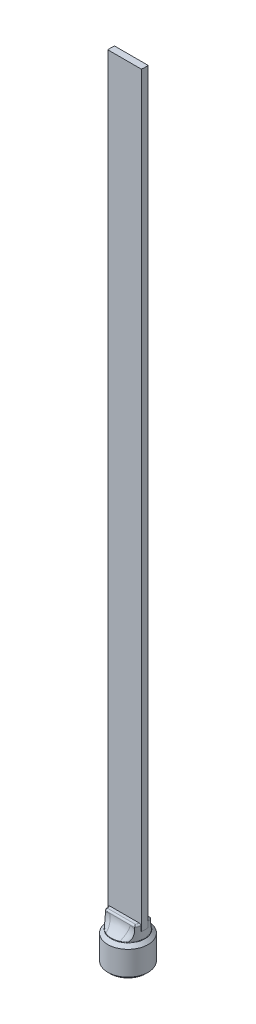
ISO-10303-21;
HEADER;
FILE_DESCRIPTION(('STEP AP214'),'2;1');
FILE_NAME('part.step','',(''),(''),'','','');
FILE_SCHEMA(('AUTOMOTIVE_DESIGN { 1 0 10303 214 1 1 1 1 }'));
ENDSEC;
DATA;
#1=APPLICATION_CONTEXT('core data for automotive mechanical design processes');
#2=APPLICATION_PROTOCOL_DEFINITION('international standard','automotive_design',2000,#1);
#3=PRODUCT_CONTEXT('',#1,'mechanical');
#4=PRODUCT('Part','Part','',(#3));
#5=PRODUCT_RELATED_PRODUCT_CATEGORY('part','',(#4));
#6=PRODUCT_DEFINITION_FORMATION('','',#4);
#7=PRODUCT_DEFINITION_CONTEXT('part definition',#1,'design');
#8=PRODUCT_DEFINITION('design','',#6,#7);
#9=PRODUCT_DEFINITION_SHAPE('','',#8);
#10=(LENGTH_UNIT() NAMED_UNIT(*) SI_UNIT(.MILLI.,.METRE.));
#11=(NAMED_UNIT(*) PLANE_ANGLE_UNIT() SI_UNIT($,.RADIAN.));
#12=(NAMED_UNIT(*) SI_UNIT($,.STERADIAN.) SOLID_ANGLE_UNIT());
#13=UNCERTAINTY_MEASURE_WITH_UNIT(LENGTH_MEASURE(1.E-05),#10,'distance_accuracy_value','');
#14=(GEOMETRIC_REPRESENTATION_CONTEXT(3) GLOBAL_UNCERTAINTY_ASSIGNED_CONTEXT((#13)) GLOBAL_UNIT_ASSIGNED_CONTEXT((#10,
#11,#12)) REPRESENTATION_CONTEXT('',''));
#15=CARTESIAN_POINT('',(0.,0.,0.));
#16=DIRECTION('',(0.,0.,1.));
#17=DIRECTION('',(1.,0.,0.));
#18=AXIS2_PLACEMENT_3D('',#15,#16,#17);
#19=CARTESIAN_POINT('',(0.,8.3312,0.));
#20=DIRECTION('',(0.,-1.,0.));
#21=DIRECTION('',(0.,0.,-1.));
#22=AXIS2_PLACEMENT_3D('',#19,#20,#21);
#23=PLANE('',#22);
#24=DIRECTION('',(-0.866025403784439,0.,0.5));
#25=VECTOR('',#24,1.);
#26=CARTESIAN_POINT('',(0.,8.3312,-3.66617420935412));
#27=LINE('',#26,#25);
#28=CARTESIAN_POINT('',(-3.175,8.3312,-1.83308710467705));
#29=VERTEX_POINT('',#28);
#30=CARTESIAN_POINT('',(0.,8.3312,-3.66617420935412));
#31=VERTEX_POINT('',#30);
#32=EDGE_CURVE('E855',#29,#31,#27,.F.);
#33=ORIENTED_EDGE('',*,*,#32,.T.);
#34=DIRECTION('',(-0.866025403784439,0.,-0.5));
#35=VECTOR('',#34,1.);
#36=CARTESIAN_POINT('',(3.175,8.3312,-1.83308710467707));
#37=LINE('',#36,#35);
#38=CARTESIAN_POINT('',(3.175,8.3312,-1.83308710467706));
#39=VERTEX_POINT('',#38);
#40=EDGE_CURVE('E850',#31,#39,#37,.F.);
#41=ORIENTED_EDGE('',*,*,#40,.T.);
#42=DIRECTION('',(0.,0.,-1.));
#43=VECTOR('',#42,1.);
#44=CARTESIAN_POINT('',(3.175,8.3312,1.83308710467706));
#45=LINE('',#44,#43);
#46=CARTESIAN_POINT('',(3.175,8.3312,1.83308710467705));
#47=VERTEX_POINT('',#46);
#48=EDGE_CURVE('E841',#39,#47,#45,.F.);
#49=ORIENTED_EDGE('',*,*,#48,.T.);
#50=DIRECTION('',(0.866025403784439,0.,-0.5));
#51=VECTOR('',#50,1.);
#52=CARTESIAN_POINT('',(0.,8.3312,3.66617420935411));
#53=LINE('',#52,#51);
#54=CARTESIAN_POINT('',(0.,8.3312,3.66617420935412));
#55=VERTEX_POINT('',#54);
#56=EDGE_CURVE('E827',#47,#55,#53,.F.);
#57=ORIENTED_EDGE('',*,*,#56,.T.);
#58=DIRECTION('',(0.866025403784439,0.,0.5));
#59=VECTOR('',#58,1.);
#60=CARTESIAN_POINT('',(-3.175,8.3312,1.83308710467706));
#61=LINE('',#60,#59);
#62=CARTESIAN_POINT('',(-3.175,8.3312,1.83308710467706));
#63=VERTEX_POINT('',#62);
#64=EDGE_CURVE('E169',#55,#63,#61,.F.);
#65=ORIENTED_EDGE('',*,*,#64,.T.);
#66=DIRECTION('',(0.,0.,1.));
#67=VECTOR('',#66,1.);
#68=CARTESIAN_POINT('',(-3.175,8.3312,-1.83308710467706));
#69=LINE('',#68,#67);
#70=EDGE_CURVE('E858',#63,#29,#69,.F.);
#71=ORIENTED_EDGE('',*,*,#70,.T.);
#72=EDGE_LOOP('',(#33,#41,#49,#57,#65,#71));
#73=FACE_BOUND('',#72,.T.);
#74=ADVANCED_FACE('F35',(#73),#23,.T.);
#75=CARTESIAN_POINT('',(-3.175,0.,1.83308710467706));
#76=DIRECTION('',(-0.5,0.,0.866025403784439));
#77=DIRECTION('',(0.866025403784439,0.,0.5));
#78=AXIS2_PLACEMENT_3D('',#75,#76,#77);
#79=PLANE('',#78);
#80=DIRECTION('',(0.,1.,0.));
#81=VECTOR('',#80,1.);
#82=CARTESIAN_POINT('',(-3.175,0.,1.83308710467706));
#83=LINE('',#82,#81);
#84=CARTESIAN_POINT('',(-3.17499993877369,0.118425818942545,1.83308715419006));
#85=VERTEX_POINT('',#84);
#86=EDGE_CURVE('E790',#85,#63,#83,.T.);
#87=ORIENTED_EDGE('',*,*,#86,.T.);
#88=ORIENTED_EDGE('',*,*,#64,.F.);
#89=DIRECTION('',(0.,1.,0.));
#90=VECTOR('',#89,1.);
#91=CARTESIAN_POINT('',(0.,0.,3.66617420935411));
#92=LINE('',#91,#90);
#93=CARTESIAN_POINT('',(7.34857979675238E-08,0.118425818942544,3.66617418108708));
#94=VERTEX_POINT('',#93);
#95=EDGE_CURVE('E825',#55,#94,#92,.F.);
#96=ORIENTED_EDGE('',*,*,#95,.T.);
#97=CARTESIAN_POINT('',(0.,0.118425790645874,3.66617420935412));
#98=CARTESIAN_POINT('',(-0.441441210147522,0.373291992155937,3.41130800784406));
#99=CARTESIAN_POINT('',(-0.837272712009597,0.493539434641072,3.18277458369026));
#100=CARTESIAN_POINT('',(-1.21954352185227,0.60966735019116,2.96207042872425));
#101=CARTESIAN_POINT('',(-1.5875,0.609599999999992,2.7496306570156));
#102=CARTESIAN_POINT('',(-1.95630488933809,0.609532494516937,2.5367010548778));
#103=CARTESIAN_POINT('',(-2.3377272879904,0.493539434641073,2.31648673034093));
#104=CARTESIAN_POINT('',(-2.73402548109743,0.373022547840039,2.08768386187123));
#105=CARTESIAN_POINT('',(-3.175,0.118425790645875,1.83308710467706));
#106=B_SPLINE_CURVE_WITH_KNOTS('',2,(#97,#98,#99,#100,#101,#102,#103,#104,#105),.UNSPECIFIED.,
.F.,.F.,(3,2,2,2,3),(0.,0.25,0.5,0.75,1.),.UNSPECIFIED.);
#107=EDGE_CURVE('E820',#94,#85,#106,.T.);
#108=ORIENTED_EDGE('',*,*,#107,.T.);
#109=EDGE_LOOP('',(#87,#88,#96,#108));
#110=FACE_BOUND('',#109,.T.);
#111=ADVANCED_FACE('F802',(#110),#79,.F.);
#112=CARTESIAN_POINT('',(-3.175,0.,-1.83308710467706));
#113=DIRECTION('',(-1.,0.,0.));
#114=DIRECTION('',(0.,0.,1.));
#115=AXIS2_PLACEMENT_3D('',#112,#113,#114);
#116=PLANE('',#115);
#117=DIRECTION('',(0.,1.,0.));
#118=VECTOR('',#117,1.);
#119=CARTESIAN_POINT('',(-3.175,0.,-1.83308710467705));
#120=LINE('',#119,#118);
#121=CARTESIAN_POINT('',(-3.17500001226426,0.118425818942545,-1.83308702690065));
#122=VERTEX_POINT('',#121);
#123=EDGE_CURVE('E857',#122,#29,#120,.T.);
#124=ORIENTED_EDGE('',*,*,#123,.T.);
#125=ORIENTED_EDGE('',*,*,#70,.F.);
#126=ORIENTED_EDGE('',*,*,#86,.F.);
#127=CARTESIAN_POINT('',(-3.175,0.118425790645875,1.83308710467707));
#128=CARTESIAN_POINT('',(-3.175,0.373291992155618,1.32335470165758));
#129=CARTESIAN_POINT('',(-3.175,0.493539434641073,0.86628785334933));
#130=CARTESIAN_POINT('',(-3.175,0.609667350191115,0.424879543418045));
#131=CARTESIAN_POINT('',(-3.175,0.609599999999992,0.));
#132=CARTESIAN_POINT('',(-3.175,0.609532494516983,-0.42585920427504));
#133=CARTESIAN_POINT('',(-3.175,0.493539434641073,-0.866287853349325));
#134=CARTESIAN_POINT('',(-3.175,0.373022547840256,-1.32389359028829));
#135=CARTESIAN_POINT('',(-3.175,0.118425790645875,-1.83308710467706));
#136=B_SPLINE_CURVE_WITH_KNOTS('',2,(#127,#128,#129,#130,#131,#132,#133,#134,#135),
.UNSPECIFIED.,.F.,.F.,(3,2,2,2,3),(0.,0.25,0.5,0.75,1.),.UNSPECIFIED.);
#137=EDGE_CURVE('E784',#85,#122,#136,.T.);
#138=ORIENTED_EDGE('',*,*,#137,.T.);
#139=EDGE_LOOP('',(#124,#125,#126,#138));
#140=FACE_BOUND('',#139,.T.);
#141=ADVANCED_FACE('F792',(#140),#116,.F.);
#142=CARTESIAN_POINT('',(0.,0.,-3.66617420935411));
#143=DIRECTION('',(-0.5,0.,-0.866025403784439));
#144=DIRECTION('',(-0.866025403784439,0.,0.5));
#145=AXIS2_PLACEMENT_3D('',#142,#143,#144);
#146=PLANE('',#145);
#147=DIRECTION('',(0.,1.,0.));
#148=VECTOR('',#147,1.);
#149=CARTESIAN_POINT('',(0.,0.,-3.66617420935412));
#150=LINE('',#149,#148);
#151=CARTESIAN_POINT('',(0.,0.118425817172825,-3.66617418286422));
#152=VERTEX_POINT('',#151);
#153=EDGE_CURVE('E854',#152,#31,#150,.T.);
#154=ORIENTED_EDGE('',*,*,#153,.T.);
#155=ORIENTED_EDGE('',*,*,#32,.F.);
#156=ORIENTED_EDGE('',*,*,#123,.F.);
#157=CARTESIAN_POINT('',(-3.175,0.118425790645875,-1.83308710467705));
#158=CARTESIAN_POINT('',(-2.73355878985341,0.373291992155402,-2.08795330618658));
#159=CARTESIAN_POINT('',(-2.3377272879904,0.493539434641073,-2.31648673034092));
#160=CARTESIAN_POINT('',(-1.95545647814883,0.609667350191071,-2.53719088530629));
#161=CARTESIAN_POINT('',(-1.5875,0.609599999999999,-2.74963065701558));
#162=CARTESIAN_POINT('',(-1.21869511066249,0.60953249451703,-2.96256025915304));
#163=CARTESIAN_POINT('',(-0.837272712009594,0.493539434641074,-3.18277458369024));
#164=CARTESIAN_POINT('',(-0.440974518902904,0.373022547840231,-3.41157745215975));
#165=CARTESIAN_POINT('',(0.,0.118425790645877,-3.66617420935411));
#166=B_SPLINE_CURVE_WITH_KNOTS('',2,(#157,#158,#159,#160,#161,#162,#163,#164,#165),
.UNSPECIFIED.,.F.,.F.,(3,2,2,2,3),(0.,0.25,0.5,0.75,1.),.UNSPECIFIED.);
#167=EDGE_CURVE('E826',#122,#152,#166,.T.);
#168=ORIENTED_EDGE('',*,*,#167,.T.);
#169=EDGE_LOOP('',(#154,#155,#156,#168));
#170=FACE_BOUND('',#169,.T.);
#171=ADVANCED_FACE('F801',(#170),#146,.F.);
#172=CARTESIAN_POINT('',(3.175,0.,-1.83308710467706));
#173=DIRECTION('',(0.5,0.,-0.866025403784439));
#174=DIRECTION('',(-0.866025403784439,0.,-0.5));
#175=AXIS2_PLACEMENT_3D('',#172,#173,#174);
#176=PLANE('',#175);
#177=DIRECTION('',(0.,1.,0.));
#178=VECTOR('',#177,1.);
#179=CARTESIAN_POINT('',(3.175,0.,-1.83308710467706));
#180=LINE('',#179,#178);
#181=CARTESIAN_POINT('',(3.17500001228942,0.118425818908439,-1.8330870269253));
#182=VERTEX_POINT('',#181);
#183=EDGE_CURVE('E847',#182,#39,#180,.T.);
#184=ORIENTED_EDGE('',*,*,#183,.T.);
#185=ORIENTED_EDGE('',*,*,#40,.F.);
#186=ORIENTED_EDGE('',*,*,#153,.F.);
#187=CARTESIAN_POINT('',(0.,0.118425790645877,-3.66617420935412));
#188=CARTESIAN_POINT('',(0.44144121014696,0.373291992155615,-3.41130800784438));
#189=CARTESIAN_POINT('',(0.837272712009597,0.493539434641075,-3.18277458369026));
#190=CARTESIAN_POINT('',(1.21954352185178,0.609667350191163,-2.96207042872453));
#191=CARTESIAN_POINT('',(1.5875,0.6096,-2.7496306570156));
#192=CARTESIAN_POINT('',(1.95630488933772,0.609532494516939,-2.53670105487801));
#193=CARTESIAN_POINT('',(2.3377272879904,0.493539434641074,-2.31648673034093));
#194=CARTESIAN_POINT('',(2.734025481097,0.373022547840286,-2.08768386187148));
#195=CARTESIAN_POINT('',(3.175,0.118425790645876,-1.83308710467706));
#196=B_SPLINE_CURVE_WITH_KNOTS('',2,(#187,#188,#189,#190,#191,#192,#193,#194,#195),
.UNSPECIFIED.,.F.,.F.,(3,2,2,2,3),(0.,0.25,0.5,0.75,1.),.UNSPECIFIED.);
#197=EDGE_CURVE('E925',#152,#182,#196,.T.);
#198=ORIENTED_EDGE('',*,*,#197,.T.);
#199=EDGE_LOOP('',(#184,#185,#186,#198));
#200=FACE_BOUND('',#199,.T.);
#201=ADVANCED_FACE('F935',(#200),#176,.F.);
#202=CARTESIAN_POINT('',(3.175,0.,1.83308710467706));
#203=DIRECTION('',(1.,0.,0.));
#204=DIRECTION('',(0.,0.,-1.));
#205=AXIS2_PLACEMENT_3D('',#202,#203,#204);
#206=PLANE('',#205);
#207=DIRECTION('',(0.,1.,0.));
#208=VECTOR('',#207,1.);
#209=CARTESIAN_POINT('',(3.175,0.,1.83308710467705));
#210=LINE('',#209,#208);
#211=CARTESIAN_POINT('',(3.1750000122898,0.118425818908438,1.83308702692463));
#212=VERTEX_POINT('',#211);
#213=EDGE_CURVE('E830',#212,#47,#210,.T.);
#214=ORIENTED_EDGE('',*,*,#213,.T.);
#215=ORIENTED_EDGE('',*,*,#48,.F.);
#216=ORIENTED_EDGE('',*,*,#183,.F.);
#217=CARTESIAN_POINT('',(3.175,0.118425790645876,-1.83308710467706));
#218=CARTESIAN_POINT('',(3.175,0.373291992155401,-1.32335470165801));
#219=CARTESIAN_POINT('',(3.175,0.493539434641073,-0.86628785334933));
#220=CARTESIAN_POINT('',(3.175,0.609667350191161,-0.42487954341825));
#221=CARTESIAN_POINT('',(3.175,0.609599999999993,0.));
#222=CARTESIAN_POINT('',(3.175,0.609532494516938,0.425859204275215));
#223=CARTESIAN_POINT('',(3.175,0.493539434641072,0.866287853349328));
#224=CARTESIAN_POINT('',(3.175,0.373022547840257,1.32389359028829));
#225=CARTESIAN_POINT('',(3.175,0.118425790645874,1.83308710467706));
#226=B_SPLINE_CURVE_WITH_KNOTS('',2,(#217,#218,#219,#220,#221,#222,#223,#224,#225),
.UNSPECIFIED.,.F.,.F.,(3,2,2,2,3),(0.,0.25,0.5,0.75,1.),.UNSPECIFIED.);
#227=EDGE_CURVE('E923',#182,#212,#226,.T.);
#228=ORIENTED_EDGE('',*,*,#227,.T.);
#229=EDGE_LOOP('',(#214,#215,#216,#228));
#230=FACE_BOUND('',#229,.T.);
#231=ADVANCED_FACE('F949',(#230),#206,.F.);
#232=CARTESIAN_POINT('',(0.,0.,3.66617420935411));
#233=DIRECTION('',(0.5,0.,0.866025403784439));
#234=DIRECTION('',(0.866025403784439,0.,-0.5));
#235=AXIS2_PLACEMENT_3D('',#232,#233,#234);
#236=PLANE('',#235);
#237=ORIENTED_EDGE('',*,*,#95,.F.);
#238=ORIENTED_EDGE('',*,*,#56,.F.);
#239=ORIENTED_EDGE('',*,*,#213,.F.);
#240=CARTESIAN_POINT('',(3.17499999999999,0.118425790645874,1.83308710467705));
#241=CARTESIAN_POINT('',(2.73355878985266,0.37329199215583,2.08795330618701));
#242=CARTESIAN_POINT('',(2.3377272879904,0.493539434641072,2.31648673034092));
#243=CARTESIAN_POINT('',(1.95545647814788,0.60966735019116,2.53719088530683));
#244=CARTESIAN_POINT('',(1.5875,0.609599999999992,2.74963065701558));
#245=CARTESIAN_POINT('',(1.21869511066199,0.609532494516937,2.96256025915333));
#246=CARTESIAN_POINT('',(0.837272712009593,0.493539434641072,3.18277458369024));
#247=CARTESIAN_POINT('',(0.440974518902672,0.373022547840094,3.41157745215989));
#248=CARTESIAN_POINT('',(0.,0.118425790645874,3.66617420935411));
#249=B_SPLINE_CURVE_WITH_KNOTS('',2,(#240,#241,#242,#243,#244,#245,#246,#247,#248),
.UNSPECIFIED.,.F.,.F.,(3,2,2,2,3),(0.,0.25,0.5,0.75,1.),.UNSPECIFIED.);
#250=EDGE_CURVE('E823',#212,#94,#249,.T.);
#251=ORIENTED_EDGE('',*,*,#250,.T.);
#252=EDGE_LOOP('',(#237,#238,#239,#251));
#253=FACE_BOUND('',#252,.T.);
#254=ADVANCED_FACE('F737',(#253),#236,.F.);
#255=CARTESIAN_POINT('',(0.,5.6843418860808E-11,0.));
#256=DIRECTION('',(0.,-1.,0.));
#257=DIRECTION('',(0.,0.,-1.));
#258=AXIS2_PLACEMENT_3D('',#255,#256,#257);
#259=CONICAL_SURFACE('',#258,3.78460000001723,0.785398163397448);
#260=CARTESIAN_POINT('',(0.,5.6844286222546E-11,0.));
#261=DIRECTION('',(0.,-1.,0.));
#262=DIRECTION('',(0.,0.,-1.));
#263=AXIS2_PLACEMENT_3D('',#260,#261,#262);
#264=CIRCLE('',#263,3.78460000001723);
#265=CARTESIAN_POINT('',(0.,5.6844286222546E-11,-3.78460000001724));
#266=VERTEX_POINT('',#265);
#267=EDGE_CURVE('E919',#266,#266,#264,.F.);
#268=ORIENTED_EDGE('',*,*,#267,.F.);
#269=EDGE_LOOP('',(#268));
#270=FACE_BOUND('',#269,.T.);
#271=ORIENTED_EDGE('',*,*,#227,.F.);
#272=ORIENTED_EDGE('',*,*,#197,.F.);
#273=ORIENTED_EDGE('',*,*,#167,.F.);
#274=ORIENTED_EDGE('',*,*,#137,.F.);
#275=ORIENTED_EDGE('',*,*,#107,.F.);
#276=ORIENTED_EDGE('',*,*,#250,.F.);
#277=EDGE_LOOP('',(#271,#272,#273,#274,#275,#276));
#278=FACE_BOUND('',#277,.T.);
#279=ADVANCED_FACE('F732',(#270,#278),#259,.F.);
#280=CARTESIAN_POINT('',(0.,0.,-3.1496));
#281=DIRECTION('',(0.,-1.,0.));
#282=DIRECTION('',(0.,0.,-1.));
#283=AXIS2_PLACEMENT_3D('',#280,#281,#282);
#284=PLANE('',#283);
#285=ORIENTED_EDGE('',*,*,#267,.T.);
#286=EDGE_LOOP('',(#285));
#287=FACE_BOUND('',#286,.T.);
#288=CARTESIAN_POINT('',(0.,5.68426599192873E-11,0.));
#289=DIRECTION('',(0.,1.,0.));
#290=DIRECTION('',(0.,0.,1.));
#291=AXIS2_PLACEMENT_3D('',#288,#289,#290);
#292=CIRCLE('',#291,5.71500000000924);
#293=CARTESIAN_POINT('',(0.,5.68426599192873E-11,5.71500000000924));
#294=VERTEX_POINT('',#293);
#295=EDGE_CURVE('E910',#294,#294,#292,.T.);
#296=ORIENTED_EDGE('',*,*,#295,.F.);
#297=EDGE_LOOP('',(#296));
#298=FACE_BOUND('',#297,.T.);
#299=ADVANCED_FACE('F728',(#287,#298),#284,.T.);
#300=CARTESIAN_POINT('',(0.,0.801000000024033,0.));
#301=DIRECTION('',(0.,1.,0.));
#302=DIRECTION('',(0.,0.,1.));
#303=AXIS2_PLACEMENT_3D('',#300,#301,#302);
#304=CONICAL_SURFACE('',#303,6.51599999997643,0.785398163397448);
#305=CARTESIAN_POINT('',(0.,0.801,0.));
#306=DIRECTION('',(0.,-1.,0.));
#307=DIRECTION('',(0.,0.,-1.));
#308=AXIS2_PLACEMENT_3D('',#305,#306,#307);
#309=CIRCLE('',#308,6.516);
#310=CARTESIAN_POINT('',(0.,0.801,-6.516));
#311=VERTEX_POINT('',#310);
#312=EDGE_CURVE('E918',#311,#311,#309,.F.);
#313=ORIENTED_EDGE('',*,*,#312,.F.);
#314=EDGE_LOOP('',(#313));
#315=FACE_BOUND('',#314,.T.);
#316=ORIENTED_EDGE('',*,*,#295,.T.);
#317=EDGE_LOOP('',(#316));
#318=FACE_BOUND('',#317,.T.);
#319=ADVANCED_FACE('F724',(#315,#318),#304,.T.);
#320=CARTESIAN_POINT('',(0.,4.826,0.));
#321=DIRECTION('',(0.,-1.,0.));
#322=DIRECTION('',(0.,0.,-1.));
#323=AXIS2_PLACEMENT_3D('',#320,#321,#322);
#324=CYLINDRICAL_SURFACE('',#323,6.516);
#325=CARTESIAN_POINT('',(0.,8.596999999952,0.));
#326=DIRECTION('',(0.,-1.,0.));
#327=DIRECTION('',(0.,0.,1.));
#328=AXIS2_PLACEMENT_3D('',#325,#326,#327);
#329=CIRCLE('',#328,6.51599999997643);
#330=CARTESIAN_POINT('',(0.,8.596999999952,6.51599999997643));
#331=VERTEX_POINT('',#330);
#332=EDGE_CURVE('E1260',#331,#331,#329,.F.);
#333=ORIENTED_EDGE('',*,*,#332,.F.);
#334=EDGE_LOOP('',(#333));
#335=FACE_BOUND('',#334,.T.);
#336=ORIENTED_EDGE('',*,*,#312,.T.);
#337=EDGE_LOOP('',(#336));
#338=FACE_BOUND('',#337,.T.);
#339=ADVANCED_FACE('F720',(#335,#338),#324,.T.);
#340=CARTESIAN_POINT('',(0.,8.59700000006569,0.));
#341=DIRECTION('',(0.,-1.,0.));
#342=DIRECTION('',(0.,0.,-1.));
#343=AXIS2_PLACEMENT_3D('',#340,#341,#342);
#344=CONICAL_SURFACE('',#343,6.51599999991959,0.785398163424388);
#345=CARTESIAN_POINT('',(0.,9.652,0.));
#346=DIRECTION('',(0.,-1.,0.));
#347=DIRECTION('',(-1.,0.,-1.12769188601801E-10));
#348=AXIS2_PLACEMENT_3D('',#345,#346,#347);
#349=CIRCLE('',#348,5.461);
#350=CARTESIAN_POINT('',(-5.461,9.652,-6.15833416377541E-10));
#351=VERTEX_POINT('',#350);
#352=EDGE_CURVE('E1117',#351,#351,#349,.T.);
#353=ORIENTED_EDGE('',*,*,#352,.T.);
#354=EDGE_LOOP('',(#353));
#355=FACE_BOUND('',#354,.T.);
#356=ORIENTED_EDGE('',*,*,#332,.T.);
#357=EDGE_LOOP('',(#356));
#358=FACE_BOUND('',#357,.T.);
#359=ADVANCED_FACE('F715',(#355,#358),#344,.T.);
#360=CARTESIAN_POINT('',(0.,9.8298,2.5781));
#361=DIRECTION('',(0.,0.,-1.));
#362=DIRECTION('',(-1.,0.,0.));
#363=AXIS2_PLACEMENT_3D('',#360,#361,#362);
#364=PLANE('',#363);
#365=DIRECTION('',(1.,0.,0.));
#366=VECTOR('',#365,1.);
#367=CARTESIAN_POINT('',(0.,13.7668,2.5781));
#368=LINE('',#367,#366);
#369=CARTESIAN_POINT('',(-4.75643400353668,13.7668,2.5781));
#370=VERTEX_POINT('',#369);
#371=CARTESIAN_POINT('',(-3.3741041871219,13.7667999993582,2.5781));
#372=VERTEX_POINT('',#371);
#373=EDGE_CURVE('E1120',#370,#372,#368,.T.);
#374=ORIENTED_EDGE('',*,*,#373,.F.);
#375=DIRECTION('',(0.,1.,0.));
#376=VECTOR('',#375,1.);
#377=CARTESIAN_POINT('',(-4.75643400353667,9.8298,2.5781));
#378=LINE('',#377,#376);
#379=CARTESIAN_POINT('',(-4.75643400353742,13.2206846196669,2.5781000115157));
#380=VERTEX_POINT('',#379);
#381=EDGE_CURVE('E702',#380,#370,#378,.T.);
#382=ORIENTED_EDGE('',*,*,#381,.F.);
#383=CARTESIAN_POINT('',(-3.37410418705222,13.7667999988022,2.5781));
#384=CARTESIAN_POINT('',(-3.4338096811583,13.7499335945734,2.57810000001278));
#385=CARTESIAN_POINT('',(-3.49333317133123,13.732415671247,2.57810000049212));
#386=CARTESIAN_POINT('',(-3.61196474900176,13.6960104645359,2.57810000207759));
#387=CARTESIAN_POINT('',(-3.67107280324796,13.677123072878,2.57810000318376));
#388=CARTESIAN_POINT('',(-3.78880849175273,13.6379166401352,2.57810000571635));
#389=CARTESIAN_POINT('',(-3.84743615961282,13.6175977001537,2.57810000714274));
#390=CARTESIAN_POINT('',(-3.96414460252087,13.5754661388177,2.57810001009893));
#391=CARTESIAN_POINT('',(-4.02222544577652,13.5536537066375,2.57810001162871));
#392=CARTESIAN_POINT('',(-4.13777422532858,13.5084731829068,2.57810001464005));
#393=CARTESIAN_POINT('',(-4.19524221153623,13.4851052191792,2.57810001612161));
#394=CARTESIAN_POINT('',(-4.30949912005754,13.4367519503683,2.57810001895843));
#395=CARTESIAN_POINT('',(-4.36628799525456,13.4117665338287,2.57810002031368));
#396=CARTESIAN_POINT('',(-4.47912100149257,13.3601163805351,2.57810002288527));
#397=CARTESIAN_POINT('',(-4.53516487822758,13.3334510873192,2.57810002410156));
#398=CARTESIAN_POINT('',(-4.6464409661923,13.2783812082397,2.57810002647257));
#399=CARTESIAN_POINT('',(-4.70167256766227,13.2499753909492,2.57810002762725));
#400=CARTESIAN_POINT('',(-4.75643400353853,13.220684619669,2.57810002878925));
#401=B_SPLINE_CURVE_WITH_KNOTS('',3,(#383,#384,#385,#386,#387,#388,#389,#390,#391,#392,#393,
#394,#395,#396,#397,#398,#399,#400),.UNSPECIFIED.,.F.,.F.,(4,2,2,2,2,2,2,2,4),(0.,
0.186125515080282,0.372265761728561,0.558392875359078,0.744496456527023,0.930584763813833,
1.11668590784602,1.3028490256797,1.4891454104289),.UNSPECIFIED.);
#402=EDGE_CURVE('E696',#372,#380,#401,.T.);
#403=ORIENTED_EDGE('',*,*,#402,.F.);
#404=EDGE_LOOP('',(#374,#382,#403));
#405=FACE_BOUND('',#404,.T.);
#406=ADVANCED_FACE('F704',(#405),#364,.F.);
#407=CARTESIAN_POINT('',(0.,9.8298,2.5781));
#408=DIRECTION('',(0.,0.,-1.));
#409=DIRECTION('',(-1.,0.,0.));
#410=AXIS2_PLACEMENT_3D('',#407,#408,#409);
#411=PLANE('',#410);
#412=DIRECTION('',(0.,1.,0.));
#413=VECTOR('',#412,1.);
#414=CARTESIAN_POINT('',(4.75643400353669,9.8298,2.5781));
#415=LINE('',#414,#413);
#416=CARTESIAN_POINT('',(4.75643400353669,13.7668,2.5781));
#417=VERTEX_POINT('',#416);
#418=CARTESIAN_POINT('',(4.75643402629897,13.2206845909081,2.57809999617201));
#419=VERTEX_POINT('',#418);
#420=EDGE_CURVE('E1177',#417,#419,#415,.F.);
#421=ORIENTED_EDGE('',*,*,#420,.F.);
#422=DIRECTION('',(1.,0.,0.));
#423=VECTOR('',#422,1.);
#424=CARTESIAN_POINT('',(0.,13.7668,2.5781));
#425=LINE('',#424,#423);
#426=CARTESIAN_POINT('',(3.3741041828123,13.7667999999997,2.5781));
#427=VERTEX_POINT('',#426);
#428=EDGE_CURVE('E1123',#427,#417,#425,.T.);
#429=ORIENTED_EDGE('',*,*,#428,.F.);
#430=CARTESIAN_POINT('',(4.75643403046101,13.220684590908,2.57809999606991));
#431=CARTESIAN_POINT('',(4.70162134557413,13.2499347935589,2.57809999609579));
#432=CARTESIAN_POINT('',(4.6463424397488,13.2783050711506,2.57809999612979));
#433=CARTESIAN_POINT('',(4.53491638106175,13.3333505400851,2.57809999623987));
#434=CARTESIAN_POINT('',(4.47876885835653,13.3600249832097,2.57809999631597));
#435=CARTESIAN_POINT('',(4.36570800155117,13.4117225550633,2.57809999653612));
#436=CARTESIAN_POINT('',(4.30879453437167,13.4367453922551,2.57809999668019));
#437=CARTESIAN_POINT('',(4.19430202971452,13.485183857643,2.57809999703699));
#438=CARTESIAN_POINT('',(4.13672312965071,13.5085998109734,2.57809999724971));
#439=CARTESIAN_POINT('',(4.02100057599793,13.5538683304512,2.57809999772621));
#440=CARTESIAN_POINT('',(3.96285733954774,13.5757219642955,2.57809999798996));
#441=CARTESIAN_POINT('',(3.84610667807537,13.6179095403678,2.57809999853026));
#442=CARTESIAN_POINT('',(3.78749994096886,13.6382453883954,2.57809999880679));
#443=CARTESIAN_POINT('',(3.66992326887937,13.6774411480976,2.57809999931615));
#444=CARTESIAN_POINT('',(3.61095427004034,13.696303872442,2.57809999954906));
#445=CARTESIAN_POINT('',(3.49275271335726,13.7325964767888,2.57809999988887));
#446=CARTESIAN_POINT('',(3.43352131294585,13.7500301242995,2.57809999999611));
#447=CARTESIAN_POINT('',(3.3741041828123,13.766799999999,2.5781));
#448=B_SPLINE_CURVE_WITH_KNOTS('',3,(#430,#431,#432,#433,#434,#435,#436,#437,#438,#439,#440,
#441,#442,#443,#444,#445,#446,#447),.UNSPECIFIED.,.F.,.F.,(4,2,2,2,2,2,2,2,4),(0.,
0.186374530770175,0.372830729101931,0.55931975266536,0.745770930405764,0.932093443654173,
1.11817792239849,1.30389794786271,1.48911145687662),.UNSPECIFIED.);
#449=EDGE_CURVE('E689',#419,#427,#448,.T.);
#450=ORIENTED_EDGE('',*,*,#449,.F.);
#451=EDGE_LOOP('',(#421,#429,#450));
#452=FACE_BOUND('',#451,.T.);
#453=ADVANCED_FACE('F714',(#452),#411,.F.);
#454=CARTESIAN_POINT('',(0.,13.7668,2.0701));
#455=DIRECTION('',(1.,0.,0.));
#456=DIRECTION('',(0.,0.,-1.));
#457=AXIS2_PLACEMENT_3D('',#454,#455,#456);
#458=CYLINDRICAL_SURFACE('',#457,0.508);
#459=CARTESIAN_POINT('',(-4.75643400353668,13.7668,2.5781));
#460=CARTESIAN_POINT('',(-4.75643428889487,13.7752472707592,2.57810039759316));
#461=CARTESIAN_POINT('',(-4.75631085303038,13.783694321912,2.57788509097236));
#462=CARTESIAN_POINT('',(-4.75581565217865,13.8006043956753,2.57702671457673));
#463=CARTESIAN_POINT('',(-4.75544257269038,13.8090672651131,2.57638138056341));
#464=CARTESIAN_POINT('',(-4.75444411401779,13.8259873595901,2.57466139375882));
#465=CARTESIAN_POINT('',(-4.75381718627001,13.8344442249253,2.57358410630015));
#466=CARTESIAN_POINT('',(-4.75230816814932,13.8513304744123,2.57100002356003));
#467=CARTESIAN_POINT('',(-4.75142431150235,13.8597592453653,2.56949025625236));
#468=CARTESIAN_POINT('',(-4.74939917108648,13.8765670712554,2.5660416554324));
#469=CARTESIAN_POINT('',(-4.74825592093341,13.8849452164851,2.56409954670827));
#470=CARTESIAN_POINT('',(-4.74571050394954,13.9016292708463,2.55978755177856));
#471=CARTESIAN_POINT('',(-4.74430619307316,13.909933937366,2.55741412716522));
#472=CARTESIAN_POINT('',(-4.74123793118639,13.9264482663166,2.55224159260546));
#473=CARTESIAN_POINT('',(-4.73957168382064,13.9346563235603,2.54943872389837));
#474=CARTESIAN_POINT('',(-4.73597963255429,13.9509544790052,2.54341022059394));
#475=CARTESIAN_POINT('',(-4.73405140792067,13.9590425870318,2.54018065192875));
#476=CARTESIAN_POINT('',(-4.7299363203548,13.9750777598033,2.53330249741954));
#477=CARTESIAN_POINT('',(-4.72774694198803,13.9830224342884,2.52964984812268));
#478=CARTESIAN_POINT('',(-4.72311132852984,13.9987475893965,2.52193011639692));
#479=CARTESIAN_POINT('',(-4.72066251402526,14.006525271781,2.51785888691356));
#480=CARTESIAN_POINT('',(-4.71551070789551,14.0218932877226,2.50930740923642));
#481=CARTESIAN_POINT('',(-4.71280510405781,14.0294804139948,2.50482297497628));
#482=CARTESIAN_POINT('',(-4.70714330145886,14.0444442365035,2.49545134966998));
#483=CARTESIAN_POINT('',(-4.70418448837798,14.0518173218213,2.49055997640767));
#484=CARTESIAN_POINT('',(-4.69802086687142,14.0663300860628,2.48038150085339));
#485=CARTESIAN_POINT('',(-4.69481347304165,14.0734657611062,2.47509025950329));
#486=CARTESIAN_POINT('',(-4.68815799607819,14.0874810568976,2.4641201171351));
#487=CARTESIAN_POINT('',(-4.68470738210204,14.0943562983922,2.4584371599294));
#488=CARTESIAN_POINT('',(-4.67757277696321,14.1078279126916,2.44669159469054));
#489=CARTESIAN_POINT('',(-4.67388634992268,14.1144195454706,2.44062503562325));
#490=CARTESIAN_POINT('',(-4.66628460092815,14.1273032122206,2.4281243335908));
#491=CARTESIAN_POINT('',(-4.66236691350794,14.1335901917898,2.42168641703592));
#492=CARTESIAN_POINT('',(-4.65543892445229,14.1441383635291,2.41028084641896));
#493=CARTESIAN_POINT('',(-4.65246456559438,14.1484934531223,2.40537780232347));
#494=CARTESIAN_POINT('',(-4.64633477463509,14.15713012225,2.39525477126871));
#495=CARTESIAN_POINT('',(-4.6431766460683,14.1614038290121,2.39002969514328));
#496=CARTESIAN_POINT('',(-4.63666982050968,14.1698554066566,2.37926469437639));
#497=CARTESIAN_POINT('',(-4.63331829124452,14.1740251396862,2.37372009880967));
#498=CARTESIAN_POINT('',(-4.62641873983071,14.1822443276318,2.36231614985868));
#499=CARTESIAN_POINT('',(-4.62286787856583,14.1862853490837,2.35645243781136));
#500=CARTESIAN_POINT('',(-4.61556407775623,14.19422178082,2.3444120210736));
#501=CARTESIAN_POINT('',(-4.61180830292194,14.1981084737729,2.33823129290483));
#502=CARTESIAN_POINT('',(-4.60409052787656,14.2057097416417,2.32555932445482));
#503=CARTESIAN_POINT('',(-4.60012573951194,14.2094153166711,2.31906438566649));
#504=CARTESIAN_POINT('',(-4.5919871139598,14.2166268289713,2.30576753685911));
#505=CARTESIAN_POINT('',(-4.58781057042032,14.220123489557,2.29896225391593));
#506=CARTESIAN_POINT('',(-4.579247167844,14.2268886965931,2.28504929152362));
#507=CARTESIAN_POINT('',(-4.57485772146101,14.2301476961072,2.27793856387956));
#508=CARTESIAN_POINT('',(-4.5658689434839,14.2364082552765,2.26342039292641));
#509=CARTESIAN_POINT('',(-4.56126718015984,14.2394000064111,2.25601022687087));
#510=CARTESIAN_POINT('',(-4.55185606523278,14.2450960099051,2.24090000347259));
#511=CARTESIAN_POINT('',(-4.54704447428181,14.2477902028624,2.23319754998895));
#512=CARTESIAN_POINT('',(-4.53721803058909,14.2528604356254,2.21751075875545));
#513=CARTESIAN_POINT('',(-4.53220116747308,14.2552261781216,2.20952435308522));
#514=CARTESIAN_POINT('',(-4.52197070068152,14.2596084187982,2.1932788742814));
#515=CARTESIAN_POINT('',(-4.51675535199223,14.2616143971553,2.18501806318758));
#516=CARTESIAN_POINT('',(-4.50613678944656,14.2652457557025,2.16823422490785));
#517=CARTESIAN_POINT('',(-4.50073213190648,14.2668604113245,2.15970979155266));
#518=CARTESIAN_POINT('',(-4.48974634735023,14.2696777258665,2.14241038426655));
#519=CARTESIAN_POINT('',(-4.48416411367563,14.2708694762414,2.13363433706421));
#520=CARTESIAN_POINT('',(-4.47283721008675,14.2728096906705,2.115844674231));
#521=CARTESIAN_POINT('',(-4.46709180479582,14.273547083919,2.10683032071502));
#522=CARTESIAN_POINT('',(-4.45545550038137,14.2745479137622,2.08857800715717));
#523=CARTESIAN_POINT('',(-4.44956427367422,14.274800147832,2.0793396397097));
#524=CARTESIAN_POINT('',(-4.44367537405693,14.2748,2.0701));
#525=B_SPLINE_CURVE_WITH_KNOTS('',3,(#459,#460,#461,#462,#463,#464,#465,#466,#467,#468,#469,
#470,#471,#472,#473,#474,#475,#476,#477,#478,#479,#480,#481,#482,#483,#484,#485,#486,#487,#488,
#489,#490,#491,#492,#493,#494,#495,#496,#497,#498,#499,#500,#501,#502,#503,#504,#505,#506,#507,
#508,#509,#510,#511,#512,#513,#514,#515,#516,#517,#518,#519,#520,#521,#522,#523,#524),
.UNSPECIFIED.,.F.,.F.,(4,2,2,2,2,2,2,2,2,2,2,2,2,2,2,2,2,2,2,2,2,2,2,2,2,2,2,2,2,2,2,2,4),(0.,
0.0253378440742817,0.0508101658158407,0.0764402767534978,0.10225092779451,0.128264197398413,
0.154501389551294,0.180982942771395,0.20772835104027,0.234756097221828,0.262083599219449,
0.289727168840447,0.317701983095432,0.34602206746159,0.374700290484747,0.403748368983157,
0.433176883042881,0.454774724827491,0.477126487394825,0.500234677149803,0.524100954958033,
0.548726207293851,0.574110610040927,0.600253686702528,0.627154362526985,0.654811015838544,
0.683221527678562,0.712383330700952,0.742293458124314,0.772948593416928,0.80434512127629,
0.836479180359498,0.869346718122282),.UNSPECIFIED.);
#526=CARTESIAN_POINT('',(-4.44367537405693,14.2748,2.0701));
#527=VERTEX_POINT('',#526);
#528=EDGE_CURVE('E1114',#370,#527,#525,.T.);
#529=ORIENTED_EDGE('',*,*,#528,.F.);
#530=ORIENTED_EDGE('',*,*,#373,.T.);
#531=CARTESIAN_POINT('',(3.3741041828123,13.7668,2.5781));
#532=CARTESIAN_POINT('',(2.43595632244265,13.7923866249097,2.5781));
#533=CARTESIAN_POINT('',(0.810418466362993,13.8106876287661,2.57611033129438));
#534=CARTESIAN_POINT('',(-1.46104404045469,13.804718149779,2.5768549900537));
#535=CARTESIAN_POINT('',(-2.74965601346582,13.7838309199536,2.57810000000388));
#536=CARTESIAN_POINT('',(-3.37410418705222,13.7667999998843,2.5781));
#537=B_SPLINE_CURVE_WITH_KNOTS('',3,(#531,#532,#533,#534,#535,#536),.UNSPECIFIED.,.F.,.F.,(4,1,
1,4),(-1.6709984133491,-1.37901580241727,-1.18436072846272,-0.989705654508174),.UNSPECIFIED.);
#538=EDGE_CURVE('E621',#427,#372,#537,.T.);
#539=ORIENTED_EDGE('',*,*,#538,.F.);
#540=ORIENTED_EDGE('',*,*,#428,.T.);
#541=CARTESIAN_POINT('',(4.44367537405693,14.2748,2.07009999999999));
#542=CARTESIAN_POINT('',(4.44956307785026,14.274800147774,2.0793377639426));
#543=CARTESIAN_POINT('',(4.45545312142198,14.2745480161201,2.08857424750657));
#544=CARTESIAN_POINT('',(4.46708724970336,14.2735475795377,2.10682303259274));
#545=CARTESIAN_POINT('',(4.47283166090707,14.2728104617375,2.11583574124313));
#546=CARTESIAN_POINT('',(4.48415677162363,14.2708709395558,2.13362236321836));
#547=CARTESIAN_POINT('',(4.48973820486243,14.2696795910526,2.14239701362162));
#548=CARTESIAN_POINT('',(4.50072258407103,14.2668631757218,2.15969388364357));
#549=CARTESIAN_POINT('',(4.50612663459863,14.2652490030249,2.16821717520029));
#550=CARTESIAN_POINT('',(4.51674417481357,14.261618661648,2.18499899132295));
#551=CARTESIAN_POINT('',(4.52195910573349,14.2596132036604,2.19325892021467));
#552=CARTESIAN_POINT('',(4.53218892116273,14.2552320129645,2.2095028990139));
#553=CARTESIAN_POINT('',(4.53720554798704,14.2528667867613,2.2174886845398));
#554=CARTESIAN_POINT('',(4.54703169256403,14.2477975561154,2.23317450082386));
#555=CARTESIAN_POINT('',(4.5518432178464,14.2451038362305,2.24087659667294));
#556=CARTESIAN_POINT('',(4.56125436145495,14.2394087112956,2.25598636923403));
#557=CARTESIAN_POINT('',(4.5658562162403,14.2364173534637,2.26339643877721));
#558=CARTESIAN_POINT('',(4.57484532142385,14.2301574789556,2.27791467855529));
#559=CARTESIAN_POINT('',(4.57923500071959,14.2268987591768,2.28502556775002));
#560=CARTESIAN_POINT('',(4.58779899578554,14.2201339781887,2.2989391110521));
#561=CARTESIAN_POINT('',(4.59197589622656,14.2166374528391,2.30574480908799));
#562=CARTESIAN_POINT('',(4.60011534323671,14.2094260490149,2.3190427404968));
#563=CARTESIAN_POINT('',(4.60408059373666,14.2057204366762,2.32553834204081));
#564=CARTESIAN_POINT('',(4.61179938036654,14.1981189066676,2.33821188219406));
#565=CARTESIAN_POINT('',(4.61555570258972,14.194231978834,2.3443935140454));
#566=CARTESIAN_POINT('',(4.62286066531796,14.1862948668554,2.35643597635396));
#567=CARTESIAN_POINT('',(4.6264121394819,14.1822533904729,2.36230082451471));
#568=CARTESIAN_POINT('',(4.6333129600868,14.1740330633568,2.37370727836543));
#569=CARTESIAN_POINT('',(4.6366651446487,14.1698626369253,2.37925323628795));
#570=CARTESIAN_POINT('',(4.64317331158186,14.1614094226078,2.39002117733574));
#571=CARTESIAN_POINT('',(4.64633212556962,14.1571347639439,2.39524782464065));
#572=CARTESIAN_POINT('',(4.65246326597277,14.1484959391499,2.40537423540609));
#573=CARTESIAN_POINT('',(4.65543829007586,14.1441396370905,2.4102790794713));
#574=CARTESIAN_POINT('',(4.6623660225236,14.1335911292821,2.42168593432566));
#575=CARTESIAN_POINT('',(4.66628283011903,14.1273051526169,2.42812342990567));
#576=CARTESIAN_POINT('',(4.67388306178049,14.1144234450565,2.4406233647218));
#577=CARTESIAN_POINT('',(4.67756884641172,14.1078327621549,2.44668957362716));
#578=CARTESIAN_POINT('',(4.68470235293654,14.0943629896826,2.45843454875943));
#579=CARTESIAN_POINT('',(4.68815250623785,14.0874886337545,2.46411726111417));
#580=CARTESIAN_POINT('',(4.69480724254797,14.0734750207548,2.47508700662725));
#581=CARTESIAN_POINT('',(4.6980143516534,14.066340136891,2.48037809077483));
#582=CARTESIAN_POINT('',(4.70417756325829,14.0518288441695,2.49055633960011));
#583=CARTESIAN_POINT('',(4.70713624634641,14.0444564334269,2.49544763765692));
#584=CARTESIAN_POINT('',(4.71279792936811,14.0294938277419,2.50481919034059));
#585=CARTESIAN_POINT('',(4.7155035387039,14.0219072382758,2.50930362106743));
#586=CARTESIAN_POINT('',(4.72065547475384,14.0065401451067,2.51785515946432));
#587=CARTESIAN_POINT('',(4.72310440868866,13.9987628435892,2.5219264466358));
#588=CARTESIAN_POINT('',(4.72774035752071,13.983038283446,2.52964635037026));
#589=CARTESIAN_POINT('',(4.72992994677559,13.9750938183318,2.53329910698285));
#590=CARTESIAN_POINT('',(4.73404552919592,13.9590588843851,2.54017752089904));
#591=CARTESIAN_POINT('',(4.73597403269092,13.9509708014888,2.54340723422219));
#592=CARTESIAN_POINT('',(4.73956669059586,13.9346725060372,2.54943605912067));
#593=CARTESIAN_POINT('',(4.74123326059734,13.9264642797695,2.55223909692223));
#594=CARTESIAN_POINT('',(4.74430219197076,13.9099494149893,2.55741198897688));
#595=CARTESIAN_POINT('',(4.74570684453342,13.9016443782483,2.55978559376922));
#596=CARTESIAN_POINT('',(4.74825294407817,13.8849593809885,2.56409795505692));
#597=CARTESIAN_POINT('',(4.7493965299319,13.876580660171,2.56604024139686));
#598=CARTESIAN_POINT('',(4.75142231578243,13.8597714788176,2.56948918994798));
#599=CARTESIAN_POINT('',(4.75230647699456,13.8513419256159,2.57099911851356));
#600=CARTESIAN_POINT('',(4.75381605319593,13.834453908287,2.57358350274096));
#601=CARTESIAN_POINT('',(4.75444322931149,13.8259960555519,2.57466092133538));
#602=CARTESIAN_POINT('',(4.75544210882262,13.8090737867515,2.57638113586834));
#603=CARTESIAN_POINT('',(4.75581535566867,13.8006097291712,2.57702655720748));
#604=CARTESIAN_POINT('',(4.75631079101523,13.7836970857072,2.57788506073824));
#605=CARTESIAN_POINT('',(4.75643428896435,13.775248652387,2.57810039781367));
#606=CARTESIAN_POINT('',(4.75643400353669,13.7668,2.57809999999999));
#607=B_SPLINE_CURVE_WITH_KNOTS('',3,(#541,#542,#543,#544,#545,#546,#547,#548,#549,#550,#551,
#552,#553,#554,#555,#556,#557,#558,#559,#560,#561,#562,#563,#564,#565,#566,#567,#568,#569,#570,
#571,#572,#573,#574,#575,#576,#577,#578,#579,#580,#581,#582,#583,#584,#585,#586,#587,#588,#589,
#590,#591,#592,#593,#594,#595,#596,#597,#598,#599,#600,#601,#602,#603,#604,#605,#606),
.UNSPECIFIED.,.F.,.F.,(4,2,2,2,2,2,2,2,2,2,2,2,2,2,2,2,2,2,2,2,2,2,2,2,2,2,2,2,2,2,2,2,4),(0.,
0.0328608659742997,0.0649891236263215,0.0963807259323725,0.127031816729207,0.15693878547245,
0.186098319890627,0.214507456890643,0.24216363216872,0.269064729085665,0.295209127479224,
0.320595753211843,0.34522412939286,0.36909443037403,0.392207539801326,0.414565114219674,
0.436169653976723,0.465594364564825,0.494639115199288,0.523314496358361,0.551632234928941,
0.579605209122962,0.607247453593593,0.634574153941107,0.661601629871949,0.688347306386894,
0.714829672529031,0.741068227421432,0.767083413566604,0.792896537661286,0.818529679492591,
0.844005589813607,0.869347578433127),.UNSPECIFIED.);
#608=CARTESIAN_POINT('',(4.44367537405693,14.2748,2.0701));
#609=VERTEX_POINT('',#608);
#610=EDGE_CURVE('E1108',#609,#417,#607,.T.);
#611=ORIENTED_EDGE('',*,*,#610,.F.);
#612=DIRECTION('',(1.,0.,0.));
#613=VECTOR('',#612,1.);
#614=CARTESIAN_POINT('',(0.,14.2748,2.0701));
#615=LINE('',#614,#613);
#616=EDGE_CURVE('E1099',#527,#609,#615,.T.);
#617=ORIENTED_EDGE('',*,*,#616,.F.);
#618=EDGE_LOOP('',(#529,#530,#539,#540,#611,#617));
#619=FACE_BOUND('',#618,.T.);
#620=ADVANCED_FACE('F1145',(#619),#458,.T.);
#621=CARTESIAN_POINT('',(0.,9.8044,0.));
#622=DIRECTION('',(0.,-1.,0.));
#623=DIRECTION('',(-1.,0.,-1.12769188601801E-10));
#624=AXIS2_PLACEMENT_3D('',#621,#622,#623);
#625=TOROIDAL_SURFACE('',#624,5.6642,0.254);
#626=ORIENTED_EDGE('',*,*,#352,.F.);
#627=EDGE_LOOP('',(#626));
#628=FACE_BOUND('',#627,.T.);
#629=CARTESIAN_POINT('',(0.,9.8044,0.));
#630=DIRECTION('',(0.,-1.,0.));
#631=DIRECTION('',(0.,0.,-1.));
#632=AXIS2_PLACEMENT_3D('',#629,#630,#631);
#633=CIRCLE('',#632,5.4102);
#634=CARTESIAN_POINT('',(0.,9.8044,-5.4102));
#635=VERTEX_POINT('',#634);
#636=EDGE_CURVE('E1057',#635,#635,#633,.F.);
#637=ORIENTED_EDGE('',*,*,#636,.F.);
#638=EDGE_LOOP('',(#637));
#639=FACE_BOUND('',#638,.T.);
#640=ADVANCED_FACE('F1154',(#628,#639),#625,.F.);
#641=CARTESIAN_POINT('',(-2.26276283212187,9.8298,4.91428208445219));
#642=CARTESIAN_POINT('',(-2.55515481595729,9.8298,4.77965128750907));
#643=CARTESIAN_POINT('',(-3.04960305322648,9.8298,4.4886997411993));
#644=CARTESIAN_POINT('',(-3.4864107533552,9.8298,4.14307839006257));
#645=CARTESIAN_POINT('',(-3.6606687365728,9.8298,3.98417985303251));
#646=CARTESIAN_POINT('',(-3.73122139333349,9.8298,3.91786349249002));
#647=CARTESIAN_POINT('',(-3.74607033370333,9.8298,3.90350105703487));
#648=CARTESIAN_POINT('',(-3.74736051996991,9.82979697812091,3.90225240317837));
#649=CARTESIAN_POINT('',(-2.39237321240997,10.2889533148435,4.10565037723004));
#650=CARTESIAN_POINT('',(-2.71788210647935,10.2918823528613,4.01258934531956));
#651=CARTESIAN_POINT('',(-3.29419689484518,10.2819902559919,3.81308899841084));
#652=CARTESIAN_POINT('',(-3.86739931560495,10.1842281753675,3.58189498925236));
#653=CARTESIAN_POINT('',(-4.11839651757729,10.0511638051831,3.47674589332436));
#654=CARTESIAN_POINT('',(-4.22229324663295,9.93772050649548,3.43306626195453));
#655=CARTESIAN_POINT('',(-4.24465142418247,9.87754041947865,3.42350592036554));
#656=CARTESIAN_POINT('',(-4.24659610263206,9.83876232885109,3.42267358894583));
#657=CARTESIAN_POINT('',(-2.73622374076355,11.5070664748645,2.94850896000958));
#658=CARTESIAN_POINT('',(-3.1370597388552,11.4712750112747,2.92455479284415));
#659=CARTESIAN_POINT('',(-3.8865296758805,11.3517556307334,2.87423149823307));
#660=CARTESIAN_POINT('',(-4.71677254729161,10.9634130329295,2.81689105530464));
#661=CARTESIAN_POINT('',(-5.10480374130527,10.526577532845,2.79128105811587));
#662=CARTESIAN_POINT('',(-5.26765501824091,10.1665207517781,2.78060974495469));
#663=CARTESIAN_POINT('',(-5.30320730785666,9.97897335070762,2.77836348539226));
#664=CARTESIAN_POINT('',(-5.30630207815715,9.8578095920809,2.77816835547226));
#665=CARTESIAN_POINT('',(-3.18280732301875,13.0891182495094,2.5781));
#666=CARTESIAN_POINT('',(-3.67297133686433,12.9739057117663,2.57817705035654));
#667=CARTESIAN_POINT('',(-4.61849720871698,12.6574270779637,2.57813139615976));
#668=CARTESIAN_POINT('',(-5.71760260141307,11.8752145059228,2.57817749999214));
#669=CARTESIAN_POINT('',(-6.24336275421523,11.0744205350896,2.57813053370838));
#670=CARTESIAN_POINT('',(-6.46504292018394,10.428453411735,2.57813490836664));
#671=CARTESIAN_POINT('',(-6.51364028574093,10.0949046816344,2.57810325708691));
#672=CARTESIAN_POINT('',(-6.51787158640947,9.87957555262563,2.57810034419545));
#673=CARTESIAN_POINT('',(-3.37410418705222,13.7667999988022,2.5781));
#674=CARTESIAN_POINT('',(-3.90253896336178,13.6176327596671,2.5781));
#675=CARTESIAN_POINT('',(-4.93207976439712,13.2168269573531,2.5781));
#676=CARTESIAN_POINT('',(-6.14642698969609,12.265925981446,2.5781));
#677=CARTESIAN_POINT('',(-6.73122539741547,11.3091719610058,2.5781));
#678=CARTESIAN_POINT('',(-6.97812343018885,10.5407020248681,2.5781));
#679=CARTESIAN_POINT('',(-7.03231174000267,10.1445791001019,2.5781));
#680=CARTESIAN_POINT('',(-7.03703013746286,9.88890171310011,2.5781));
#681=B_SPLINE_SURFACE_WITH_KNOTS('',3,3,((#641,#642,#643,#644,#645,#646,#647,#648),(#649,#650,
#651,#652,#653,#654,#655,#656),(#657,#658,#659,#660,#661,#662,#663,#664),(#665,#666,#667,#668,
#669,#670,#671,#672),(#673,#674,#675,#676,#677,#678,#679,#680)),.UNSPECIFIED.,.F.,.F.,.F.,(4,1,
4),(4,1,1,1,1,4),(0.,0.571428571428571,1.),(-3.69602072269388,-3.53143399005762,
-3.36684725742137,-3.24340720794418,-3.20226052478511,-3.12585784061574),.UNSPECIFIED.);
#682=CARTESIAN_POINT('',(-3.37410418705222,13.7667999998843,2.5781));
#683=CARTESIAN_POINT('',(-3.18280732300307,13.0891182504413,2.57809999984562));
#684=CARTESIAN_POINT('',(-2.73622151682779,11.5070585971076,2.94849247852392));
#685=CARTESIAN_POINT('',(-2.39237321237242,10.2889533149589,4.1056503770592));
#686=CARTESIAN_POINT('',(-2.26276283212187,9.8298,4.91428208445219));
#687=CARTESIAN_POINT('',(-2.26049465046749,9.82176481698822,4.92843313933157));
#688=CARTESIAN_POINT('',(-2.2582264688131,9.81372963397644,4.94258419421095));
#689=CARTESIAN_POINT('',(-2.25595828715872,9.80569445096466,4.95673524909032));
#690=B_SPLINE_CURVE_WITH_KNOTS('',3,(#682,#683,#684,#685,#686,#687,#688,#689),.UNSPECIFIED.,.F.,
.F.,(4,1,3,4),(-0.01,0.418571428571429,0.99,1.),.UNSPECIFIED.);
#691=CARTESIAN_POINT('',(-2.26276283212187,9.8298,4.91428208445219));
#692=VERTEX_POINT('',#691);
#693=EDGE_CURVE('E608',#372,#692,#690,.T.);
#694=CARTESIAN_POINT('',(-4.75643400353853,13.220684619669,2.57810002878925));
#695=CARTESIAN_POINT('',(-4.75642641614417,13.1389515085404,2.57811086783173));
#696=CARTESIAN_POINT('',(-4.75558663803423,13.0572178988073,2.57977729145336));
#697=CARTESIAN_POINT('',(-4.75223711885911,12.8972950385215,2.58626347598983));
#698=CARTESIAN_POINT('',(-4.74979781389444,12.8190988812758,2.59095009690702));
#699=CARTESIAN_POINT('',(-4.74339126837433,12.6663290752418,2.6030658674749));
#700=CARTESIAN_POINT('',(-4.73949331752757,12.5917426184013,2.61037009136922));
#701=CARTESIAN_POINT('',(-4.73029646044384,12.4462397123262,2.62734543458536));
#702=CARTESIAN_POINT('',(-4.72506617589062,12.3753052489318,2.63689924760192));
#703=CARTESIAN_POINT('',(-4.71333239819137,12.2371216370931,2.65802918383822));
#704=CARTESIAN_POINT('',(-4.70689656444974,12.1698499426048,2.66949533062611));
#705=CARTESIAN_POINT('',(-4.69287549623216,12.0389796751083,2.69413510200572));
#706=CARTESIAN_POINT('',(-4.68535683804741,11.9753546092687,2.7072057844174));
#707=CARTESIAN_POINT('',(-4.66929040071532,11.8517418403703,2.73476764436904));
#708=CARTESIAN_POINT('',(-4.66080796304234,11.7917242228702,2.74916262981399));
#709=CARTESIAN_POINT('',(-4.64293004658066,11.675270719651,2.77911235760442));
#710=CARTESIAN_POINT('',(-4.63359854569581,11.6188019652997,2.79457737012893));
#711=CARTESIAN_POINT('',(-4.61413407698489,11.5093739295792,2.82643076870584));
#712=CARTESIAN_POINT('',(-4.60406360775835,11.4563792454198,2.84273560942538));
#713=CARTESIAN_POINT('',(-4.58322823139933,11.353813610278,2.87605583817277));
#714=CARTESIAN_POINT('',(-4.57252423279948,11.3042050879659,2.89299354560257));
#715=CARTESIAN_POINT('',(-4.55052348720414,11.2083144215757,2.92738597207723));
#716=CARTESIAN_POINT('',(-4.53928598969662,11.1619928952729,2.94476869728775));
#717=CARTESIAN_POINT('',(-4.5163092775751,11.072564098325,2.97985815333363));
#718=CARTESIAN_POINT('',(-4.50462789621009,11.0294162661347,2.99749929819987));
#719=CARTESIAN_POINT('',(-4.48085126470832,10.9462189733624,3.03293864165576));
#720=CARTESIAN_POINT('',(-4.46881235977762,10.9061279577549,3.05067699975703));
#721=CARTESIAN_POINT('',(-4.44440488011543,10.8289257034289,3.08616539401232));
#722=CARTESIAN_POINT('',(-4.43209111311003,10.7917720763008,3.10386082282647));
#723=CARTESIAN_POINT('',(-4.40721457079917,10.7203244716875,3.13913784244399));
#724=CARTESIAN_POINT('',(-4.39470500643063,10.6859873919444,3.15666956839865));
#725=CARTESIAN_POINT('',(-4.36951395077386,10.6200521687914,3.19151136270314));
#726=CARTESIAN_POINT('',(-4.35688401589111,10.5884102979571,3.2087758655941));
#727=CARTESIAN_POINT('',(-4.33152635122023,10.5277459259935,3.2429906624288));
#728=CARTESIAN_POINT('',(-4.31884848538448,10.4986791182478,3.25989925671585));
#729=CARTESIAN_POINT('',(-4.29346307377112,10.4430529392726,3.29332371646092));
#730=CARTESIAN_POINT('',(-4.28080399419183,10.4164484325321,3.30980117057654));
#731=CARTESIAN_POINT('',(-4.25552163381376,10.3656347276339,3.34229612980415));
#732=CARTESIAN_POINT('',(-4.24294532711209,10.3413796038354,3.358278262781));
#733=CARTESIAN_POINT('',(-4.21789111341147,10.295151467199,3.38972592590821));
#734=CARTESIAN_POINT('',(-4.20545855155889,10.273131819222,3.40515892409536));
#735=CARTESIAN_POINT('',(-4.18075162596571,10.2312609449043,3.43546094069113));
#736=CARTESIAN_POINT('',(-4.16852084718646,10.211362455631,3.45030008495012));
#737=CARTESIAN_POINT('',(-4.14427458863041,10.173620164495,3.47937512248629));
#738=CARTESIAN_POINT('',(-4.13230080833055,10.1557285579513,3.49358363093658));
#739=CARTESIAN_POINT('',(-4.10862303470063,10.1218866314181,3.52136516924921));
#740=CARTESIAN_POINT('',(-4.09695873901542,10.1058880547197,3.53491314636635));
#741=CARTESIAN_POINT('',(-4.07395188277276,10.0757194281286,3.56134747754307));
#742=CARTESIAN_POINT('',(-4.06264691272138,10.0615007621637,3.5742109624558));
#743=CARTESIAN_POINT('',(-4.0404081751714,10.0347800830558,3.59925537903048));
#744=CARTESIAN_POINT('',(-4.02950979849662,10.0222291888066,3.61141548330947));
#745=CARTESIAN_POINT('',(-4.00813127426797,9.99873326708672,3.6350366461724));
#746=CARTESIAN_POINT('',(-3.99768423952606,9.98773918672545,3.64647878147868));
#747=CARTESIAN_POINT('',(-3.97725302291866,9.96724731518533,3.66865123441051));
#748=CARTESIAN_POINT('',(-3.9672996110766,9.95770039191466,3.67936439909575));
#749=CARTESIAN_POINT('',(-3.94789784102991,9.93999466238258,3.70006928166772));
#750=CARTESIAN_POINT('',(-3.93847786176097,9.93178672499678,3.71004547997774));
#751=CARTESIAN_POINT('',(-3.92018312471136,9.91665220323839,3.72926891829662));
#752=CARTESIAN_POINT('',(-3.91133431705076,9.90967657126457,3.73850214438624));
#753=CARTESIAN_POINT('',(-3.89421990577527,9.89690053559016,3.75623203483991));
#754=CARTESIAN_POINT('',(-3.8859778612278,9.89105132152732,3.76471617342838));
#755=CARTESIAN_POINT('',(-3.87011181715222,9.88042408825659,3.78094177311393));
#756=CARTESIAN_POINT('',(-3.86250905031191,9.87559750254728,3.78867208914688));
#757=CARTESIAN_POINT('',(-3.84795339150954,9.86691320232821,3.80338508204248));
#758=CARTESIAN_POINT('',(-3.8410194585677,9.86300718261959,3.8103579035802));
#759=CARTESIAN_POINT('',(-3.82783036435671,9.856063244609,3.8235519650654));
#760=CARTESIAN_POINT('',(-3.82159193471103,9.85297729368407,3.82976454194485));
#761=CARTESIAN_POINT('',(-3.80981873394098,9.84757551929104,3.84143496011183));
#762=CARTESIAN_POINT('',(-3.80429861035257,9.84521175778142,3.84688527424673));
#763=CARTESIAN_POINT('',(-3.79398425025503,9.84115610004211,3.85702815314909));
#764=CARTESIAN_POINT('',(-3.78920260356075,9.8394165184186,3.86171432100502));
#765=CARTESIAN_POINT('',(-3.78038491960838,9.83651196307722,3.87032590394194));
#766=CARTESIAN_POINT('',(-3.77635945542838,9.83529956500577,3.87424603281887));
#767=CARTESIAN_POINT('',(-3.76907146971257,9.83335059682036,3.88132245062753));
#768=CARTESIAN_POINT('',(-3.76581755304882,9.83256735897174,3.8844745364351));
#769=CARTESIAN_POINT('',(-3.76008763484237,9.83138440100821,3.89001159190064));
#770=CARTESIAN_POINT('',(-3.75761833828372,9.83093773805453,3.89239341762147));
#771=CARTESIAN_POINT('',(-3.75347051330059,9.83032219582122,3.89638659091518));
#772=CARTESIAN_POINT('',(-3.75179682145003,9.83011023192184,3.89799579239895));
#773=CARTESIAN_POINT('',(-3.7492506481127,9.82989082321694,3.90043998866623));
#774=CARTESIAN_POINT('',(-3.74838127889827,9.82983404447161,3.90127385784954));
#775=CARTESIAN_POINT('',(-3.74751073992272,9.82979967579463,3.90210810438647));
#776=B_SPLINE_CURVE_WITH_KNOTS('',3,(#694,#695,#696,#697,#698,#699,#700,#701,#702,#703,#704,
#705,#706,#707,#708,#709,#710,#711,#712,#713,#714,#715,#716,#717,#718,#719,#720,#721,#722,#723,
#724,#725,#726,#727,#728,#729,#730,#731,#732,#733,#734,#735,#736,#737,#738,#739,#740,#741,#742,
#743,#744,#745,#746,#747,#748,#749,#750,#751,#752,#753,#754,#755,#756,#757,#758,#759,#760,#761,
#762,#763,#764,#765,#766,#767,#768,#769,#770,#771,#772,#773,#774,#775),.UNSPECIFIED.,.F.,.F.,(4,
2,2,2,2,2,2,2,2,2,2,2,2,2,2,2,2,2,2,2,2,2,2,2,2,2,2,2,2,2,2,2,2,2,2,2,2,2,2,2,4),(0.,
0.245179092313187,0.480227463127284,0.705293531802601,0.920529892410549,1.12610855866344,
1.32222049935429,1.50907408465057,1.68689299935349,1.85591384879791,2.01638362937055,
2.16855770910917,2.31269571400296,2.44905599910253,2.5778952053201,2.69946809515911,
2.81402711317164,2.92181783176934,3.02306887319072,3.11800732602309,3.2068615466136,
3.28985919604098,3.36722536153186,3.43918078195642,3.50594019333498,3.56771080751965,
3.62469093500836,3.67706876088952,3.72502127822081,3.76871199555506,3.80828802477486,
3.84388287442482,3.87561679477,3.90359689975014,3.9279185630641,3.94866464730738,
3.96590434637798,3.97969255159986,3.99006956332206,3.99706113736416,4.0006788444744),.UNSPECIFIED.);
#777=CARTESIAN_POINT('',(-3.74750984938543,9.82979897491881,3.90210740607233));
#778=VERTEX_POINT('',#777);
#779=EDGE_CURVE('E905',#778,#380,#776,.F.);
#780=CARTESIAN_POINT('',(-3.74751073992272,9.82979967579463,3.90210810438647));
#781=CARTESIAN_POINT('',(-3.74191404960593,9.82981134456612,3.90749554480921));
#782=CARTESIAN_POINT('',(-3.73630191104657,9.82981972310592,3.9128668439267));
#783=CARTESIAN_POINT('',(-3.71590361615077,9.82984165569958,3.93228862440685));
#784=CARTESIAN_POINT('',(-3.70103554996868,9.8298414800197,3.94625307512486));
#785=CARTESIAN_POINT('',(-3.66208876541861,9.82984450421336,3.98247756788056));
#786=CARTESIAN_POINT('',(-3.63790275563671,9.82984981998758,4.00462250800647));
#787=CARTESIAN_POINT('',(-3.5801255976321,9.82985705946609,4.05648075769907));
#788=CARTESIAN_POINT('',(-3.54634542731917,9.82985701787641,4.08598370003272));
#789=CARTESIAN_POINT('',(-3.46922683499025,9.82985667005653,4.1517586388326));
#790=CARTESIAN_POINT('',(-3.42568766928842,9.82985629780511,4.18779526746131));
#791=CARTESIAN_POINT('',(-3.32879297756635,9.82985387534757,4.26544015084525));
#792=CARTESIAN_POINT('',(-3.27519453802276,9.82985150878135,4.30674606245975));
#793=CARTESIAN_POINT('',(-3.15793201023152,9.82984593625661,4.39360337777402));
#794=CARTESIAN_POINT('',(-3.09400808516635,9.82984265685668,4.43880404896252));
#795=CARTESIAN_POINT('',(-2.95586972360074,9.82983532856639,4.53210428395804));
#796=CARTESIAN_POINT('',(-2.88139570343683,9.82983123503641,4.57981979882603));
#797=CARTESIAN_POINT('',(-2.72201099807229,9.82982265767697,4.67652157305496));
#798=CARTESIAN_POINT('',(-2.63684371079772,9.82981817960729,4.72508549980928));
#799=CARTESIAN_POINT('',(-2.45598161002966,9.82980904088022,4.82179969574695));
#800=CARTESIAN_POINT('',(-2.36004283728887,9.82980440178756,4.86949416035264));
#801=CARTESIAN_POINT('',(-2.26276283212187,9.8298,4.91428208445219));
#802=B_SPLINE_CURVE_WITH_KNOTS('',3,(#780,#781,#782,#783,#784,#785,#786,#787,#788,#789,#790,
#791,#792,#793,#794,#795,#796,#797,#798,#799,#800,#801),.UNSPECIFIED.,.F.,.F.,(4,2,2,2,2,2,2,2,
2,2,4),(0.,0.0233049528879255,0.0844966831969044,0.182869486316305,0.317404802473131,
0.486933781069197,0.689887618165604,0.92468485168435,1.18992638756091,1.4839024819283,
1.80513436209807),.UNSPECIFIED.);
#803=EDGE_CURVE('E1216',#692,#778,#802,.F.);
#804=ORIENTED_EDGE('',*,*,#693,.F.);
#805=ORIENTED_EDGE('',*,*,#402,.T.);
#806=ORIENTED_EDGE('',*,*,#779,.F.);
#807=ORIENTED_EDGE('',*,*,#803,.F.);
#808=EDGE_LOOP('',(#804,#805,#806,#807));
#809=FACE_BOUND('',#808,.T.);
#810=ADVANCED_FACE('F37',(#809),#681,.T.);
#811=CARTESIAN_POINT('',(0.,13.7668,0.));
#812=DIRECTION('',(0.,-1.,0.));
#813=DIRECTION('',(0.,0.,-1.));
#814=AXIS2_PLACEMENT_3D('',#811,#812,#813);
#815=TOROIDAL_SURFACE('',#814,4.9022,0.508);
#816=ORIENTED_EDGE('',*,*,#528,.T.);
#817=CARTESIAN_POINT('',(0.,14.2748,0.));
#818=DIRECTION('',(0.,-1.,0.));
#819=DIRECTION('',(-0.906465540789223,0.,0.422279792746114));
#820=AXIS2_PLACEMENT_3D('',#817,#818,#819);
#821=CIRCLE('',#820,4.9022);
#822=CARTESIAN_POINT('',(-4.78186622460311,14.2748,1.0795));
#823=VERTEX_POINT('',#822);
#824=EDGE_CURVE('E1078',#823,#527,#821,.F.);
#825=ORIENTED_EDGE('',*,*,#824,.F.);
#826=CARTESIAN_POINT('',(-4.78186622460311,14.2748,1.07950000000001));
#827=CARTESIAN_POINT('',(-4.79158838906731,14.2748002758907,1.07950006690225));
#828=CARTESIAN_POINT('',(-4.80131055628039,14.2745344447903,1.07950554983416));
#829=CARTESIAN_POINT('',(-4.82055219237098,14.2734811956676,1.07952360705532));
#830=CARTESIAN_POINT('',(-4.83007217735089,14.2727031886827,1.07953605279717));
#831=CARTESIAN_POINT('',(-4.84888348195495,14.2706548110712,1.07956429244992));
#832=CARTESIAN_POINT('',(-4.85817580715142,14.2693936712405,1.0795800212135));
#833=CARTESIAN_POINT('',(-4.876508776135,14.2664093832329,1.07961191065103));
#834=CARTESIAN_POINT('',(-4.88555088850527,14.2646952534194,1.0796280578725));
#835=CARTESIAN_POINT('',(-4.90336330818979,14.2608356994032,1.07965852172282));
#836=CARTESIAN_POINT('',(-4.91213551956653,14.2586990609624,1.07967286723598));
#837=CARTESIAN_POINT('',(-4.92939080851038,14.2540254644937,1.0796981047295));
#838=CARTESIAN_POINT('',(-4.93787619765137,14.2514970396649,1.07970905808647));
#839=CARTESIAN_POINT('',(-4.95454320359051,14.2460708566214,1.07972647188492));
#840=CARTESIAN_POINT('',(-4.96272751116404,14.2431813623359,1.07973301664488));
#841=CARTESIAN_POINT('',(-4.97878028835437,14.2370638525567,1.07974111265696));
#842=CARTESIAN_POINT('',(-4.98665179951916,14.2338438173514,1.07974276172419));
#843=CARTESIAN_POINT('',(-5.00206936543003,14.2270956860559,1.07974105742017));
#844=CARTESIAN_POINT('',(-5.00961878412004,14.2235752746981,1.07973780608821));
#845=CARTESIAN_POINT('',(-5.02438486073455,14.2162563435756,1.07972673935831));
#846=CARTESIAN_POINT('',(-5.03160517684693,14.2124652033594,1.07971902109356));
#847=CARTESIAN_POINT('',(-5.04570792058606,14.2046341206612,1.07969985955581));
#848=CARTESIAN_POINT('',(-5.0525942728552,14.2006012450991,1.07968849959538));
#849=CARTESIAN_POINT('',(-5.06602599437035,14.1923152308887,1.07966326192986));
#850=CARTESIAN_POINT('',(-5.07257552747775,14.1880688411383,1.07964944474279));
#851=CARTESIAN_POINT('',(-5.0853324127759,14.1793834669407,1.07962079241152));
#852=CARTESIAN_POINT('',(-5.0915441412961,14.1749509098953,1.0796059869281));
#853=CARTESIAN_POINT('',(-5.1036259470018,14.1659199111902,1.07957723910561));
#854=CARTESIAN_POINT('',(-5.10950058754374,14.1613275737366,1.07956328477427));
#855=CARTESIAN_POINT('',(-5.12091042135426,14.1520026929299,1.07953800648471));
#856=CARTESIAN_POINT('',(-5.12645033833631,14.1472759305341,1.07952662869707));
#857=CARTESIAN_POINT('',(-5.13719413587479,14.1377067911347,1.07950977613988));
#858=CARTESIAN_POINT('',(-5.14240288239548,14.1328698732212,1.07950416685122));
#859=CARTESIAN_POINT('',(-5.15371599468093,14.1219168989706,1.07949685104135));
#860=CARTESIAN_POINT('',(-5.15977123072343,14.1157499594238,1.07949624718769));
#861=CARTESIAN_POINT('',(-5.17153764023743,14.1031424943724,1.0794964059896));
#862=CARTESIAN_POINT('',(-5.17725009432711,14.0967031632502,1.07949716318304));
#863=CARTESIAN_POINT('',(-5.18831961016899,14.0835694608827,1.07950034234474));
#864=CARTESIAN_POINT('',(-5.19367798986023,14.076876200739,1.07950275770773));
#865=CARTESIAN_POINT('',(-5.20402903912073,14.0632539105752,1.07950819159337));
#866=CARTESIAN_POINT('',(-5.20902305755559,14.0563259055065,1.07951120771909));
#867=CARTESIAN_POINT('',(-5.21863613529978,14.0422536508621,1.07951732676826));
#868=CARTESIAN_POINT('',(-5.22325656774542,14.0351103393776,1.07952042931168));
#869=CARTESIAN_POINT('',(-5.23211428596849,14.0206273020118,1.07952623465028));
#870=CARTESIAN_POINT('',(-5.23635296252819,14.0132884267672,1.07952893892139));
#871=CARTESIAN_POINT('',(-5.24444004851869,13.998434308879,1.07953362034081));
#872=CARTESIAN_POINT('',(-5.24828985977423,13.9909198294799,1.07953560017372));
#873=CARTESIAN_POINT('',(-5.25559315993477,13.9757347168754,1.07953862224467));
#874=CARTESIAN_POINT('',(-5.2590480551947,13.9680647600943,1.07953966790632));
#875=CARTESIAN_POINT('',(-5.26555652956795,13.9525890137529,1.07954073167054));
#876=CARTESIAN_POINT('',(-5.26861151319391,13.9447838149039,1.07954075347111));
#877=CARTESIAN_POINT('',(-5.27431622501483,13.9290579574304,1.0795397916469));
#878=CARTESIAN_POINT('',(-5.27696734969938,13.9211378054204,1.0795388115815));
#879=CARTESIAN_POINT('',(-5.28186144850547,13.9052024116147,1.0795359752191));
#880=CARTESIAN_POINT('',(-5.28410580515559,13.8971875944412,1.07953412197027));
#881=CARTESIAN_POINT('',(-5.28818450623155,13.8810831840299,1.0795297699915));
#882=CARTESIAN_POINT('',(-5.29002021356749,13.8729939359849,1.07952727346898));
#883=CARTESIAN_POINT('',(-5.29328076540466,13.8567608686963,1.07952196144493));
#884=CARTESIAN_POINT('',(-5.29470694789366,13.8486173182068,1.07951914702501));
#885=CARTESIAN_POINT('',(-5.29714861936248,13.8322956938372,1.07951361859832));
#886=CARTESIAN_POINT('',(-5.29816541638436,13.8241178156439,1.07951090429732));
#887=CARTESIAN_POINT('',(-5.29978938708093,13.807747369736,1.07950607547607));
#888=CARTESIAN_POINT('',(-5.30039783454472,13.7995549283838,1.07950395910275));
#889=CARTESIAN_POINT('',(-5.30120742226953,13.7831749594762,1.07950093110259));
#890=CARTESIAN_POINT('',(-5.30140979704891,13.7749874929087,1.07950001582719));
#891=CARTESIAN_POINT('',(-5.30140960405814,13.7668,1.07950000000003));
#892=B_SPLINE_CURVE_WITH_KNOTS('',3,(#826,#827,#828,#829,#830,#831,#832,#833,#834,#835,#836,
#837,#838,#839,#840,#841,#842,#843,#844,#845,#846,#847,#848,#849,#850,#851,#852,#853,#854,#855,
#856,#857,#858,#859,#860,#861,#862,#863,#864,#865,#866,#867,#868,#869,#870,#871,#872,#873,#874,
#875,#876,#877,#878,#879,#880,#881,#882,#883,#884,#885,#886,#887,#888,#889,#890,#891),
.UNSPECIFIED.,.F.,.F.,(4,2,2,2,2,2,2,2,2,2,2,2,2,2,2,2,2,2,2,2,2,2,2,2,2,2,2,2,2,2,2,2,4),(0.,
0.0291628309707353,0.0578042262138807,0.0859236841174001,0.11352074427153,0.140594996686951,
0.167146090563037,0.193173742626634,0.218677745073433,0.243657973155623,0.268114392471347,
0.292047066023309,0.315456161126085,0.338341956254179,0.360704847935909,0.382545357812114,
0.403864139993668,0.429780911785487,0.455593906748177,0.481304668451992,0.506914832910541,
0.532426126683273,0.557840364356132,0.583159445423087,0.608385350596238,0.633520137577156,
0.658565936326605,0.683524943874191,0.708399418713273,0.733191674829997,0.757904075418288,
0.782539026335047,0.807098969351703),.UNSPECIFIED.);
#893=CARTESIAN_POINT('',(-5.30140960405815,13.7668,1.0795));
#894=VERTEX_POINT('',#893);
#895=EDGE_CURVE('E178',#823,#894,#892,.T.);
#896=ORIENTED_EDGE('',*,*,#895,.T.);
#897=CARTESIAN_POINT('',(0.,13.7668,0.));
#898=DIRECTION('',(0.,-1.,0.));
#899=DIRECTION('',(0.,0.,-1.));
#900=AXIS2_PLACEMENT_3D('',#897,#898,#899);
#901=CIRCLE('',#900,5.4102);
#902=EDGE_CURVE('E994',#370,#894,#901,.T.);
#903=ORIENTED_EDGE('',*,*,#902,.F.);
#904=EDGE_LOOP('',(#816,#825,#896,#903));
#905=FACE_BOUND('',#904,.T.);
#906=ADVANCED_FACE('F1182',(#905),#815,.T.);
#907=CARTESIAN_POINT('',(0.,13.7668,0.));
#908=DIRECTION('',(0.,-1.,0.));
#909=DIRECTION('',(0.,0.,-1.));
#910=AXIS2_PLACEMENT_3D('',#907,#908,#909);
#911=TOROIDAL_SURFACE('',#910,4.9022,0.508);
#912=ORIENTED_EDGE('',*,*,#610,.T.);
#913=CARTESIAN_POINT('',(0.,13.7668,0.));
#914=DIRECTION('',(0.,-1.,0.));
#915=DIRECTION('',(0.,0.,-1.));
#916=AXIS2_PLACEMENT_3D('',#913,#914,#915);
#917=CIRCLE('',#916,5.4102);
#918=CARTESIAN_POINT('',(5.30140960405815,13.7668,1.0795));
#919=VERTEX_POINT('',#918);
#920=EDGE_CURVE('E1068',#919,#417,#917,.T.);
#921=ORIENTED_EDGE('',*,*,#920,.F.);
#922=CARTESIAN_POINT('',(5.30140960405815,13.7668,1.07949999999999));
#923=CARTESIAN_POINT('',(5.30140979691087,13.7749858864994,1.07950001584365));
#924=CARTESIAN_POINT('',(5.30120749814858,13.7831717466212,1.07950094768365));
#925=CARTESIAN_POINT('',(5.30039820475,13.7995487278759,1.07950403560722));
#926=CARTESIAN_POINT('',(5.29978996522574,13.8077397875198,1.07950619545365));
#927=CARTESIAN_POINT('',(5.29816652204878,13.8241077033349,1.07951113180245));
#928=CARTESIAN_POINT('',(5.29715003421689,13.8322844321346,1.07951391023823));
#929=CARTESIAN_POINT('',(5.29470906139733,13.8486039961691,1.07951958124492));
#930=CARTESIAN_POINT('',(5.2932832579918,13.8567466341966,1.07952247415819));
#931=CARTESIAN_POINT('',(5.29002351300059,13.8729781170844,1.07952795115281));
#932=CARTESIAN_POINT('',(5.28818822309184,13.8810666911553,1.07953053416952));
#933=CARTESIAN_POINT('',(5.28411037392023,13.8971699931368,1.07953506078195));
#934=CARTESIAN_POINT('',(5.28186644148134,13.9051843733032,1.07953700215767));
#935=CARTESIAN_POINT('',(5.27697317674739,13.9211191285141,1.07954001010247));
#936=CARTESIAN_POINT('',(5.27432245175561,13.9290390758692,1.07954107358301));
#937=CARTESIAN_POINT('',(5.26861849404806,13.9447647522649,1.07954219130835));
#938=CARTESIAN_POINT('',(5.26556385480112,13.9525699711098,1.07954224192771));
#939=CARTESIAN_POINT('',(5.25905599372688,13.9680459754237,1.07954130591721));
#940=CARTESIAN_POINT('',(5.25560135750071,13.9757161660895,1.07954031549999));
#941=CARTESIAN_POINT('',(5.24829847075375,13.9909019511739,1.07953738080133));
#942=CARTESIAN_POINT('',(5.24444880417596,13.9984168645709,1.07953543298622));
#943=CARTESIAN_POINT('',(5.23636187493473,14.0132720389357,1.07953078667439));
#944=CARTESIAN_POINT('',(5.23212320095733,14.0206115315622,1.07952808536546));
#945=CARTESIAN_POINT('',(5.22326532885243,14.0350959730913,1.07952225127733));
#946=CARTESIAN_POINT('',(5.2186447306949,14.0422400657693,1.07951911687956));
#947=CARTESIAN_POINT('',(5.20903113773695,14.0563140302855,1.07951289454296));
#948=CARTESIAN_POINT('',(5.20403676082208,14.063242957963,1.07950980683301));
#949=CARTESIAN_POINT('',(5.19368478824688,14.0768672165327,1.07950418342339));
#950=CARTESIAN_POINT('',(5.18832583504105,14.0835615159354,1.0795016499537));
#951=CARTESIAN_POINT('',(5.17725494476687,14.0966973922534,1.07949818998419));
#952=CARTESIAN_POINT('',(5.17154168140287,14.1031378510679,1.07949726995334));
#953=CARTESIAN_POINT('',(5.15977341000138,14.1157476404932,1.07949671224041));
#954=CARTESIAN_POINT('',(5.15371711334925,14.121915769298,1.07949707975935));
#955=CARTESIAN_POINT('',(5.14240444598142,14.1328683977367,1.07950397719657));
#956=CARTESIAN_POINT('',(5.13719732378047,14.1377039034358,1.07950939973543));
#957=CARTESIAN_POINT('',(5.12645667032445,14.1472705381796,1.07952594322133));
#958=CARTESIAN_POINT('',(5.12091826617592,14.1519962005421,1.07953720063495));
#959=CARTESIAN_POINT('',(5.10951132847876,14.1613191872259,1.07956227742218));
#960=CARTESIAN_POINT('',(5.10363806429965,14.165910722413,1.07957615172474));
#961=CARTESIAN_POINT('',(5.09155885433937,14.1749404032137,1.07960477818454));
#962=CARTESIAN_POINT('',(5.08534833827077,14.1793724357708,1.07961954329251));
#963=CARTESIAN_POINT('',(5.07259369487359,14.1880570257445,1.0796481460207));
#964=CARTESIAN_POINT('',(5.06604518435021,14.1923031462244,1.07966195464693));
#965=CARTESIAN_POINT('',(5.05261529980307,14.2005888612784,1.07968720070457));
#966=CARTESIAN_POINT('',(5.04572975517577,14.2046216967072,1.07969857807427));
#967=CARTESIAN_POINT('',(5.03162839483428,14.2124529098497,1.07971779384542));
#968=CARTESIAN_POINT('',(5.02440864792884,14.2162442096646,1.07972554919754));
#969=CARTESIAN_POINT('',(5.00964345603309,14.2235636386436,1.07973670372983));
#970=CARTESIAN_POINT('',(5.00209434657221,14.2270843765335,1.07974000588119));
#971=CARTESIAN_POINT('',(4.98667712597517,14.23383330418,1.07974181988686));
#972=CARTESIAN_POINT('',(4.97880564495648,14.2370537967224,1.07974022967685));
#973=CARTESIAN_POINT('',(4.96275263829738,14.2431723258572,1.07973225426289));
#974=CARTESIAN_POINT('',(4.95456806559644,14.24606236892,1.07972577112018));
#975=CARTESIAN_POINT('',(4.93790022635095,14.2514897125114,1.07970847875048));
#976=CARTESIAN_POINT('',(4.92941426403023,14.2540187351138,1.07969758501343));
#977=CARTESIAN_POINT('',(4.9121575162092,14.2586935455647,1.07967246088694));
#978=CARTESIAN_POINT('',(4.90338441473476,14.260830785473,1.07965816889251));
#979=CARTESIAN_POINT('',(4.88556989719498,14.2646915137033,1.07962780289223));
#980=CARTESIAN_POINT('',(4.87652657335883,14.2664062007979,1.07961169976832));
#981=CARTESIAN_POINT('',(4.85819086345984,14.2693915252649,1.07957988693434));
#982=CARTESIAN_POINT('',(4.84889700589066,14.2706531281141,1.07956419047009));
#983=CARTESIAN_POINT('',(4.83008232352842,14.2727023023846,1.07953600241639));
#984=CARTESIAN_POINT('',(4.82056049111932,14.2734806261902,1.07952357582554));
#985=CARTESIAN_POINT('',(4.80131485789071,14.2745343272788,1.07950554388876));
#986=CARTESIAN_POINT('',(4.7915905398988,14.2748002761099,1.0795000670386));
#987=CARTESIAN_POINT('',(4.78186622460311,14.2748,1.0795));
#988=B_SPLINE_CURVE_WITH_KNOTS('',3,(#922,#923,#924,#925,#926,#927,#928,#929,#930,#931,#932,
#933,#934,#935,#936,#937,#938,#939,#940,#941,#942,#943,#944,#945,#946,#947,#948,#949,#950,#951,
#952,#953,#954,#955,#956,#957,#958,#959,#960,#961,#962,#963,#964,#965,#966,#967,#968,#969,#970,
#971,#972,#973,#974,#975,#976,#977,#978,#979,#980,#981,#982,#983,#984,#985,#986,#987),
.UNSPECIFIED.,.F.,.F.,(4,2,2,2,2,2,2,2,2,2,2,2,2,2,2,2,2,2,2,2,2,2,2,2,2,2,2,2,2,2,2,2,4),(0.,
0.0245551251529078,0.049185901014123,0.0738947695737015,0.0986841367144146,0.12355636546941,
0.148513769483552,0.173558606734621,0.198693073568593,0.223919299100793,0.249239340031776,
0.274655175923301,0.300168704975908,0.325781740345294,0.351496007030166,0.377313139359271,
0.403234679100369,0.42454701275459,0.446381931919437,0.468740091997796,0.491622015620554,
0.515028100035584,0.538958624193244,0.563413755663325,0.588393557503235,0.613897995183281,
0.639926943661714,0.666480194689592,0.69355746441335,0.721158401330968,0.749282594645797,
0.777929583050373,0.807098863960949),.UNSPECIFIED.);
#989=CARTESIAN_POINT('',(4.78186622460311,14.2748,1.0795));
#990=VERTEX_POINT('',#989);
#991=EDGE_CURVE('E1110',#919,#990,#988,.T.);
#992=ORIENTED_EDGE('',*,*,#991,.T.);
#993=CARTESIAN_POINT('',(0.,14.2748,0.));
#994=DIRECTION('',(0.,-1.,0.));
#995=DIRECTION('',(0.975453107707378,0.,0.220207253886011));
#996=AXIS2_PLACEMENT_3D('',#993,#994,#995);
#997=CIRCLE('',#996,4.9022);
#998=EDGE_CURVE('E1066',#609,#990,#997,.F.);
#999=ORIENTED_EDGE('',*,*,#998,.F.);
#1000=EDGE_LOOP('',(#912,#921,#992,#999));
#1001=FACE_BOUND('',#1000,.T.);
#1002=ADVANCED_FACE('F660',(#1001),#911,.T.);
#1003=CARTESIAN_POINT('',(3.74750979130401,9.8297962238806,3.90210801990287));
#1004=CARTESIAN_POINT('',(3.74750943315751,9.8298,3.90210675));
#1005=CARTESIAN_POINT('',(3.7334097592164,9.8298,3.91577101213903));
#1006=CARTESIAN_POINT('',(3.67268469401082,9.8298,3.97281547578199));
#1007=CARTESIAN_POINT('',(3.59617142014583,9.8298,4.04296055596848));
#1008=CARTESIAN_POINT('',(3.4074253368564,9.8298,4.20541522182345));
#1009=CARTESIAN_POINT('',(3.05407721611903,9.8298,4.48562443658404));
#1010=CARTESIAN_POINT('',(2.55456529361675,9.8298,4.77992273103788));
#1011=CARTESIAN_POINT('',(2.26276282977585,9.8298,4.9142820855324));
#1012=CARTESIAN_POINT('',(4.24682114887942,9.8298,3.42257723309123));
#1013=CARTESIAN_POINT('',(4.24682114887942,9.87163820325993,3.42257723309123));
#1014=CARTESIAN_POINT('',(4.2255827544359,9.93399623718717,3.43168454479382));
#1015=CARTESIAN_POINT('',(4.13609696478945,10.0318517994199,3.4692820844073));
#1016=CARTESIAN_POINT('',(4.02562555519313,10.1004437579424,3.51562609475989));
#1017=CARTESIAN_POINT('',(3.7638123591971,10.2015268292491,3.62352377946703));
#1018=CARTESIAN_POINT('',(3.29985921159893,10.2814398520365,3.81095256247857));
#1019=CARTESIAN_POINT('',(2.71722581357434,10.2918764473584,4.01277697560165));
#1020=CARTESIAN_POINT('',(2.39237320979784,10.2889533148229,4.10565037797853));
#1021=CARTESIAN_POINT('',(5.30666032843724,9.8298,2.77814578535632));
#1022=CARTESIAN_POINT('',(5.30666032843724,9.96058881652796,2.77814578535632));
#1023=CARTESIAN_POINT('',(5.27286567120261,10.1547409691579,2.78027812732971));
#1024=CARTESIAN_POINT('',(5.13256079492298,10.4651600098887,2.78944347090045));
#1025=CARTESIAN_POINT('',(4.96148329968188,10.6884474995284,2.80076972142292));
#1026=CARTESIAN_POINT('',(4.56683921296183,11.0328552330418,2.82726571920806));
#1027=CARTESIAN_POINT('',(3.89445649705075,11.3495498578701,2.87375068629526));
#1028=CARTESIAN_POINT('',(3.13625157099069,11.4713471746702,2.9246030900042));
#1029=CARTESIAN_POINT('',(2.73622373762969,11.5070664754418,2.9485089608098));
#1030=CARTESIAN_POINT('',(6.51836144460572,9.8298,2.5781));
#1031=CARTESIAN_POINT('',(6.51836144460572,10.0622144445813,2.5781));
#1032=CARTESIAN_POINT('',(6.47215874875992,10.4073363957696,2.57813245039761));
#1033=CARTESIAN_POINT('',(6.28116705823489,10.9642424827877,2.57813684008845));
#1034=CARTESIAN_POINT('',(6.04920870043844,11.3711334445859,2.57813957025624));
#1035=CARTESIAN_POINT('',(5.51917295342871,12.0152701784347,2.57814986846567));
#1036=CARTESIAN_POINT('',(4.62882893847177,12.6525271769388,2.57810963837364));
#1037=CARTESIAN_POINT('',(3.67198306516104,12.9741380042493,2.57817689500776));
#1038=CARTESIAN_POINT('',(3.18280731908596,13.0891182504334,2.5781));
#1039=CARTESIAN_POINT('',(7.03757640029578,9.8298,2.5781));
#1040=CARTESIAN_POINT('',(7.03757640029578,10.1057575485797,2.5781));
#1041=CARTESIAN_POINT('',(6.9860561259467,10.515583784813,2.5781));
#1042=CARTESIAN_POINT('',(6.77333679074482,11.1781044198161,2.5781));
#1043=CARTESIAN_POINT('',(6.51528166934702,11.663664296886,2.5781));
#1044=CARTESIAN_POINT('',(5.92721004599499,12.4362155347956,2.5781));
#1045=CARTESIAN_POINT('',(4.94344267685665,13.2107653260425,2.5781));
#1046=CARTESIAN_POINT('',(3.90147352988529,13.6179335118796,2.5781));
#1047=CARTESIAN_POINT('',(3.3741041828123,13.766799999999,2.5781));
#1048=CARTESIAN_POINT('',(7.04969141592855,9.8298,2.5781));
#1049=CARTESIAN_POINT('',(7.04969141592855,10.1067735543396,2.5781));
#1050=CARTESIAN_POINT('',(6.99804706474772,10.518109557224,2.57809924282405));
#1051=CARTESIAN_POINT('',(6.78482075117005,11.1830945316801,2.57809914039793));
#1052=CARTESIAN_POINT('',(6.52615670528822,11.670490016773,2.57809907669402));
#1053=CARTESIAN_POINT('',(5.9367309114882,12.4460375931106,2.57809883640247));
#1054=CARTESIAN_POINT('',(4.95078366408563,13.223790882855,2.57809977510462));
#1055=CARTESIAN_POINT('',(3.90682830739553,13.6329554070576,2.57809820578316));
#1056=CARTESIAN_POINT('',(3.37856777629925,13.7826125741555,2.5781));
#1057=CARTESIAN_POINT('',(7.06180643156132,9.8298,2.5781));
#1058=CARTESIAN_POINT('',(7.06180643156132,10.1077895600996,2.5781));
#1059=CARTESIAN_POINT('',(7.01003800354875,10.520635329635,2.57809848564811));
#1060=CARTESIAN_POINT('',(6.79630471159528,11.1880846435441,2.57809828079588));
#1061=CARTESIAN_POINT('',(6.53703174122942,11.67731573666,2.57809815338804));
#1062=CARTESIAN_POINT('',(5.94625177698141,12.4558596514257,2.57809767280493));
#1063=CARTESIAN_POINT('',(4.95812465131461,13.2368164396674,2.57809955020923));
#1064=CARTESIAN_POINT('',(3.91218308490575,13.6479773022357,2.5780964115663));
#1065=CARTESIAN_POINT('',(3.38303136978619,13.7984251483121,2.5781));
#1066=CARTESIAN_POINT('',(7.07392144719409,9.8298,2.5781));
#1067=CARTESIAN_POINT('',(7.07392144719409,10.1088055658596,2.5781));
#1068=CARTESIAN_POINT('',(7.02202894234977,10.5231611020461,2.57809772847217));
#1069=CARTESIAN_POINT('',(6.80778867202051,11.1930747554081,2.57809742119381));
#1070=CARTESIAN_POINT('',(6.54790677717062,11.684141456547,2.57809723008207));
#1071=CARTESIAN_POINT('',(5.95577264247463,12.4656817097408,2.5780965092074));
#1072=CARTESIAN_POINT('',(4.96546563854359,13.2498419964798,2.57809932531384));
#1073=CARTESIAN_POINT('',(3.91753786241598,13.6629991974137,2.57809461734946));
#1074=CARTESIAN_POINT('',(3.38749496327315,13.8142377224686,2.5781));
#1075=B_SPLINE_SURFACE_WITH_KNOTS('',3,3,((#1003,#1004,#1005,#1006,#1007,#1008,#1009,#1010,
#1011),(#1012,#1013,#1014,#1015,#1016,#1017,#1018,#1019,#1020),(#1021,#1022,#1023,#1024,#1025,
#1026,#1027,#1028,#1029),(#1030,#1031,#1032,#1033,#1034,#1035,#1036,#1037,#1038),(#1039,#1040,
#1041,#1042,#1043,#1044,#1045,#1046,#1047),(#1048,#1049,#1050,#1051,#1052,#1053,#1054,#1055,
#1056),(#1057,#1058,#1059,#1060,#1061,#1062,#1063,#1064,#1065),(#1066,#1067,#1068,#1069,#1070,
#1071,#1072,#1073,#1074)),.UNSPECIFIED.,.F.,.F.,.F.,(4,1,3,4),(4,1,1,1,1,1,4),(0.,
0.571428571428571,1.,1.01),(-1.28781283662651,-1.20563928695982,-1.16455251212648,
-1.08237896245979,-1.04129218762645,-0.876945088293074,-0.712597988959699),.UNSPECIFIED.);
#1076=CARTESIAN_POINT('',(2.25595828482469,9.80569445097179,4.95673525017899));
#1077=CARTESIAN_POINT('',(2.25822646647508,9.81372963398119,4.94258419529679));
#1078=CARTESIAN_POINT('',(2.26049464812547,9.8217648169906,4.9284331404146));
#1079=CARTESIAN_POINT('',(2.26276282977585,9.8298,4.9142820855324));
#1080=CARTESIAN_POINT('',(2.39237320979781,10.288953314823,4.1056503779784));
#1081=CARTESIAN_POINT('',(2.73622151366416,11.5070585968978,2.94849247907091));
#1082=CARTESIAN_POINT('',(3.18280731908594,13.0891182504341,2.57809999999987));
#1083=CARTESIAN_POINT('',(3.3741041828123,13.7668,2.5781));
#1084=B_SPLINE_CURVE_WITH_KNOTS('',3,(#1076,#1077,#1078,#1079,#1080,#1081,#1082,#1083),
.UNSPECIFIED.,.F.,.F.,(4,3,1,4),(-0.01,0.,0.571428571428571,1.),.UNSPECIFIED.);
#1085=CARTESIAN_POINT('',(2.26276282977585,9.8298,4.91428208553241));
#1086=VERTEX_POINT('',#1085);
#1087=EDGE_CURVE('E632',#1086,#427,#1084,.T.);
#1088=CARTESIAN_POINT('',(2.26276282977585,9.8298,4.91428208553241));
#1089=CARTESIAN_POINT('',(2.30831837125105,9.82979989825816,4.89330620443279));
#1090=CARTESIAN_POINT('',(2.35357988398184,9.82979017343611,4.87169791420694));
#1091=CARTESIAN_POINT('',(2.44349728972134,9.82975961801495,4.82722505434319));
#1092=CARTESIAN_POINT('',(2.48815300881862,9.82973878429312,4.80436013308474));
#1093=CARTESIAN_POINT('',(2.62126336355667,9.82967179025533,4.73384979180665));
#1094=CARTESIAN_POINT('',(2.70874132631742,9.82962118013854,4.68434398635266));
#1095=CARTESIAN_POINT('',(2.8808022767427,9.8295959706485,4.58053909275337));
#1096=CARTESIAN_POINT('',(2.96538524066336,9.82962137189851,4.52623996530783));
#1097=CARTESIAN_POINT('',(3.10971323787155,9.82974222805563,4.42780509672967));
#1098=CARTESIAN_POINT('',(3.17017577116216,9.82981765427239,4.38471875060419));
#1099=CARTESIAN_POINT('',(3.25949792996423,9.82985234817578,4.31825368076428));
#1100=CARTESIAN_POINT('',(3.289043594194,9.82985083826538,4.2957925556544));
#1101=CARTESIAN_POINT('',(3.34766683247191,9.8298118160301,4.25026682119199));
#1102=CARTESIAN_POINT('',(3.37674440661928,9.82977430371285,4.22720221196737));
#1103=CARTESIAN_POINT('',(3.43461906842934,9.8296690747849,4.18031726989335));
#1104=CARTESIAN_POINT('',(3.46341280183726,9.82960115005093,4.15649279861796));
#1105=CARTESIAN_POINT('',(3.52050108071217,9.82959421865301,4.10825178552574));
#1106=CARTESIAN_POINT('',(3.54879561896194,9.82965521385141,4.08383523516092));
#1107=CARTESIAN_POINT('',(3.59085089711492,9.82972957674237,4.04677685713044));
#1108=CARTESIAN_POINT('',(3.60480395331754,9.82975150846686,4.03435267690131));
#1109=CARTESIAN_POINT('',(3.6325807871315,9.82974961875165,4.00936028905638));
#1110=CARTESIAN_POINT('',(3.64640456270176,9.8297257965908,3.9967920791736));
#1111=CARTESIAN_POINT('',(3.67392123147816,9.82964921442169,3.97151303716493));
#1112=CARTESIAN_POINT('',(3.68761412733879,9.8295964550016,3.95880220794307));
#1113=CARTESIAN_POINT('',(3.70805322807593,9.82962054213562,3.93963102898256));
#1114=CARTESIAN_POINT('',(3.71484959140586,9.8296457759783,3.93322311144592));
#1115=CARTESIAN_POINT('',(3.72840970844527,9.82976577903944,3.92037142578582));
#1116=CARTESIAN_POINT('',(3.7351734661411,9.82986053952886,3.91392766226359));
#1117=CARTESIAN_POINT('',(3.74301242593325,9.82994519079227,3.90642092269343));
#1118=CARTESIAN_POINT('',(3.74410726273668,9.82995644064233,3.90537160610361));
#1119=CARTESIAN_POINT('',(3.74575074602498,9.8299807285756,3.90379505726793));
#1120=CARTESIAN_POINT('',(3.7462988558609,9.82999006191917,3.90326903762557));
#1121=CARTESIAN_POINT('',(3.74711870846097,9.83000245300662,3.90248199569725));
#1122=CARTESIAN_POINT('',(3.74739183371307,9.83000631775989,3.90221976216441));
#1123=CARTESIAN_POINT('',(3.7478060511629,9.83002429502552,3.90182183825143));
#1124=CARTESIAN_POINT('',(3.74794538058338,9.83003236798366,3.90168795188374));
#1125=CARTESIAN_POINT('',(3.74815125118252,9.83003144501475,3.90149030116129));
#1126=CARTESIAN_POINT('',(3.74822033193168,9.83002882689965,3.90142401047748));
#1127=CARTESIAN_POINT('',(3.74833636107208,9.83004610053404,3.90131234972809));
#1128=CARTESIAN_POINT('',(3.74837987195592,9.83005669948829,3.90127041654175));
#1129=CARTESIAN_POINT('',(3.74845321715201,9.83003187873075,3.90120035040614));
#1130=CARTESIAN_POINT('',(3.74848145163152,9.829992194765,3.9011738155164));
#1131=CARTESIAN_POINT('',(3.74848662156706,9.82989095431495,3.90117032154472));
#1132=B_SPLINE_CURVE_WITH_KNOTS('',3,(#1088,#1089,#1090,#1091,#1092,#1093,#1094,#1095,#1096,
#1097,#1098,#1099,#1100,#1101,#1102,#1103,#1104,#1105,#1106,#1107,#1108,#1109,#1110,#1111,#1112,
#1113,#1114,#1115,#1116,#1117,#1118,#1119,#1120,#1121,#1122,#1123,#1124,#1125,#1126,#1127,#1128,
#1129,#1130,#1131),.UNSPECIFIED.,.F.,.F.,(4,2,2,2,2,2,2,2,2,2,2,2,2,2,2,2,2,2,2,2,2,4),(0.,
0.150448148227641,0.300938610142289,0.602314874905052,0.903693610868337,1.12636067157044,
1.23769588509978,1.34903107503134,1.46114010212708,1.5732507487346,1.62929834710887,
1.6853468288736,1.74139417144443,1.76941814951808,1.79743860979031,1.80199000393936,
1.80426634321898,1.80540641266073,1.80598053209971,1.80627630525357,1.80644346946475,
1.80662580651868),.UNSPECIFIED.);
#1133=CARTESIAN_POINT('',(3.74750961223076,9.8297981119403,3.90210738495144));
#1134=VERTEX_POINT('',#1133);
#1135=EDGE_CURVE('E888',#1134,#1086,#1132,.F.);
#1136=CARTESIAN_POINT('',(3.74750979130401,9.8297962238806,3.90210801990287));
#1137=CARTESIAN_POINT('',(3.74831680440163,9.82980700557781,3.90133400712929));
#1138=CARTESIAN_POINT('',(3.74912323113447,9.8298408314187,3.90056049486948));
#1139=CARTESIAN_POINT('',(3.75156977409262,9.83000003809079,3.89821311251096));
#1140=CARTESIAN_POINT('',(3.75320757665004,9.83018397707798,3.89664074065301));
#1141=CARTESIAN_POINT('',(3.75731785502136,9.83074659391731,3.89268871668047));
#1142=CARTESIAN_POINT('',(3.75978473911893,9.83117678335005,3.89031135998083));
#1143=CARTESIAN_POINT('',(3.76555166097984,9.83234662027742,3.88474198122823));
#1144=CARTESIAN_POINT('',(3.76884376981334,9.83314185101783,3.88155352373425));
#1145=CARTESIAN_POINT('',(3.77625637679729,9.83514859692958,3.87435399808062));
#1146=CARTESIAN_POINT('',(3.78036643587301,9.83641458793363,3.87034768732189));
#1147=CARTESIAN_POINT('',(3.7894078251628,9.83947276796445,3.86150449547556));
#1148=CARTESIAN_POINT('',(3.7943263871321,9.84131958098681,3.85667362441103));
#1149=CARTESIAN_POINT('',(3.80497507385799,9.84564712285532,3.84617353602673));
#1150=CARTESIAN_POINT('',(3.81069014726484,9.84818205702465,3.84051160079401));
#1151=CARTESIAN_POINT('',(3.82292014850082,9.85399359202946,3.82834188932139));
#1152=CARTESIAN_POINT('',(3.82941788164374,9.85732403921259,3.82184265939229));
#1153=CARTESIAN_POINT('',(3.83993639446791,9.86305679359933,3.81127088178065));
#1154=CARTESIAN_POINT('',(3.84399538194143,9.86535402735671,3.80717867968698));
#1155=CARTESIAN_POINT('',(3.85236715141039,9.87025091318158,3.79871452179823));
#1156=CARTESIAN_POINT('',(3.8566762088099,9.87286033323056,3.79434453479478));
#1157=CARTESIAN_POINT('',(3.87028695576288,9.88137955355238,3.78049699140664));
#1158=CARTESIAN_POINT('',(3.87948214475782,9.88755161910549,3.77107513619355));
#1159=CARTESIAN_POINT('',(3.8987862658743,9.90131441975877,3.75115497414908));
#1160=CARTESIAN_POINT('',(3.90885813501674,9.90898521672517,3.74067637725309));
#1161=CARTESIAN_POINT('',(3.92641735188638,9.923119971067,3.72227029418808));
#1162=CARTESIAN_POINT('',(3.93396904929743,9.92945879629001,3.71430736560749));
#1163=CARTESIAN_POINT('',(3.94947758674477,9.9429801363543,3.69785989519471));
#1164=CARTESIAN_POINT('',(3.95741953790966,9.95018978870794,3.68938362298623));
#1165=CARTESIAN_POINT('',(3.97368627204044,9.96551250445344,3.67191430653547));
#1166=CARTESIAN_POINT('',(3.98199503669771,9.97365275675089,3.66293023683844));
#1167=CARTESIAN_POINT('',(3.99897195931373,9.99089755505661,3.64445117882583));
#1168=CARTESIAN_POINT('',(4.00762298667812,10.0000293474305,3.63496591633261));
#1169=CARTESIAN_POINT('',(4.02661083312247,10.0207965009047,3.61399960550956));
#1170=CARTESIAN_POINT('',(4.0368830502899,10.0325285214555,3.60255582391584));
#1171=CARTESIAN_POINT('',(4.05782737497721,10.0574230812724,3.57902119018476));
#1172=CARTESIAN_POINT('',(4.06847022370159,10.0706264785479,3.56694755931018));
#1173=CARTESIAN_POINT('',(4.08498317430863,10.0919301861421,3.5480457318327));
#1174=CARTESIAN_POINT('',(4.09098756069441,10.0998549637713,3.5411358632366));
#1175=CARTESIAN_POINT('',(4.1031112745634,10.1162041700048,3.52711306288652));
#1176=CARTESIAN_POINT('',(4.10922504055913,10.124635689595,3.5200035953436));
#1177=CARTESIAN_POINT('',(4.13033509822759,10.1543858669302,3.4953256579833));
#1178=CARTESIAN_POINT('',(4.14496804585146,10.1761545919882,3.47798588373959));
#1179=CARTESIAN_POINT('',(4.17473664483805,10.222700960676,3.44225440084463));
#1180=CARTESIAN_POINT('',(4.18979202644,10.2475699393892,3.42391528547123));
#1181=CARTESIAN_POINT('',(4.22028762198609,10.3005599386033,3.38625337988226));
#1182=CARTESIAN_POINT('',(4.23564135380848,10.3287726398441,3.36698977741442));
#1183=CARTESIAN_POINT('',(4.26663266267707,10.3886786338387,3.32756092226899));
#1184=CARTESIAN_POINT('',(4.28217993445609,10.4204619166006,3.30746178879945));
#1185=CARTESIAN_POINT('',(4.31345102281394,10.4877361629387,3.26646708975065));
#1186=CARTESIAN_POINT('',(4.32908130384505,10.5233151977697,3.24564502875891));
#1187=CARTESIAN_POINT('',(4.36040590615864,10.5984037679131,3.20333668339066));
#1188=CARTESIAN_POINT('',(4.37600407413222,10.6379991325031,3.18193188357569));
#1189=CARTESIAN_POINT('',(4.40951888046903,10.727807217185,3.13527912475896));
#1190=CARTESIAN_POINT('',(4.42710163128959,10.7783005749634,3.11033160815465));
#1191=CARTESIAN_POINT('',(4.46192786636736,10.8851000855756,3.06007687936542));
#1192=CARTESIAN_POINT('',(4.47901078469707,10.9415315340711,3.03492482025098));
#1193=CARTESIAN_POINT('',(4.50415348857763,11.0306033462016,2.99729115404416));
#1194=CARTESIAN_POINT('',(4.51287177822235,11.0627676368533,2.98411094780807));
#1195=CARTESIAN_POINT('',(4.53009754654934,11.1288130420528,2.95785876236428));
#1196=CARTESIAN_POINT('',(4.53858192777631,11.1627106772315,2.94481311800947));
#1197=CARTESIAN_POINT('',(4.55675261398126,11.2383149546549,2.91665193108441));
#1198=CARTESIAN_POINT('',(4.56629925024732,11.2801172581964,2.90170292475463));
#1199=CARTESIAN_POINT('',(4.58499711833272,11.3661857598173,2.87216619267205));
#1200=CARTESIAN_POINT('',(4.59410995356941,11.4104768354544,2.85762672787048));
#1201=CARTESIAN_POINT('',(4.61187356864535,11.5015833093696,2.82903112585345));
#1202=CARTESIAN_POINT('',(4.62048499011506,11.5484224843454,2.81502633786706));
#1203=CARTESIAN_POINT('',(4.637177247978,11.6446796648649,2.78763589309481));
#1204=CARTESIAN_POINT('',(4.64521784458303,11.6941201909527,2.7743049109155));
#1205=CARTESIAN_POINT('',(4.66069662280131,11.7956272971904,2.7484099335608));
#1206=CARTESIAN_POINT('',(4.66809369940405,11.8477149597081,2.73590406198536));
#1207=CARTESIAN_POINT('',(4.68221077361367,11.954554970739,2.7118206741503));
#1208=CARTESIAN_POINT('',(4.68888884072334,12.0093267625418,2.70030488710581));
#1209=CARTESIAN_POINT('',(4.70149037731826,12.121563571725,2.67837713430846));
#1210=CARTESIAN_POINT('',(4.70737112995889,12.1790461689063,2.66803065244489));
#1211=CARTESIAN_POINT('',(4.71829783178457,12.2967214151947,2.648631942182));
#1212=CARTESIAN_POINT('',(4.72330032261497,12.3569295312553,2.63964910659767));
#1213=CARTESIAN_POINT('',(4.73238783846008,12.4800591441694,2.62318388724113));
#1214=CARTESIAN_POINT('',(4.73642871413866,12.5429937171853,2.6157749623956));
#1215=CARTESIAN_POINT('',(4.74350798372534,12.6715641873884,2.60268043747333));
#1216=CARTESIAN_POINT('',(4.74650158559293,12.737210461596,2.59707252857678));
#1217=CARTESIAN_POINT('',(4.75139991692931,12.8711748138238,2.58782022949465));
#1218=CARTESIAN_POINT('',(4.75325928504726,12.9395002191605,2.58425793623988));
#1219=CARTESIAN_POINT('',(4.75579889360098,13.0787761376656,2.5793560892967));
#1220=CARTESIAN_POINT('',(4.75643313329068,13.1497305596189,2.57810332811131));
#1221=CARTESIAN_POINT('',(4.75643403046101,13.220684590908,2.57809999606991));
#1222=B_SPLINE_CURVE_WITH_KNOTS('',3,(#1136,#1137,#1138,#1139,#1140,#1141,#1142,#1143,#1144,
#1145,#1146,#1147,#1148,#1149,#1150,#1151,#1152,#1153,#1154,#1155,#1156,#1157,#1158,#1159,#1160,
#1161,#1162,#1163,#1164,#1165,#1166,#1167,#1168,#1169,#1170,#1171,#1172,#1173,#1174,#1175,#1176,
#1177,#1178,#1179,#1180,#1181,#1182,#1183,#1184,#1185,#1186,#1187,#1188,#1189,#1190,#1191,#1192,
#1193,#1194,#1195,#1196,#1197,#1198,#1199,#1200,#1201,#1202,#1203,#1204,#1205,#1206,#1207,#1208,
#1209,#1210,#1211,#1212,#1213,#1214,#1215,#1216,#1217,#1218,#1219,#1220,#1221),.UNSPECIFIED.,
.F.,.F.,(4,2,2,2,2,2,2,2,2,2,2,2,2,2,2,2,2,2,2,2,2,2,2,2,2,2,2,2,2,2,2,2,2,2,2,2,2,2,2,2,2,2,4),
(0.,0.00335359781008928,0.0101834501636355,0.0205391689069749,0.0344883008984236,
0.0521151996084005,0.0735198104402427,0.0988164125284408,0.128132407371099,0.14674522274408,
0.166750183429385,0.21035278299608,0.259637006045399,0.297651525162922,0.338657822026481,
0.382742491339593,0.429997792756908,0.488011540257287,0.550450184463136,0.586771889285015,
0.624600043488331,0.718893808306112,0.821976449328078,0.934299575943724,1.0563375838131,
1.18855958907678,1.33142656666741,1.50835570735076,1.70057146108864,1.80807116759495,
1.91995494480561,2.05616098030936,2.19863327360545,2.34752929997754,2.50300241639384,
2.66520095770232,2.83426728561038,3.01033691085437,3.19353774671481,3.38398956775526,
3.58180376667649,3.78708399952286,3.99993271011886),.UNSPECIFIED.);
#1223=EDGE_CURVE('E896',#419,#1134,#1222,.F.);
#1224=CARTESIAN_POINT('',(3.7467495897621,9.82979621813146,3.90283810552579));
#1225=CARTESIAN_POINT('',(3.74674923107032,9.82973630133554,3.90283683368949));
#1226=CARTESIAN_POINT('',(3.73266042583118,9.82964136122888,3.91650803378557));
#1227=CARTESIAN_POINT('',(3.67197914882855,9.82949237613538,3.97358210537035));
#1228=CARTESIAN_POINT('',(3.59551757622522,9.82938794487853,4.04376342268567));
#1229=CARTESIAN_POINT('',(3.40688273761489,9.82923404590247,4.20630115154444));
#1230=CARTESIAN_POINT('',(3.05370301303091,9.82911237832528,4.48665162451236));
#1231=CARTESIAN_POINT('',(2.55431764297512,9.8290964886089,4.78109071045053));
#1232=CARTESIAN_POINT('',(2.26256549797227,9.82910093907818,4.91551322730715));
#1233=CARTESIAN_POINT('',(3.74700299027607,9.82979622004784,3.90259474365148));
#1234=CARTESIAN_POINT('',(3.74700263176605,9.82975753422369,3.90259347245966));
#1235=CARTESIAN_POINT('',(3.73291020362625,9.82969424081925,3.91626235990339));
#1236=CARTESIAN_POINT('',(3.67221433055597,9.82959491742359,3.97332656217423));
#1237=CARTESIAN_POINT('',(3.59573552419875,9.82952529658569,4.04349580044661));
#1238=CARTESIAN_POINT('',(3.40706360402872,9.82942269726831,4.20600584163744));
#1239=CARTESIAN_POINT('',(3.05382774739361,9.82934158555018,4.48630922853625));
#1240=CARTESIAN_POINT('',(2.55440019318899,9.82933099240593,4.78070138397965));
#1241=CARTESIAN_POINT('',(2.26263127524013,9.82933395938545,4.91510284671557));
#1242=CARTESIAN_POINT('',(3.74725639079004,9.82979622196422,3.90235138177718));
#1243=CARTESIAN_POINT('',(3.74725603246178,9.82977876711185,3.90235011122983));
#1244=CARTESIAN_POINT('',(3.73315998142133,9.82974712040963,3.91601668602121));
#1245=CARTESIAN_POINT('',(3.6724495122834,9.8296974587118,3.97307101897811));
#1246=CARTESIAN_POINT('',(3.59595347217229,9.82966264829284,4.04322817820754));
#1247=CARTESIAN_POINT('',(3.40724447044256,9.82961134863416,4.20571053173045));
#1248=CARTESIAN_POINT('',(3.05395248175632,9.82957079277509,4.48596683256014));
#1249=CARTESIAN_POINT('',(2.55448274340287,9.82956549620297,4.78031205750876));
#1250=CARTESIAN_POINT('',(2.26269705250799,9.82956697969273,4.91469246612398));
#1251=CARTESIAN_POINT('',(3.74750979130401,9.8297962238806,3.90210801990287));
#1252=CARTESIAN_POINT('',(3.74750943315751,9.8298,3.90210675));
#1253=CARTESIAN_POINT('',(3.7334097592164,9.8298,3.91577101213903));
#1254=CARTESIAN_POINT('',(3.67268469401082,9.8298,3.97281547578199));
#1255=CARTESIAN_POINT('',(3.59617142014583,9.8298,4.04296055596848));
#1256=CARTESIAN_POINT('',(3.4074253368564,9.8298,4.20541522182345));
#1257=CARTESIAN_POINT('',(3.05407721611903,9.8298,4.48562443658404));
#1258=CARTESIAN_POINT('',(2.55456529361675,9.8298,4.77992273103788));
#1259=CARTESIAN_POINT('',(2.26276282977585,9.8298,4.9142820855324));
#1260=CARTESIAN_POINT('',(4.24682114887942,9.8298,3.42257723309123));
#1261=CARTESIAN_POINT('',(4.24682114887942,9.87163820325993,3.42257723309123));
#1262=CARTESIAN_POINT('',(4.2255827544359,9.93399623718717,3.43168454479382));
#1263=CARTESIAN_POINT('',(4.13609696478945,10.0318517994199,3.4692820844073));
#1264=CARTESIAN_POINT('',(4.02562555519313,10.1004437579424,3.51562609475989));
#1265=CARTESIAN_POINT('',(3.7638123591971,10.2015268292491,3.62352377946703));
#1266=CARTESIAN_POINT('',(3.29985921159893,10.2814398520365,3.81095256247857));
#1267=CARTESIAN_POINT('',(2.71722581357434,10.2918764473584,4.01277697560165));
#1268=CARTESIAN_POINT('',(2.39237320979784,10.2889533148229,4.10565037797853));
#1269=CARTESIAN_POINT('',(5.30666032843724,9.8298,2.77814578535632));
#1270=CARTESIAN_POINT('',(5.30666032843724,9.96058881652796,2.77814578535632));
#1271=CARTESIAN_POINT('',(5.27286567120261,10.1547409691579,2.78027812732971));
#1272=CARTESIAN_POINT('',(5.13256079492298,10.4651600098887,2.78944347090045));
#1273=CARTESIAN_POINT('',(4.96148329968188,10.6884474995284,2.80076972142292));
#1274=CARTESIAN_POINT('',(4.56683921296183,11.0328552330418,2.82726571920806));
#1275=CARTESIAN_POINT('',(3.89445649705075,11.3495498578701,2.87375068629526));
#1276=CARTESIAN_POINT('',(3.13625157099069,11.4713471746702,2.9246030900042));
#1277=CARTESIAN_POINT('',(2.73622373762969,11.5070664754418,2.9485089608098));
#1278=CARTESIAN_POINT('',(6.51836144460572,9.8298,2.5781));
#1279=CARTESIAN_POINT('',(6.51836144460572,10.0622144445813,2.5781));
#1280=CARTESIAN_POINT('',(6.47215874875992,10.4073363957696,2.57813245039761));
#1281=CARTESIAN_POINT('',(6.28116705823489,10.9642424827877,2.57813684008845));
#1282=CARTESIAN_POINT('',(6.04920870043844,11.3711334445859,2.57813957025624));
#1283=CARTESIAN_POINT('',(5.51917295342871,12.0152701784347,2.57814986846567));
#1284=CARTESIAN_POINT('',(4.62882893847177,12.6525271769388,2.57810963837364));
#1285=CARTESIAN_POINT('',(3.67198306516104,12.9741380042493,2.57817689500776));
#1286=CARTESIAN_POINT('',(3.18280731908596,13.0891182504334,2.5781));
#1287=CARTESIAN_POINT('',(7.03757640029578,9.8298,2.5781));
#1288=CARTESIAN_POINT('',(7.03757640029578,10.1057575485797,2.5781));
#1289=CARTESIAN_POINT('',(6.9860561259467,10.515583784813,2.5781));
#1290=CARTESIAN_POINT('',(6.77333679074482,11.1781044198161,2.5781));
#1291=CARTESIAN_POINT('',(6.51528166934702,11.663664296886,2.5781));
#1292=CARTESIAN_POINT('',(5.92721004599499,12.4362155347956,2.5781));
#1293=CARTESIAN_POINT('',(4.94344267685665,13.2107653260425,2.5781));
#1294=CARTESIAN_POINT('',(3.90147352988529,13.6179335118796,2.5781));
#1295=CARTESIAN_POINT('',(3.3741041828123,13.766799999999,2.5781));
#1296=CARTESIAN_POINT('',(7.04969141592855,9.8298,2.5781));
#1297=CARTESIAN_POINT('',(7.04969141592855,10.1067735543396,2.5781));
#1298=CARTESIAN_POINT('',(6.99804706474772,10.518109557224,2.57809924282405));
#1299=CARTESIAN_POINT('',(6.78482075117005,11.1830945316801,2.57809914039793));
#1300=CARTESIAN_POINT('',(6.52615670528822,11.670490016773,2.57809907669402));
#1301=CARTESIAN_POINT('',(5.9367309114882,12.4460375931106,2.57809883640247));
#1302=CARTESIAN_POINT('',(4.95078366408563,13.223790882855,2.57809977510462));
#1303=CARTESIAN_POINT('',(3.90682830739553,13.6329554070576,2.57809820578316));
#1304=CARTESIAN_POINT('',(3.37856777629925,13.7826125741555,2.5781));
#1305=CARTESIAN_POINT('',(7.06180643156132,9.8298,2.5781));
#1306=CARTESIAN_POINT('',(7.06180643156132,10.1077895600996,2.5781));
#1307=CARTESIAN_POINT('',(7.01003800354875,10.520635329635,2.57809848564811));
#1308=CARTESIAN_POINT('',(6.79630471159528,11.1880846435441,2.57809828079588));
#1309=CARTESIAN_POINT('',(6.53703174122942,11.67731573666,2.57809815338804));
#1310=CARTESIAN_POINT('',(5.94625177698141,12.4558596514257,2.57809767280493));
#1311=CARTESIAN_POINT('',(4.95812465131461,13.2368164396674,2.57809955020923));
#1312=CARTESIAN_POINT('',(3.91218308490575,13.6479773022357,2.5780964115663));
#1313=CARTESIAN_POINT('',(3.38303136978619,13.7984251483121,2.5781));
#1314=CARTESIAN_POINT('',(7.07392144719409,9.8298,2.5781));
#1315=CARTESIAN_POINT('',(7.07392144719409,10.1088055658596,2.5781));
#1316=CARTESIAN_POINT('',(7.02202894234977,10.5231611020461,2.57809772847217));
#1317=CARTESIAN_POINT('',(6.80778867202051,11.1930747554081,2.57809742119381));
#1318=CARTESIAN_POINT('',(6.54790677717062,11.684141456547,2.57809723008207));
#1319=CARTESIAN_POINT('',(5.95577264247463,12.4656817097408,2.5780965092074));
#1320=CARTESIAN_POINT('',(4.96546563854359,13.2498419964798,2.57809932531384));
#1321=CARTESIAN_POINT('',(3.91753786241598,13.6629991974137,2.57809461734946));
#1322=CARTESIAN_POINT('',(3.38749496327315,13.8142377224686,2.5781));
#1323=B_SPLINE_SURFACE_WITH_KNOTS('',3,3,((#1224,#1225,#1226,#1227,#1228,#1229,#1230,#1231,
#1232),(#1233,#1234,#1235,#1236,#1237,#1238,#1239,#1240,#1241),(#1242,#1243,#1244,#1245,#1246,
#1247,#1248,#1249,#1250),(#1251,#1252,#1253,#1254,#1255,#1256,#1257,#1258,#1259),(#1260,#1261,
#1262,#1263,#1264,#1265,#1266,#1267,#1268),(#1269,#1270,#1271,#1272,#1273,#1274,#1275,#1276,
#1277),(#1278,#1279,#1280,#1281,#1282,#1283,#1284,#1285,#1286),(#1287,#1288,#1289,#1290,#1291,
#1292,#1293,#1294,#1295),(#1296,#1297,#1298,#1299,#1300,#1301,#1302,#1303,#1304),(#1305,#1306,
#1307,#1308,#1309,#1310,#1311,#1312,#1313),(#1314,#1315,#1316,#1317,#1318,#1319,#1320,#1321,
#1322)),.UNSPECIFIED.,.F.,.F.,.F.,(4,3,1,3,4),(4,1,1,1,1,1,4),(-0.00029,0.,0.571428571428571,1.,
1.01),(-1.28781283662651,-1.20563928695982,-1.16455251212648,-1.08237896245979,
-1.04129218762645,-0.876945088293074,-0.712597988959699),.UNSPECIFIED.);
#1324=ORIENTED_EDGE('',*,*,#1087,.F.);
#1325=ORIENTED_EDGE('',*,*,#1135,.F.);
#1326=ORIENTED_EDGE('',*,*,#1223,.F.);
#1327=ORIENTED_EDGE('',*,*,#449,.T.);
#1328=EDGE_LOOP('',(#1324,#1325,#1326,#1327));
#1329=FACE_BOUND('',#1328,.T.);
#1330=ADVANCED_FACE('F649',(#1329),#1323,.T.);
#1331=CARTESIAN_POINT('',(2.25595828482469,9.80569445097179,4.95673525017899));
#1332=CARTESIAN_POINT('',(1.73950979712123,9.80728688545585,5.1976183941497));
#1333=CARTESIAN_POINT('',(0.620532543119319,9.80989732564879,5.53065247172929));
#1334=CARTESIAN_POINT('',(-1.09983476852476,9.80888416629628,5.40658473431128));
#1335=CARTESIAN_POINT('',(-1.91220083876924,9.80675440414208,5.1170714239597));
#1336=CARTESIAN_POINT('',(-2.25595828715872,9.80569445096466,4.95673524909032));
#1337=CARTESIAN_POINT('',(2.25822646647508,9.81372963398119,4.94258419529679));
#1338=CARTESIAN_POINT('',(1.74089639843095,9.81479125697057,5.18284447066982));
#1339=CARTESIAN_POINT('',(0.620873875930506,9.81653155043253,5.51472548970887));
#1340=CARTESIAN_POINT('',(-1.10050759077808,9.81585611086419,5.3911002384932));
#1341=CARTESIAN_POINT('',(-1.91388222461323,9.81443626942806,5.10250577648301));
#1342=CARTESIAN_POINT('',(-2.2582264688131,9.81372963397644,4.94258419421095));
#1343=CARTESIAN_POINT('',(2.26049464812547,9.8217648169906,4.9284331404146));
#1344=CARTESIAN_POINT('',(1.74228299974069,9.82229562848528,5.16807054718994));
#1345=CARTESIAN_POINT('',(0.621215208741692,9.82316577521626,5.49879850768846));
#1346=CARTESIAN_POINT('',(-1.1011804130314,9.82282805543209,5.37561574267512));
#1347=CARTESIAN_POINT('',(-1.91556361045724,9.82211813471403,5.08794012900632));
#1348=CARTESIAN_POINT('',(-2.26049465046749,9.82176481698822,4.92843313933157));
#1349=CARTESIAN_POINT('',(2.26276282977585,9.8298,4.9142820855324));
#1350=CARTESIAN_POINT('',(1.74366960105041,9.8298,5.15329662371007));
#1351=CARTESIAN_POINT('',(0.621556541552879,9.8298,5.48287152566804));
#1352=CARTESIAN_POINT('',(-1.10185323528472,9.8298,5.36013124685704));
#1353=CARTESIAN_POINT('',(-1.91724499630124,9.8298,5.07337448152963));
#1354=CARTESIAN_POINT('',(-2.26276283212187,9.8298,4.91428208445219));
#1355=CARTESIAN_POINT('',(2.39237320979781,10.288953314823,4.1056503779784));
#1356=CARTESIAN_POINT('',(1.82290396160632,10.2586212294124,4.30907242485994));
#1357=CARTESIAN_POINT('',(0.641061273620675,10.2088985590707,4.57275826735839));
#1358=CARTESIAN_POINT('',(-1.14030022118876,10.2281968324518,4.4753029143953));
#1359=CARTESIAN_POINT('',(-2.01332418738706,10.268763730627,4.24105176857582));
#1360=CARTESIAN_POINT('',(-2.39237321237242,10.2889533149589,4.1056503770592));
#1361=CARTESIAN_POINT('',(2.73622151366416,11.5070585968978,2.94849247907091));
#1362=CARTESIAN_POINT('',(2.03615553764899,11.4607458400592,3.06951985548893));
#1363=CARTESIAN_POINT('',(0.698865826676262,11.3860320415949,3.19752572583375));
#1364=CARTESIAN_POINT('',(-1.25021028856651,11.4150262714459,3.1517953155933));
#1365=CARTESIAN_POINT('',(-2.27024494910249,11.4762319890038,3.02905048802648));
#1366=CARTESIAN_POINT('',(-2.73622151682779,11.5070585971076,2.94849247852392));
#1367=CARTESIAN_POINT('',(3.18280731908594,13.0891182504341,2.57809999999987));
#1368=CARTESIAN_POINT('',(2.31604977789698,13.0875246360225,2.61219347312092));
#1369=CARTESIAN_POINT('',(0.776980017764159,13.0729515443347,2.6401601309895));
#1370=CARTESIAN_POINT('',(-1.3978260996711,13.0792266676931,2.63068447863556));
#1371=CARTESIAN_POINT('',(-2.60587783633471,13.0880575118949,2.60079323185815));
#1372=CARTESIAN_POINT('',(-3.18280732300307,13.0891182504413,2.57809999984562));
#1373=CARTESIAN_POINT('',(3.3741041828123,13.7668,2.5781));
#1374=CARTESIAN_POINT('',(2.43595632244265,13.7923866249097,2.5781));
#1375=CARTESIAN_POINT('',(0.810418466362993,13.8106876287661,2.57611033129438));
#1376=CARTESIAN_POINT('',(-1.46104404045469,13.804718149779,2.5768549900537));
#1377=CARTESIAN_POINT('',(-2.74965601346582,13.7838309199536,2.57810000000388));
#1378=CARTESIAN_POINT('',(-3.37410418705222,13.7667999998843,2.5781));
#1379=B_SPLINE_SURFACE_WITH_KNOTS('',3,3,((#1331,#1332,#1333,#1334,#1335,#1336),(#1337,#1338,
#1339,#1340,#1341,#1342),(#1343,#1344,#1345,#1346,#1347,#1348),(#1349,#1350,#1351,#1352,#1353,
#1354),(#1355,#1356,#1357,#1358,#1359,#1360),(#1361,#1362,#1363,#1364,#1365,#1366),(#1367,#1368,
#1369,#1370,#1371,#1372),(#1373,#1374,#1375,#1376,#1377,#1378)),.UNSPECIFIED.,.F.,.F.,.F.,(4,3,
1,4),(4,1,1,4),(-0.01,0.,0.571428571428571,1.),(-1.6709984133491,-1.37901580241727,
-1.18436072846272,-0.989705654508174),.UNSPECIFIED.);
#1380=CARTESIAN_POINT('',(-2.26276283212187,9.8298,4.91428208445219));
#1381=CARTESIAN_POINT('',(-2.18506489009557,9.82979680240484,4.95004870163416));
#1382=CARTESIAN_POINT('',(-2.10652618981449,9.82979378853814,4.98398924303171));
#1383=CARTESIAN_POINT('',(-1.94398323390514,9.82978791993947,5.04975269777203));
#1384=CARTESIAN_POINT('',(-1.85990190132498,9.82978508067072,5.08138521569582));
#1385=CARTESIAN_POINT('',(-1.68667787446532,9.82977954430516,5.14172727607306));
#1386=CARTESIAN_POINT('',(-1.59747195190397,9.82977685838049,5.17025543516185));
#1387=CARTESIAN_POINT('',(-1.41440020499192,9.82977160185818,5.22358602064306));
#1388=CARTESIAN_POINT('',(-1.32048335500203,9.82976903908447,5.24821377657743));
#1389=CARTESIAN_POINT('',(-1.12838975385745,9.82976398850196,5.29287448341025));
#1390=CARTESIAN_POINT('',(-1.03017285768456,9.82976150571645,5.31273517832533));
#1391=CARTESIAN_POINT('',(-0.830268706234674,9.82975656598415,5.34727171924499));
#1392=CARTESIAN_POINT('',(-0.728556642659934,9.82975411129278,5.36180316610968));
#1393=CARTESIAN_POINT('',(-0.522886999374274,9.82974917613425,5.38545184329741));
#1394=CARTESIAN_POINT('',(-0.418919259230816,9.82974669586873,5.39448034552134));
#1395=CARTESIAN_POINT('',(-0.209972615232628,9.82974165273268,5.40674794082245));
#1396=CARTESIAN_POINT('',(-0.10499150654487,9.82973908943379,5.40994946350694));
#1397=CARTESIAN_POINT('',(4.87948269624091E-08,9.82973645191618,5.41017228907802));
#1398=B_SPLINE_CURVE_WITH_KNOTS('',3,(#1380,#1381,#1382,#1383,#1384,#1385,#1386,#1387,#1388,
#1389,#1390,#1391,#1392,#1393,#1394,#1395,#1396,#1397),.UNSPECIFIED.,.F.,.F.,(4,2,2,2,2,2,2,2,
4),(0.,0.256582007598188,0.525977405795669,0.806823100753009,1.09795226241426,1.39839771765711,
1.70646918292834,2.0193848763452,2.33431109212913),.UNSPECIFIED.);
#1399=CARTESIAN_POINT('',(2.43974175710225E-08,9.82976822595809,5.41018614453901));
#1400=VERTEX_POINT('',#1399);
#1401=EDGE_CURVE('E1065',#1400,#692,#1398,.F.);
#1402=CARTESIAN_POINT('',(2.26276282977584,9.8298,4.9142820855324));
#1403=CARTESIAN_POINT('',(2.20434159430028,9.82978790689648,4.94118183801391));
#1404=CARTESIAN_POINT('',(2.14544605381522,9.82970409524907,4.96703736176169));
#1405=CARTESIAN_POINT('',(2.02677038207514,9.82947964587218,5.0166326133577));
#1406=CARTESIAN_POINT('',(1.96699024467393,9.82933900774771,5.04037232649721));
#1407=CARTESIAN_POINT('',(1.7864109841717,9.82896175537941,5.10837967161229));
#1408=CARTESIAN_POINT('',(1.66438197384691,9.82876983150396,5.14943138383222));
#1409=CARTESIAN_POINT('',(1.41957422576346,9.82864230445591,5.22217764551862));
#1410=CARTESIAN_POINT('',(1.29683419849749,9.82870289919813,5.25400333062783));
#1411=CARTESIAN_POINT('',(1.04944502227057,9.82897986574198,5.30895222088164));
#1412=CARTESIAN_POINT('',(0.924796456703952,9.82919619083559,5.33207803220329));
#1413=CARTESIAN_POINT('',(0.733630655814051,9.82951047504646,5.36064273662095));
#1414=CARTESIAN_POINT('',(0.667573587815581,9.82961592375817,5.36926878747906));
#1415=CARTESIAN_POINT('',(0.53519247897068,9.82979056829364,5.3840753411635));
#1416=CARTESIAN_POINT('',(0.468868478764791,9.82985976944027,5.39025620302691));
#1417=CARTESIAN_POINT('',(0.335506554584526,9.82991521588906,5.40020427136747));
#1418=CARTESIAN_POINT('',(0.268467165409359,9.82990079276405,5.40395176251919));
#1419=CARTESIAN_POINT('',(0.13428533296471,9.82983170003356,5.40895009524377));
#1420=CARTESIAN_POINT('',(0.0671428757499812,9.82977702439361,5.41020056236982));
#1421=CARTESIAN_POINT('',(5.80745641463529E-08,9.82972436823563,5.4102));
#1422=B_SPLINE_CURVE_WITH_KNOTS('',3,(#1402,#1403,#1404,#1405,#1406,#1407,#1408,#1409,#1410,
#1411,#1412,#1413,#1414,#1415,#1416,#1417,#1418,#1419,#1420,#1421),.UNSPECIFIED.,.F.,.F.,(4,2,2,
2,2,2,2,2,2,4),(0.,0.192928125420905,0.385857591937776,0.771746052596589,1.1518454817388,
1.53183095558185,1.73164714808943,1.93143398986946,2.1328199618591,2.33423613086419),.UNSPECIFIED.);
#1423=EDGE_CURVE('E885',#1086,#1400,#1422,.T.);
#1424=ORIENTED_EDGE('',*,*,#1401,.F.);
#1425=ORIENTED_EDGE('',*,*,#1423,.F.);
#1426=ORIENTED_EDGE('',*,*,#1087,.T.);
#1427=ORIENTED_EDGE('',*,*,#538,.T.);
#1428=ORIENTED_EDGE('',*,*,#693,.T.);
#1429=EDGE_LOOP('',(#1424,#1425,#1426,#1427,#1428));
#1430=FACE_BOUND('',#1429,.T.);
#1431=ADVANCED_FACE('F573',(#1430),#1379,.T.);
#1432=CARTESIAN_POINT('',(2.26276282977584,9.8298,-4.91428208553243));
#1433=CARTESIAN_POINT('',(2.55614703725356,9.8298,-4.77919442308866));
#1434=CARTESIAN_POINT('',(3.05081311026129,9.8298,-4.4877507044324));
#1435=CARTESIAN_POINT('',(3.48675607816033,9.8298,-4.14280595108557));
#1436=CARTESIAN_POINT('',(3.66071801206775,9.8298,-3.98413995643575));
#1437=CARTESIAN_POINT('',(3.73300904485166,9.8298,-3.91618808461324));
#1438=CARTESIAN_POINT('',(3.74750943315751,9.8298,-3.90210675));
#1439=CARTESIAN_POINT('',(3.74750979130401,9.8297962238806,-3.90210801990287));
#1440=CARTESIAN_POINT('',(2.39237320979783,10.2889533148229,-4.10565037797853));
#1441=CARTESIAN_POINT('',(2.7189867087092,10.2918922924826,-4.01227354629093));
#1442=CARTESIAN_POINT('',(3.29569668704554,10.2818050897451,-3.81239925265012));
#1443=CARTESIAN_POINT('',(3.86787982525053,10.1840351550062,-3.58171028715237));
#1444=CARTESIAN_POINT('',(4.11848456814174,10.0511181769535,-3.47672900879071));
#1445=CARTESIAN_POINT('',(4.22492962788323,9.93478032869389,-3.43196288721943));
#1446=CARTESIAN_POINT('',(4.24682114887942,9.87137192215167,-3.42257723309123));
#1447=CARTESIAN_POINT('',(4.24682114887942,9.8298,-3.42257723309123));
#1448=CARTESIAN_POINT('',(2.73622373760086,11.5070664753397,-2.94850896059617));
#1449=CARTESIAN_POINT('',(3.13841996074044,11.4711535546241,-2.9244735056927));
#1450=CARTESIAN_POINT('',(3.88862662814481,11.351131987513,-2.8740917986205));
#1451=CARTESIAN_POINT('',(4.71748649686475,10.9627814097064,-2.81684853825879));
#1452=CARTESIAN_POINT('',(5.10494735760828,10.5263970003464,-2.79127148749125));
#1453=CARTESIAN_POINT('',(5.27178728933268,10.1571965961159,-2.78034033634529));
#1454=CARTESIAN_POINT('',(5.30666032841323,9.95975640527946,-2.77814578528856));
#1455=CARTESIAN_POINT('',(5.30666032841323,9.8298,-2.77814578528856));
#1456=CARTESIAN_POINT('',(3.18280731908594,13.0891182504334,-2.5781));
#1457=CARTESIAN_POINT('',(3.67463468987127,12.9735147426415,-2.57817731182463));
#1458=CARTESIAN_POINT('',(4.62124197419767,12.6559697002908,-2.57811834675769));
#1459=CARTESIAN_POINT('',(5.71855615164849,11.8740459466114,-2.57817572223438));
#1460=CARTESIAN_POINT('',(6.24356024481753,11.0741149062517,-2.57813249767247));
#1461=CARTESIAN_POINT('',(6.47066768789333,10.4117370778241,-2.57813479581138));
#1462=CARTESIAN_POINT('',(6.51836144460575,10.0607352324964,-2.5781));
#1463=CARTESIAN_POINT('',(6.51836144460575,9.8298,-2.5781));
#1464=CARTESIAN_POINT('',(3.37410418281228,13.766799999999,-2.5781));
#1465=CARTESIAN_POINT('',(3.90433218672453,13.6171265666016,-2.5781));
#1466=CARTESIAN_POINT('',(4.93510199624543,13.215006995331,-2.5781));
#1467=CARTESIAN_POINT('',(6.1474834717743,12.2645271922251,-2.5781));
#1468=CARTESIAN_POINT('',(6.73144613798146,11.3088138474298,-2.5781));
#1469=CARTESIAN_POINT('',(6.98438804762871,10.5208184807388,-2.5781));
#1470=CARTESIAN_POINT('',(7.03757640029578,10.1040012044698,-2.5781));
#1471=CARTESIAN_POINT('',(7.03757640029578,9.8298,-2.5781));
#1472=B_SPLINE_SURFACE_WITH_KNOTS('',3,3,((#1432,#1433,#1434,#1435,#1436,#1437,#1438,#1439),
(#1440,#1441,#1442,#1443,#1444,#1445,#1446,#1447),(#1448,#1449,#1450,#1451,#1452,#1453,#1454,
#1455),(#1456,#1457,#1458,#1459,#1460,#1461,#1462,#1463),(#1464,#1465,#1466,#1467,#1468,#1469,
#1470,#1471)),.UNSPECIFIED.,.F.,.F.,.F.,(4,1,4),(4,1,1,1,1,4),(0.,0.571428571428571,1.),
(-2.95172348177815,-2.78720515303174,-2.62268682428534,-2.49929807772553,-2.45816849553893,
-2.37590933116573),.UNSPECIFIED.);
#1473=CARTESIAN_POINT('',(3.37410418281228,13.7668,-2.5781));
#1474=CARTESIAN_POINT('',(3.18280731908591,13.0891182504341,-2.57809999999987));
#1475=CARTESIAN_POINT('',(2.73622151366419,11.507058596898,-2.94849247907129));
#1476=CARTESIAN_POINT('',(2.3923732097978,10.288953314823,-4.1056503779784));
#1477=CARTESIAN_POINT('',(2.26276282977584,9.8298,-4.91428208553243));
#1478=CARTESIAN_POINT('',(2.26049464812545,9.8217648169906,-4.92843314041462));
#1479=CARTESIAN_POINT('',(2.25822646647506,9.81372963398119,-4.94258419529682));
#1480=CARTESIAN_POINT('',(2.25595828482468,9.80569445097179,-4.95673525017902));
#1481=B_SPLINE_CURVE_WITH_KNOTS('',3,(#1473,#1474,#1475,#1476,#1477,#1478,#1479,#1480),
.UNSPECIFIED.,.F.,.F.,(4,1,3,4),(-0.01,0.418571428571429,0.99,1.),.UNSPECIFIED.);
#1482=CARTESIAN_POINT('',(3.37410418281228,13.7667999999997,-2.5781));
#1483=VERTEX_POINT('',#1482);
#1484=CARTESIAN_POINT('',(2.26276282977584,9.8298,-4.91428208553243));
#1485=VERTEX_POINT('',#1484);
#1486=EDGE_CURVE('E555',#1483,#1485,#1481,.T.);
#1487=CARTESIAN_POINT('',(3.37410418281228,13.766799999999,-2.5781));
#1488=CARTESIAN_POINT('',(3.43389139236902,13.7499135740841,-2.57810000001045));
#1489=CARTESIAN_POINT('',(3.493495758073,13.7323725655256,-2.57810000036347));
#1490=CARTESIAN_POINT('',(3.61226212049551,13.6959233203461,-2.57810000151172));
#1491=CARTESIAN_POINT('',(3.67142426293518,13.6770155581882,-2.57810000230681));
#1492=CARTESIAN_POINT('',(3.78924298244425,13.6377724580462,-2.57810000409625));
#1493=CARTESIAN_POINT('',(3.84789978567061,13.6174378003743,-2.5781000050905));
#1494=CARTESIAN_POINT('',(3.9646431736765,13.5752807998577,-2.57810000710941));
#1495=CARTESIAN_POINT('',(4.02273003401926,13.5534592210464,-2.57810000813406));
#1496=CARTESIAN_POINT('',(4.13826934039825,13.5082683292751,-2.578100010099));
#1497=CARTESIAN_POINT('',(4.19572205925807,13.4848997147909,-2.57810001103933));
#1498=CARTESIAN_POINT('',(4.30992874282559,13.4365549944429,-2.57810001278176));
#1499=CARTESIAN_POINT('',(4.36668290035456,13.4115793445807,-2.5781000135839));
#1500=CARTESIAN_POINT('',(4.4794285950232,13.3599605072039,-2.57810001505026));
#1501=CARTESIAN_POINT('',(4.53542013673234,13.3333173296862,-2.57810001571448));
#1502=CARTESIAN_POINT('',(4.64657549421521,13.2783053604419,-2.57810001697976));
#1503=CARTESIAN_POINT('',(4.70173898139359,13.2499359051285,-2.5781000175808));
#1504=CARTESIAN_POINT('',(4.7564340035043,13.2206846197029,-2.57810001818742));
#1505=B_SPLINE_CURVE_WITH_KNOTS('',3,(#1487,#1488,#1489,#1490,#1491,#1492,#1493,#1494,#1495,
#1496,#1497,#1498,#1499,#1500,#1501,#1502,#1503,#1504),.UNSPECIFIED.,.F.,.F.,(4,2,2,2,2,2,2,2,
4),(0.,0.186377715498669,0.372691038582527,0.558916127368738,0.745046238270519,
0.931092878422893,1.11708695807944,1.30307992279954,1.48914484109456),.UNSPECIFIED.);
#1506=CARTESIAN_POINT('',(4.75643400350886,13.2206846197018,-2.57810000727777));
#1507=VERTEX_POINT('',#1506);
#1508=EDGE_CURVE('E463',#1483,#1507,#1505,.T.);
#1509=CARTESIAN_POINT('',(4.7564340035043,13.2206846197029,-2.57810001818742));
#1510=CARTESIAN_POINT('',(4.75642584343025,13.1231298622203,-2.57811170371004));
#1511=CARTESIAN_POINT('',(4.75522991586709,13.0255733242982,-2.5804809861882));
#1512=CARTESIAN_POINT('',(4.75044785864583,12.8356227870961,-2.58966712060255));
#1513=CARTESIAN_POINT('',(4.74698424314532,12.743214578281,-2.59625564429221));
#1514=CARTESIAN_POINT('',(4.73791206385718,12.5636750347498,-2.61318282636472));
#1515=CARTESIAN_POINT('',(4.73242356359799,12.476517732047,-2.62331014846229));
#1516=CARTESIAN_POINT('',(4.71952535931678,12.3075299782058,-2.64668936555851));
#1517=CARTESIAN_POINT('',(4.71223381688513,12.2256634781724,-2.6597456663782));
#1518=CARTESIAN_POINT('',(4.69595102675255,12.0672459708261,-2.68842008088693));
#1519=CARTESIAN_POINT('',(4.6870754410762,11.9906504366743,-2.70385760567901));
#1520=CARTESIAN_POINT('',(4.66783700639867,11.8427133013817,-2.73679083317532));
#1521=CARTESIAN_POINT('',(4.65758702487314,11.7713200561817,-2.75412019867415));
#1522=CARTESIAN_POINT('',(4.63580351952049,11.6336849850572,-2.79038857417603));
#1523=CARTESIAN_POINT('',(4.62437973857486,11.5673855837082,-2.80917473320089));
#1524=CARTESIAN_POINT('',(4.60044207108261,11.4398022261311,-2.84795709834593));
#1525=CARTESIAN_POINT('',(4.58803456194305,11.3784558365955,-2.86781328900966));
#1526=CARTESIAN_POINT('',(4.56231396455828,11.2606185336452,-2.90838797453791));
#1527=CARTESIAN_POINT('',(4.54910357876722,11.2040611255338,-2.92897822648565));
#1528=CARTESIAN_POINT('',(4.52194304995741,11.0956120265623,-2.97068450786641));
#1529=CARTESIAN_POINT('',(4.50809226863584,11.0436512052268,-2.99168526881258));
#1530=CARTESIAN_POINT('',(4.47980273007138,10.9441932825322,-3.03391539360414));
#1531=CARTESIAN_POINT('',(4.46546023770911,10.8966251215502,-3.05504175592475));
#1532=CARTESIAN_POINT('',(4.43634068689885,10.8057404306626,-3.09727309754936));
#1533=CARTESIAN_POINT('',(4.42165608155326,10.7623516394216,-3.11828591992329));
#1534=CARTESIAN_POINT('',(4.39560674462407,10.6897661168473,-3.15496238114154));
#1535=CARTESIAN_POINT('',(4.38459599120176,10.66027814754,-3.17030213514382));
#1536=CARTESIAN_POINT('',(4.36244714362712,10.6034137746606,-3.20078634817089));
#1537=CARTESIAN_POINT('',(4.35134495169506,10.5760069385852,-3.21590002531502));
#1538=CARTESIAN_POINT('',(4.32907129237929,10.5232191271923,-3.2458698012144));
#1539=CARTESIAN_POINT('',(4.31793430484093,10.4978075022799,-3.26069750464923));
#1540=CARTESIAN_POINT('',(4.29563923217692,10.4489315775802,-3.29004271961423));
#1541=CARTESIAN_POINT('',(4.28451467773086,10.4254361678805,-3.30453383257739));
#1542=CARTESIAN_POINT('',(4.26229237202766,10.380313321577,-3.33315950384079));
#1543=CARTESIAN_POINT('',(4.25122707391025,10.3586543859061,-3.3472695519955));
#1544=CARTESIAN_POINT('',(4.22916877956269,10.3171247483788,-3.37509316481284));
#1545=CARTESIAN_POINT('',(4.21820711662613,10.297222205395,-3.38878399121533));
#1546=CARTESIAN_POINT('',(4.19639973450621,10.2591253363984,-3.41573481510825));
#1547=CARTESIAN_POINT('',(4.18558416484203,10.2408988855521,-3.42897374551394));
#1548=CARTESIAN_POINT('',(4.16411065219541,10.2060742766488,-3.45499142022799));
#1549=CARTESIAN_POINT('',(4.15348162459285,10.1894437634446,-3.46775067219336));
#1550=CARTESIAN_POINT('',(4.13242113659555,10.1577312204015,-3.49278399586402));
#1551=CARTESIAN_POINT('',(4.12201730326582,10.1426166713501,-3.50504006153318));
#1552=CARTESIAN_POINT('',(4.10144498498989,10.1138572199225,-3.52904595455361));
#1553=CARTESIAN_POINT('',(4.09130281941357,10.1001796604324,-3.54077917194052));
#1554=CARTESIAN_POINT('',(4.07129106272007,10.0742142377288,-3.56372140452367));
#1555=CARTESIAN_POINT('',(4.06144637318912,10.0618937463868,-3.57491514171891));
#1556=CARTESIAN_POINT('',(4.04206101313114,10.0385691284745,-3.59676430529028));
#1557=CARTESIAN_POINT('',(4.03254406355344,10.0275320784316,-3.60740564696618));
#1558=CARTESIAN_POINT('',(4.009764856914,10.0021154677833,-3.63267561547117));
#1559=CARTESIAN_POINT('',(3.99636819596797,9.98793399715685,-3.64738362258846));
#1560=CARTESIAN_POINT('',(3.97037640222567,9.962003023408,-3.67560677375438));
#1561=CARTESIAN_POINT('',(3.95784280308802,9.95015398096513,-3.68908689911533));
#1562=CARTESIAN_POINT('',(3.93364550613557,9.9286781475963,-3.71483984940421));
#1563=CARTESIAN_POINT('',(3.92203865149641,9.91895046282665,-3.72708155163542));
#1564=CARTESIAN_POINT('',(3.89976540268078,9.90150288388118,-3.75034621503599));
#1565=CARTESIAN_POINT('',(3.88915030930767,9.89368162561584,-3.76134191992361));
#1566=CARTESIAN_POINT('',(3.86892386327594,9.8798359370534,-3.78210732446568));
#1567=CARTESIAN_POINT('',(3.85935835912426,9.87370970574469,-3.79185341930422));
#1568=CARTESIAN_POINT('',(3.84128891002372,9.8630449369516,-3.81011686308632));
#1569=CARTESIAN_POINT('',(3.83282516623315,9.858404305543,-3.81861397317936));
#1570=CARTESIAN_POINT('',(3.81701019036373,9.85050444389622,-3.83437985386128));
#1571=CARTESIAN_POINT('',(3.80969351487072,9.84714275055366,-3.84163147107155));
#1572=CARTESIAN_POINT('',(3.79621655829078,9.84159712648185,-3.85490778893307));
#1573=CARTESIAN_POINT('',(3.79008520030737,9.83931011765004,-3.8609183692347));
#1574=CARTESIAN_POINT('',(3.77901649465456,9.83570257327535,-3.87171414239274));
#1575=CARTESIAN_POINT('',(3.77410234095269,9.83427993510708,-3.87648826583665));
#1576=CARTESIAN_POINT('',(3.76549999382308,9.83220142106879,-3.88481268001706));
#1577=CARTESIAN_POINT('',(3.76182906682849,9.83144229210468,-3.88835481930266));
#1578=CARTESIAN_POINT('',(3.75573688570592,9.83045861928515,-3.89421545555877));
#1579=CARTESIAN_POINT('',(3.75332745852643,9.83013996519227,-3.89652876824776));
#1580=CARTESIAN_POINT('',(3.74977902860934,9.82987131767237,-3.89993249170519));
#1581=CARTESIAN_POINT('',(3.7486449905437,9.8298154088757,-3.90101981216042));
#1582=CARTESIAN_POINT('',(3.74750979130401,9.8297962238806,-3.90210801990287));
#1583=B_SPLINE_CURVE_WITH_KNOTS('',3,(#1509,#1510,#1511,#1512,#1513,#1514,#1515,#1516,#1517,
#1518,#1519,#1520,#1521,#1522,#1523,#1524,#1525,#1526,#1527,#1528,#1529,#1530,#1531,#1532,#1533,
#1534,#1535,#1536,#1537,#1538,#1539,#1540,#1541,#1542,#1543,#1544,#1545,#1546,#1547,#1548,#1549,
#1550,#1551,#1552,#1553,#1554,#1555,#1556,#1557,#1558,#1559,#1560,#1561,#1562,#1563,#1564,#1565,
#1566,#1567,#1568,#1569,#1570,#1571,#1572,#1573,#1574,#1575,#1576,#1577,#1578,#1579,#1580,#1581,
#1582),.UNSPECIFIED.,.F.,.F.,(4,2,2,2,2,2,2,2,2,2,2,2,2,2,2,2,2,2,2,2,2,2,2,2,2,2,2,2,2,2,2,2,2,
2,2,2,4),(0.,0.292630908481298,0.570628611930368,0.834263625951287,1.08382909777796,
1.3196563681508,1.54211170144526,1.75159126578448,1.94851521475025,2.13332177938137,
2.30646056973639,2.46837967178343,2.61952228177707,2.72455288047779,2.82416268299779,
2.91852344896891,3.00779521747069,3.09213653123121,3.17170575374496,3.24666001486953,
3.31715420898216,3.3833400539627,3.44536521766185,3.5033725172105,3.55749919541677,
3.63076514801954,3.69641165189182,3.75480667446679,3.80628966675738,3.85117054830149,
3.88973121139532,3.92222295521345,3.94886588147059,3.96984620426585,3.98531199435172,
3.99537034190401,4.00008618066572),.UNSPECIFIED.);
#1584=CARTESIAN_POINT('',(3.74750961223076,9.8297981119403,-3.90210738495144));
#1585=VERTEX_POINT('',#1584);
#1586=EDGE_CURVE('E1005',#1585,#1507,#1583,.F.);
#1587=CARTESIAN_POINT('',(3.74750979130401,9.8297962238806,-3.90210801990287));
#1588=CARTESIAN_POINT('',(3.74750943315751,9.8298,-3.90210675));
#1589=CARTESIAN_POINT('',(3.73300904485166,9.8298,-3.91618808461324));
#1590=CARTESIAN_POINT('',(3.66071801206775,9.8298,-3.98413995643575));
#1591=CARTESIAN_POINT('',(3.48675607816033,9.8298,-4.14280595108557));
#1592=CARTESIAN_POINT('',(3.05081311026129,9.8298,-4.4877507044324));
#1593=CARTESIAN_POINT('',(2.55614703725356,9.8298,-4.77919442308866));
#1594=CARTESIAN_POINT('',(2.26276282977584,9.8298,-4.91428208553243));
#1595=B_SPLINE_CURVE_WITH_KNOTS('',3,(#1587,#1588,#1589,#1590,#1591,#1592,#1593,#1594),
.UNSPECIFIED.,.F.,.F.,(4,1,1,1,1,4),(-2.95172348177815,-2.86946431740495,-2.82833473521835,
-2.70494598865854,-2.54042765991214,-2.37590933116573),.UNSPECIFIED.);
#1596=EDGE_CURVE('E1037',#1485,#1585,#1595,.F.);
#1597=ORIENTED_EDGE('',*,*,#1486,.F.);
#1598=ORIENTED_EDGE('',*,*,#1508,.T.);
#1599=ORIENTED_EDGE('',*,*,#1586,.F.);
#1600=ORIENTED_EDGE('',*,*,#1596,.F.);
#1601=EDGE_LOOP('',(#1597,#1598,#1599,#1600));
#1602=FACE_BOUND('',#1601,.T.);
#1603=ADVANCED_FACE('F563',(#1602),#1472,.T.);
#1604=CARTESIAN_POINT('',(-3.74750979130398,9.8297962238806,-3.90210801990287));
#1605=CARTESIAN_POINT('',(-3.74750943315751,9.8298,-3.90210675));
#1606=CARTESIAN_POINT('',(-3.6697884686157,9.8298,-3.97855785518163));
#1607=CARTESIAN_POINT('',(-3.2643131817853,9.8298,-4.33501819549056));
#1608=CARTESIAN_POINT('',(-2.70066880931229,9.8298,-4.71264991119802));
#1609=CARTESIAN_POINT('',(-2.26276284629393,9.8298,-4.91428207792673));
#1610=CARTESIAN_POINT('',(-4.24682114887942,9.8298,-3.42257723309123));
#1611=CARTESIAN_POINT('',(-4.24682114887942,9.91332381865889,-3.42257723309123));
#1612=CARTESIAN_POINT('',(-4.12856582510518,10.0803112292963,-3.47321282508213));
#1613=CARTESIAN_POINT('',(-3.56016570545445,10.2688975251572,-3.70911083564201));
#1614=CARTESIAN_POINT('',(-2.87987731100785,10.2933400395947,-3.96627589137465));
#1615=CARTESIAN_POINT('',(-2.39237322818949,10.2889533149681,-4.10565037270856));
#1616=CARTESIAN_POINT('',(-5.30666032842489,9.8298,-2.77814578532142));
#1617=CARTESIAN_POINT('',(-5.30666032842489,10.0909006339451,-2.77814578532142));
#1618=CARTESIAN_POINT('',(-5.11762301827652,10.6114541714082,-2.79020966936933));
#1619=CARTESIAN_POINT('',(-4.25419416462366,11.2671814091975,-2.8482925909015));
#1620=CARTESIAN_POINT('',(-3.33654279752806,11.4534627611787,-2.91263358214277));
#1621=CARTESIAN_POINT('',(-2.7362237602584,11.5070664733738,-2.9485089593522));
#1622=CARTESIAN_POINT('',(-6.51836144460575,9.8298,-2.5781));
#1623=CARTESIAN_POINT('',(-6.51836144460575,10.2937812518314,-2.5781));
#1624=CARTESIAN_POINT('',(-6.25946474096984,11.220220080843,-2.57820692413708));
#1625=CARTESIAN_POINT('',(-5.0962866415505,12.4571729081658,-2.57812102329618));
#1626=CARTESIAN_POINT('',(-3.91691004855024,12.9165681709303,-2.57821539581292));
#1627=CARTESIAN_POINT('',(-3.18280734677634,13.0891182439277,-2.5781));
#1628=CARTESIAN_POINT('',(-7.03757640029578,9.8298,-2.5781));
#1629=CARTESIAN_POINT('',(-7.03757640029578,10.3807086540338,-2.5781));
#1630=CARTESIAN_POINT('',(-6.74873538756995,11.4811115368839,-2.5781));
#1631=CARTESIAN_POINT('',(-5.45706648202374,12.9670349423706,-2.5781));
#1632=CARTESIAN_POINT('',(-4.16552379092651,13.5433970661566,-2.5781));
#1633=CARTESIAN_POINT('',(-3.37410421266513,13.7667999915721,-2.5781));
#1634=B_SPLINE_SURFACE_WITH_KNOTS('',3,3,((#1604,#1605,#1606,#1607,#1608,#1609),(#1610,#1611,
#1612,#1613,#1614,#1615),(#1616,#1617,#1618,#1619,#1620,#1621),(#1622,#1623,#1624,#1625,#1626,
#1627),(#1628,#1629,#1630,#1631,#1632,#1633)),.UNSPECIFIED.,.F.,.F.,.F.,(4,1,4),(4,1,1,4),(0.,
0.571428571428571,1.),(-4.20814863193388,-4.04378868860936,-3.87942874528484,-3.63288883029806),.UNSPECIFIED.);
#1635=CARTESIAN_POINT('',(-2.25595830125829,9.80569445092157,-4.95673524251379));
#1636=CARTESIAN_POINT('',(-2.25822648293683,9.81372963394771,-4.94258418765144));
#1637=CARTESIAN_POINT('',(-2.26049466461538,9.82176481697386,-4.92843313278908));
#1638=CARTESIAN_POINT('',(-2.26276284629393,9.8298,-4.91428207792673));
#1639=CARTESIAN_POINT('',(-2.3923732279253,10.2889533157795,-4.10565037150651));
#1640=CARTESIAN_POINT('',(-2.73622153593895,11.5070585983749,-2.94849247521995));
#1641=CARTESIAN_POINT('',(-3.18280734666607,13.0891182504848,-2.57809999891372));
#1642=CARTESIAN_POINT('',(-3.37410421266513,13.7667999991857,-2.5781));
#1643=B_SPLINE_CURVE_WITH_KNOTS('',3,(#1635,#1636,#1637,#1638,#1639,#1640,#1641,#1642),
.UNSPECIFIED.,.F.,.F.,(4,3,1,4),(-0.01,0.,0.571428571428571,1.),.UNSPECIFIED.);
#1644=CARTESIAN_POINT('',(-2.26276284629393,9.8298,-4.91428207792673));
#1645=VERTEX_POINT('',#1644);
#1646=CARTESIAN_POINT('',(-3.37410421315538,13.7667999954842,-2.5781));
#1647=VERTEX_POINT('',#1646);
#1648=EDGE_CURVE('E501',#1645,#1647,#1643,.T.);
#1649=CARTESIAN_POINT('',(-2.26276284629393,9.8298,-4.91428207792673));
#1650=CARTESIAN_POINT('',(-2.70066880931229,9.8298,-4.71264991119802));
#1651=CARTESIAN_POINT('',(-3.2643131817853,9.8298,-4.33501819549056));
#1652=CARTESIAN_POINT('',(-3.6697884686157,9.8298,-3.97855785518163));
#1653=CARTESIAN_POINT('',(-3.74750943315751,9.8298,-3.90210675));
#1654=CARTESIAN_POINT('',(-3.74750979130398,9.8297962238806,-3.90210801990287));
#1655=B_SPLINE_CURVE_WITH_KNOTS('',3,(#1649,#1650,#1651,#1652,#1653,#1654),.UNSPECIFIED.,.F.,
.F.,(4,1,1,4),(-4.20814863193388,-3.9616087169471,-3.79724877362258,-3.63288883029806),.UNSPECIFIED.);
#1656=CARTESIAN_POINT('',(-3.74750961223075,9.8297981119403,-3.90210738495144));
#1657=VERTEX_POINT('',#1656);
#1658=EDGE_CURVE('E1537',#1657,#1645,#1655,.F.);
#1659=CARTESIAN_POINT('',(-3.74750979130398,9.8297962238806,-3.90210801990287));
#1660=CARTESIAN_POINT('',(-3.748055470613,9.82980011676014,-3.90158527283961));
#1661=CARTESIAN_POINT('',(-3.74860124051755,9.82981582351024,-3.90106298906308));
#1662=CARTESIAN_POINT('',(-3.75014685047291,9.82988739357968,-3.89958464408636));
#1663=CARTESIAN_POINT('',(-3.75114647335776,9.82996580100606,-3.89862941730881));
#1664=CARTESIAN_POINT('',(-3.75359895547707,9.83020326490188,-3.89628375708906));
#1665=CARTESIAN_POINT('',(-3.7550502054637,9.83038280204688,-3.89489390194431));
#1666=CARTESIAN_POINT('',(-3.75840459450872,9.83086782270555,-3.8916775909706));
#1667=CARTESIAN_POINT('',(-3.76030546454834,9.83119518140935,-3.8898520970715));
#1668=CARTESIAN_POINT('',(-3.76455643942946,9.83201888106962,-3.88576257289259));
#1669=CARTESIAN_POINT('',(-3.7669034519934,9.83253695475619,-3.88349978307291));
#1670=CARTESIAN_POINT('',(-3.77204339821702,9.83378649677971,-3.87853372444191));
#1671=CARTESIAN_POINT('',(-3.77483250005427,9.83453990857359,-3.87583205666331));
#1672=CARTESIAN_POINT('',(-3.78085243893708,9.83630416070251,-3.86998614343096));
#1673=CARTESIAN_POINT('',(-3.78407869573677,9.83733698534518,-3.86684386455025));
#1674=CARTESIAN_POINT('',(-3.7909680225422,9.83970437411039,-3.86011460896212));
#1675=CARTESIAN_POINT('',(-3.79462577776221,9.84106097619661,-3.85652998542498));
#1676=CARTESIAN_POINT('',(-3.80237243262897,9.84412025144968,-3.84891392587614));
#1677=CARTESIAN_POINT('',(-3.80645528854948,9.84584498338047,-3.84488524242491));
#1678=CARTESIAN_POINT('',(-3.8150457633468,9.84968495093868,-3.8363790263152));
#1679=CARTESIAN_POINT('',(-3.81954661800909,9.85182224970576,-3.83190465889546));
#1680=CARTESIAN_POINT('',(-3.82896600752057,9.85653185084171,-3.82250518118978));
#1681=CARTESIAN_POINT('',(-3.83387706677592,9.85912619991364,-3.81758366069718));
#1682=CARTESIAN_POINT('',(-3.84410909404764,9.86479447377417,-3.80728820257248));
#1683=CARTESIAN_POINT('',(-3.84942188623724,9.86789040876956,-3.80191829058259));
#1684=CARTESIAN_POINT('',(-3.86044892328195,9.87460648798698,-3.79072467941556));
#1685=CARTESIAN_POINT('',(-3.86615430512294,9.87824858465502,-3.78490545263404));
#1686=CARTESIAN_POINT('',(-3.87795738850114,9.88610168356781,-3.7728122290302));
#1687=CARTESIAN_POINT('',(-3.88404555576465,9.8903345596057,-3.76654316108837));
#1688=CARTESIAN_POINT('',(-3.89660436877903,9.89941393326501,-3.75354979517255));
#1689=CARTESIAN_POINT('',(-3.90306482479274,9.90428220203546,-3.74683089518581));
#1690=CARTESIAN_POINT('',(-3.91635777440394,9.91467722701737,-3.73293788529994));
#1691=CARTESIAN_POINT('',(-3.92317945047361,9.92022563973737,-3.7257696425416));
#1692=CARTESIAN_POINT('',(-3.9340108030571,9.92935219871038,-3.71432989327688));
#1693=CARTESIAN_POINT('',(-3.93806701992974,9.93284305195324,-3.71003243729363));
#1694=CARTESIAN_POINT('',(-3.94629328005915,9.94006597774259,-3.70129041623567));
#1695=CARTESIAN_POINT('',(-3.9504611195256,9.94380206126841,-3.69684709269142));
#1696=CARTESIAN_POINT('',(-3.96338582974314,9.95561364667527,-3.68302653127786));
#1697=CARTESIAN_POINT('',(-3.97204786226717,9.96385730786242,-3.67370379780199));
#1698=CARTESIAN_POINT('',(-3.99061548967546,9.98221076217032,-3.65358942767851));
#1699=CARTESIAN_POINT('',(-4.00047537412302,9.9923957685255,-3.642824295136));
#1700=CARTESIAN_POINT('',(-4.02065154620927,10.0141135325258,-3.62062057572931));
#1701=CARTESIAN_POINT('',(-4.03093999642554,10.0256886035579,-3.60919817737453));
#1702=CARTESIAN_POINT('',(-4.05652216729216,10.0556413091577,-3.58055947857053));
#1703=CARTESIAN_POINT('',(-4.07157181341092,10.0743665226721,-3.56348828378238));
#1704=CARTESIAN_POINT('',(-4.10240652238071,10.1148678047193,-3.52807222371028));
#1705=CARTESIAN_POINT('',(-4.118103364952,10.136757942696,-3.50978137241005));
#1706=CARTESIAN_POINT('',(-4.14273309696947,10.1730049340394,-3.48069344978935));
#1707=CARTESIAN_POINT('',(-4.15194896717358,10.1870271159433,-3.4697155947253));
#1708=CARTESIAN_POINT('',(-4.17054438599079,10.2162252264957,-3.44738256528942));
#1709=CARTESIAN_POINT('',(-4.1799053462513,10.2314223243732,-3.43603956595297));
#1710=CARTESIAN_POINT('',(-4.20049743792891,10.2659238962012,-3.41087561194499));
#1711=CARTESIAN_POINT('',(-4.21163300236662,10.2853324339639,-3.39711920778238));
#1712=CARTESIAN_POINT('',(-4.23603624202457,10.3294691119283,-3.36666549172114));
#1713=CARTESIAN_POINT('',(-4.24916365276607,10.354342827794,-3.35006678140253));
#1714=CARTESIAN_POINT('',(-4.27555345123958,10.4065618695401,-3.31629436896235));
#1715=CARTESIAN_POINT('',(-4.28876271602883,10.4339593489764,-3.29915995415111));
#1716=CARTESIAN_POINT('',(-4.31524560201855,10.4913604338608,-3.26438292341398));
#1717=CARTESIAN_POINT('',(-4.32846403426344,10.5214155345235,-3.2467833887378));
#1718=CARTESIAN_POINT('',(-4.35489106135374,10.5842663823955,-3.21115641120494));
#1719=CARTESIAN_POINT('',(-4.36804252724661,10.6171128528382,-3.19317620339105));
#1720=CARTESIAN_POINT('',(-4.39425806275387,10.6856807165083,-3.15688313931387));
#1721=CARTESIAN_POINT('',(-4.40726321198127,10.7214519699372,-3.13862203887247));
#1722=CARTESIAN_POINT('',(-4.43310481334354,10.7960021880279,-3.10187963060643));
#1723=CARTESIAN_POINT('',(-4.44588068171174,10.834830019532,-3.08345501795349));
#1724=CARTESIAN_POINT('',(-4.47310169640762,10.9217628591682,-3.04371023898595));
#1725=CARTESIAN_POINT('',(-4.48730732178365,10.97005235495,-3.02262953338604));
#1726=CARTESIAN_POINT('',(-4.51526666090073,11.0709128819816,-2.98057032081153));
#1727=CARTESIAN_POINT('',(-4.52892532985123,11.1235530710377,-2.95969453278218));
#1728=CARTESIAN_POINT('',(-4.54944370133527,11.2077871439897,-2.92793371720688));
#1729=CARTESIAN_POINT('',(-4.55677471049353,11.2390597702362,-2.91649446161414));
#1730=CARTESIAN_POINT('',(-4.57121714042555,11.3030163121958,-2.8938047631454));
#1731=CARTESIAN_POINT('',(-4.5783118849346,11.3357113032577,-2.88257495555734));
#1732=CARTESIAN_POINT('',(-4.6020834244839,11.449631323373,-2.84469663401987));
#1733=CARTESIAN_POINT('',(-4.61753734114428,11.5316400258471,-2.81961393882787));
#1734=CARTESIAN_POINT('',(-4.64686396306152,11.7037065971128,-2.77132706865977));
#1735=CARTESIAN_POINT('',(-4.66051471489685,11.7938878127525,-2.74842869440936));
#1736=CARTESIAN_POINT('',(-4.67914454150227,11.9327642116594,-2.71672416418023));
#1737=CARTESIAN_POINT('',(-4.68517759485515,11.9809717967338,-2.70636409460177));
#1738=CARTESIAN_POINT('',(-4.69666354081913,12.0795024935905,-2.68648658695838));
#1739=CARTESIAN_POINT('',(-4.70208692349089,12.129838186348,-2.67701417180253));
#1740=CARTESIAN_POINT('',(-4.71229677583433,12.2326389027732,-2.65904276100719));
#1741=CARTESIAN_POINT('',(-4.71705318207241,12.2851151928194,-2.65059125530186));
#1742=CARTESIAN_POINT('',(-4.72587070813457,12.3922055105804,-2.63480166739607));
#1743=CARTESIAN_POINT('',(-4.72990124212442,12.4468294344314,-2.62751361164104));
#1744=CARTESIAN_POINT('',(-4.73720681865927,12.5582136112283,-2.61420126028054));
#1745=CARTESIAN_POINT('',(-4.74045077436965,12.6149821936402,-2.60822962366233));
#1746=CARTESIAN_POINT('',(-4.74612136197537,12.7306442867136,-2.59771104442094));
#1747=CARTESIAN_POINT('',(-4.74851643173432,12.7895443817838,-2.59321948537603));
#1748=CARTESIAN_POINT('',(-4.75242614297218,12.9094465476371,-2.58583296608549));
#1749=CARTESIAN_POINT('',(-4.75390878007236,12.9704532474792,-2.58299620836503));
#1750=CARTESIAN_POINT('',(-4.75592870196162,13.0945332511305,-2.57910306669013));
#1751=CARTESIAN_POINT('',(-4.75643354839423,13.1576090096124,-2.57810782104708));
#1752=CARTESIAN_POINT('',(-4.75643398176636,13.2206846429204,-2.57810001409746));
#1753=B_SPLINE_CURVE_WITH_KNOTS('',3,(#1659,#1660,#1661,#1662,#1663,#1664,#1665,#1666,#1667,
#1668,#1669,#1670,#1671,#1672,#1673,#1674,#1675,#1676,#1677,#1678,#1679,#1680,#1681,#1682,#1683,
#1684,#1685,#1686,#1687,#1688,#1689,#1690,#1691,#1692,#1693,#1694,#1695,#1696,#1697,#1698,#1699,
#1700,#1701,#1702,#1703,#1704,#1705,#1706,#1707,#1708,#1709,#1710,#1711,#1712,#1713,#1714,#1715,
#1716,#1717,#1718,#1719,#1720,#1721,#1722,#1723,#1724,#1725,#1726,#1727,#1728,#1729,#1730,#1731,
#1732,#1733,#1734,#1735,#1736,#1737,#1738,#1739,#1740,#1741,#1742,#1743,#1744,#1745,#1746,#1747,
#1748,#1749,#1750,#1751,#1752),.UNSPECIFIED.,.F.,.F.,(4,2,2,2,2,2,2,2,2,2,2,2,2,2,2,2,2,2,2,2,2,
2,2,2,2,2,2,2,2,2,2,2,2,2,2,2,2,2,2,2,2,2,2,2,2,2,4),(0.,0.0022666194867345,0.0064201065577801,
0.0124714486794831,0.0204369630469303,0.0303382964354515,0.0422023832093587,0.0560613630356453,
0.0719524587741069,0.0899178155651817,0.110004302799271,0.132263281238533,0.156750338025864,
0.183524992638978,0.212650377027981,0.244192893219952,0.278221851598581,0.298811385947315,
0.320249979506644,0.365728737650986,0.419116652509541,0.476834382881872,0.565209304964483,
0.662845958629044,0.722994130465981,0.786430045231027,0.865215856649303,0.963166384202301,
1.06787180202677,1.17960502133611,1.29864226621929,1.42526141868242,1.55974038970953,
1.72340655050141,1.89810748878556,2.00038849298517,2.10625075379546,2.36751866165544,
2.64946501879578,2.79847448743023,2.95296602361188,3.11303516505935,3.27877263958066,
3.45026411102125,3.62759011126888,3.81082622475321,4.00004360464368),.UNSPECIFIED.);
#1754=CARTESIAN_POINT('',(-4.75643398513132,13.2206846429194,-2.57810000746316));
#1755=VERTEX_POINT('',#1754);
#1756=EDGE_CURVE('E996',#1755,#1657,#1753,.F.);
#1757=CARTESIAN_POINT('',(-4.75643398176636,13.2206846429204,-2.57810001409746));
#1758=CARTESIAN_POINT('',(-4.70165837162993,13.249904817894,-2.57810001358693));
#1759=CARTESIAN_POINT('',(-4.6464180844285,13.2782477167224,-2.57810001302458));
#1760=CARTESIAN_POINT('',(-4.53506378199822,13.3332472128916,-2.57810001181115));
#1761=CARTESIAN_POINT('',(-4.47894927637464,13.359902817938,-2.57810001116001));
#1762=CARTESIAN_POINT('',(-4.36594624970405,13.4115711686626,-2.57810000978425));
#1763=CARTESIAN_POINT('',(-4.30905746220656,13.4365833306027,-2.5781000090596));
#1764=CARTESIAN_POINT('',(-4.19460342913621,13.4850086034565,-2.57810000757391));
#1765=CARTESIAN_POINT('',(-4.13703817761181,13.5084217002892,-2.57810000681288));
#1766=CARTESIAN_POINT('',(-4.02132933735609,13.5536923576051,-2.57810000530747));
#1767=CARTESIAN_POINT('',(-3.9631860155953,13.5755506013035,-2.5781000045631));
#1768=CARTESIAN_POINT('',(-3.84641890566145,13.6177549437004,-2.57810000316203));
#1769=CARTESIAN_POINT('',(-3.78779565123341,13.6381025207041,-2.57810000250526));
#1770=CARTESIAN_POINT('',(-3.67016697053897,13.6773289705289,-2.57810000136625));
#1771=CARTESIAN_POINT('',(-3.6111623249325,13.6962101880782,-2.57810000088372));
#1772=CARTESIAN_POINT('',(-3.49286780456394,13.7325467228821,-2.5781000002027));
#1773=CARTESIAN_POINT('',(-3.43357893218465,13.7500053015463,-2.57810000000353));
#1774=CARTESIAN_POINT('',(-3.37410421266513,13.7667999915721,-2.5781));
#1775=B_SPLINE_CURVE_WITH_KNOTS('',3,(#1757,#1758,#1759,#1760,#1761,#1762,#1763,#1764,#1765,
#1766,#1767,#1768,#1769,#1770,#1771,#1772,#1773,#1774),.UNSPECIFIED.,.F.,.F.,(4,2,2,2,2,2,2,2,
4),(0.,0.186234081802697,0.372576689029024,0.558985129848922,0.745395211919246,
0.931722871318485,1.11786572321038,1.30370452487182,1.48910454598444),.UNSPECIFIED.);
#1776=EDGE_CURVE('E1032',#1755,#1647,#1775,.T.);
#1777=ORIENTED_EDGE('',*,*,#1648,.F.);
#1778=ORIENTED_EDGE('',*,*,#1658,.F.);
#1779=ORIENTED_EDGE('',*,*,#1756,.F.);
#1780=ORIENTED_EDGE('',*,*,#1776,.T.);
#1781=EDGE_LOOP('',(#1777,#1778,#1779,#1780));
#1782=FACE_BOUND('',#1781,.T.);
#1783=ADVANCED_FACE('F523',(#1782),#1634,.T.);
#1784=CARTESIAN_POINT('',(0.,14.2748,-5.4102));
#1785=DIRECTION('',(0.,1.,0.));
#1786=DIRECTION('',(0.,0.,1.));
#1787=AXIS2_PLACEMENT_3D('',#1784,#1785,#1786);
#1788=PLANE('',#1787);
#1789=ORIENTED_EDGE('',*,*,#616,.T.);
#1790=ORIENTED_EDGE('',*,*,#998,.T.);
#1791=DIRECTION('',(1.,0.,0.));
#1792=VECTOR('',#1791,1.);
#1793=CARTESIAN_POINT('',(-5.40505494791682,14.2748,1.0795));
#1794=LINE('',#1793,#1792);
#1795=EDGE_CURVE('E449',#823,#990,#1794,.T.);
#1796=ORIENTED_EDGE('',*,*,#1795,.F.);
#1797=ORIENTED_EDGE('',*,*,#824,.T.);
#1798=EDGE_LOOP('',(#1789,#1790,#1796,#1797));
#1799=FACE_BOUND('',#1798,.T.);
#1800=ADVANCED_FACE('F1084',(#1799),#1788,.T.);
#1801=CARTESIAN_POINT('',(0.,11.9634,0.));
#1802=DIRECTION('',(0.,-1.,0.));
#1803=DIRECTION('',(0.,0.,-1.));
#1804=AXIS2_PLACEMENT_3D('',#1801,#1802,#1803);
#1805=CYLINDRICAL_SURFACE('',#1804,5.4102);
#1806=ORIENTED_EDGE('',*,*,#1423,.T.);
#1807=ORIENTED_EDGE('',*,*,#1401,.T.);
#1808=ORIENTED_EDGE('',*,*,#803,.T.);
#1809=ORIENTED_EDGE('',*,*,#779,.T.);
#1810=ORIENTED_EDGE('',*,*,#381,.T.);
#1811=ORIENTED_EDGE('',*,*,#902,.T.);
#1812=DIRECTION('',(0.,1.,0.));
#1813=VECTOR('',#1812,1.);
#1814=CARTESIAN_POINT('',(-5.30140960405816,14.2748,1.0795));
#1815=LINE('',#1814,#1813);
#1816=CARTESIAN_POINT('',(-5.30140960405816,12.2428,1.0795));
#1817=VERTEX_POINT('',#1816);
#1818=EDGE_CURVE('E453',#1817,#894,#1815,.T.);
#1819=ORIENTED_EDGE('',*,*,#1818,.F.);
#1820=CARTESIAN_POINT('',(0.,12.2428,0.));
#1821=DIRECTION('',(0.,-1.,0.));
#1822=DIRECTION('',(0.,0.,-1.));
#1823=AXIS2_PLACEMENT_3D('',#1820,#1821,#1822);
#1824=CIRCLE('',#1823,5.4102);
#1825=CARTESIAN_POINT('',(-5.30140960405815,12.2428,-1.0795));
#1826=VERTEX_POINT('',#1825);
#1827=EDGE_CURVE('E256',#1817,#1826,#1824,.T.);
#1828=ORIENTED_EDGE('',*,*,#1827,.T.);
#1829=DIRECTION('',(0.,-1.,0.));
#1830=VECTOR('',#1829,1.);
#1831=CARTESIAN_POINT('',(-5.30140960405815,11.9634,-1.0795));
#1832=LINE('',#1831,#1830);
#1833=CARTESIAN_POINT('',(-5.30140960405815,13.7668,-1.0795));
#1834=VERTEX_POINT('',#1833);
#1835=EDGE_CURVE('E991',#1826,#1834,#1832,.F.);
#1836=ORIENTED_EDGE('',*,*,#1835,.T.);
#1837=CARTESIAN_POINT('',(0.,13.7668,0.));
#1838=DIRECTION('',(0.,-1.,0.));
#1839=DIRECTION('',(0.,0.,-1.));
#1840=AXIS2_PLACEMENT_3D('',#1837,#1838,#1839);
#1841=CIRCLE('',#1840,5.4102);
#1842=CARTESIAN_POINT('',(-4.75643400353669,13.7667999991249,-2.5781));
#1843=VERTEX_POINT('',#1842);
#1844=EDGE_CURVE('E993',#1834,#1843,#1841,.T.);
#1845=ORIENTED_EDGE('',*,*,#1844,.T.);
#1846=DIRECTION('',(0.,1.,0.));
#1847=VECTOR('',#1846,1.);
#1848=CARTESIAN_POINT('',(-4.75643400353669,14.2748,-2.5781));
#1849=LINE('',#1848,#1847);
#1850=EDGE_CURVE('E493',#1843,#1755,#1849,.F.);
#1851=ORIENTED_EDGE('',*,*,#1850,.T.);
#1852=ORIENTED_EDGE('',*,*,#1756,.T.);
#1853=ORIENTED_EDGE('',*,*,#1658,.T.);
#1854=CARTESIAN_POINT('',(2.26276282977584,9.8298,-4.91428208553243));
#1855=CARTESIAN_POINT('',(2.17547811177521,9.82978732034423,-4.95447469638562));
#1856=CARTESIAN_POINT('',(2.08712151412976,9.82979580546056,-4.99233698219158));
#1857=CARTESIAN_POINT('',(1.90851168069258,9.82984106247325,-5.06330678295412));
#1858=CARTESIAN_POINT('',(1.81825831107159,9.82987783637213,-5.09641396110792));
#1859=CARTESIAN_POINT('',(1.63601599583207,9.82996567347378,-5.15780688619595));
#1860=CARTESIAN_POINT('',(1.54402527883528,9.83001675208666,-5.18608738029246));
#1861=CARTESIAN_POINT('',(1.35868057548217,9.83009026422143,-5.23770055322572));
#1862=CARTESIAN_POINT('',(1.26532669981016,9.83011270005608,-5.2610336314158));
#1863=CARTESIAN_POINT('',(1.0230112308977,9.83001692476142,-5.31477226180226));
#1864=CARTESIAN_POINT('',(0.873200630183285,9.82980959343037,-5.34143089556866));
#1865=CARTESIAN_POINT('',(0.571846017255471,9.82953729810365,-5.38204318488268));
#1866=CARTESIAN_POINT('',(0.420301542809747,9.82947237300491,-5.39599336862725));
#1867=CARTESIAN_POINT('',(0.116439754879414,9.82957624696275,-5.41108602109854));
#1868=CARTESIAN_POINT('',(-0.0358780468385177,9.82974521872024,-5.41221902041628));
#1869=CARTESIAN_POINT('',(-0.263970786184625,9.8298696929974,-5.4042925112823));
#1870=CARTESIAN_POINT('',(-0.339941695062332,9.82988968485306,-5.40004552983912));
#1871=CARTESIAN_POINT('',(-0.491637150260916,9.82982075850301,-5.38835253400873));
#1872=CARTESIAN_POINT('',(-0.567361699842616,9.82973184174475,-5.38090656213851));
#1873=CARTESIAN_POINT('',(-0.782743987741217,9.82942505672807,-5.3551290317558));
#1874=CARTESIAN_POINT('',(-0.921955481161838,9.82916184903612,-5.33292659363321));
#1875=CARTESIAN_POINT('',(-1.19821850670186,9.82877312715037,-5.27772458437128));
#1876=CARTESIAN_POINT('',(-1.33527011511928,9.82864760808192,-5.24472539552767));
#1877=CARTESIAN_POINT('',(-1.53856418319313,9.82867861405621,-5.18729664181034));
#1878=CARTESIAN_POINT('',(-1.60594890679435,9.82872549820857,-5.16683184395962));
#1879=CARTESIAN_POINT('',(-1.73987179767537,9.82888638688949,-5.12328671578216));
#1880=CARTESIAN_POINT('',(-1.80640996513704,9.82900039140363,-5.10020638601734));
#1881=CARTESIAN_POINT('',(-1.93853877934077,9.82927138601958,-5.05146416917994));
#1882=CARTESIAN_POINT('',(-2.00412935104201,9.82942837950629,-5.02580207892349));
#1883=CARTESIAN_POINT('',(-2.13425923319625,9.8296836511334,-4.97193746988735));
#1884=CARTESIAN_POINT('',(-2.19879854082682,9.82978192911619,-4.94373494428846));
#1885=CARTESIAN_POINT('',(-2.26276284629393,9.8298,-4.91428207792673));
#1886=B_SPLINE_CURVE_WITH_KNOTS('',3,(#1854,#1855,#1856,#1857,#1858,#1859,#1860,#1861,#1862,
#1863,#1864,#1865,#1866,#1867,#1868,#1869,#1870,#1871,#1872,#1873,#1874,#1875,#1876,#1877,#1878,
#1879,#1880,#1881,#1882,#1883,#1884,#1885),.UNSPECIFIED.,.F.,.F.,(4,2,2,2,2,2,2,2,2,2,2,2,2,2,2,
4),(0.,0.288246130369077,0.576512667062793,0.865090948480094,1.15364592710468,1.60955854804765,
2.06559568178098,2.52196971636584,2.75018076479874,2.9783887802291,3.40084956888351,
3.82329540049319,4.03452208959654,4.24574873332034,4.45699201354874,4.66823586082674),.UNSPECIFIED.);
#1887=EDGE_CURVE('E877',#1485,#1645,#1886,.T.);
#1888=ORIENTED_EDGE('',*,*,#1887,.F.);
#1889=ORIENTED_EDGE('',*,*,#1596,.T.);
#1890=ORIENTED_EDGE('',*,*,#1586,.T.);
#1891=DIRECTION('',(0.,1.,0.));
#1892=VECTOR('',#1891,1.);
#1893=CARTESIAN_POINT('',(4.75643400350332,14.2748,-2.5781));
#1894=LINE('',#1893,#1892);
#1895=CARTESIAN_POINT('',(4.7564340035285,13.7668,-2.57810000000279));
#1896=VERTEX_POINT('',#1895);
#1897=EDGE_CURVE('E468',#1507,#1896,#1894,.T.);
#1898=ORIENTED_EDGE('',*,*,#1897,.T.);
#1899=CARTESIAN_POINT('',(0.,13.7668,0.));
#1900=DIRECTION('',(0.,-1.,0.));
#1901=DIRECTION('',(0.,0.,-1.));
#1902=AXIS2_PLACEMENT_3D('',#1899,#1900,#1901);
#1903=CIRCLE('',#1902,5.4102);
#1904=CARTESIAN_POINT('',(5.30140960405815,13.7668,-1.0795));
#1905=VERTEX_POINT('',#1904);
#1906=EDGE_CURVE('E1002',#1896,#1905,#1903,.T.);
#1907=ORIENTED_EDGE('',*,*,#1906,.T.);
#1908=DIRECTION('',(0.,-1.,0.));
#1909=VECTOR('',#1908,1.);
#1910=CARTESIAN_POINT('',(5.30140960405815,11.9634,-1.0795));
#1911=LINE('',#1910,#1909);
#1912=CARTESIAN_POINT('',(5.30140960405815,12.2428,-1.0795));
#1913=VERTEX_POINT('',#1912);
#1914=EDGE_CURVE('E988',#1905,#1913,#1911,.T.);
#1915=ORIENTED_EDGE('',*,*,#1914,.T.);
#1916=CARTESIAN_POINT('',(0.,12.2428,0.));
#1917=DIRECTION('',(0.,-1.,0.));
#1918=DIRECTION('',(0.,0.,-1.));
#1919=AXIS2_PLACEMENT_3D('',#1916,#1917,#1918);
#1920=CIRCLE('',#1919,5.4102);
#1921=CARTESIAN_POINT('',(5.30140960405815,12.2428,1.0795));
#1922=VERTEX_POINT('',#1921);
#1923=EDGE_CURVE('E448',#1913,#1922,#1920,.T.);
#1924=ORIENTED_EDGE('',*,*,#1923,.T.);
#1925=DIRECTION('',(0.,1.,0.));
#1926=VECTOR('',#1925,1.);
#1927=CARTESIAN_POINT('',(5.30140960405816,14.2748,1.0795));
#1928=LINE('',#1927,#1926);
#1929=EDGE_CURVE('E441',#919,#1922,#1928,.F.);
#1930=ORIENTED_EDGE('',*,*,#1929,.F.);
#1931=ORIENTED_EDGE('',*,*,#920,.T.);
#1932=ORIENTED_EDGE('',*,*,#420,.T.);
#1933=ORIENTED_EDGE('',*,*,#1223,.T.);
#1934=ORIENTED_EDGE('',*,*,#1135,.T.);
#1935=EDGE_LOOP('',(#1806,#1807,#1808,#1809,#1810,#1811,#1819,#1828,#1836,#1845,#1851,#1852,
#1853,#1888,#1889,#1890,#1898,#1907,#1915,#1924,#1930,#1931,#1932,#1933,#1934));
#1936=FACE_BOUND('',#1935,.T.);
#1937=ORIENTED_EDGE('',*,*,#636,.T.);
#1938=EDGE_LOOP('',(#1937));
#1939=FACE_BOUND('',#1938,.T.);
#1940=ADVANCED_FACE('F485',(#1936,#1939),#1805,.T.);
#1941=CARTESIAN_POINT('',(-2.25595830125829,9.80569445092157,-4.95673524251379));
#1942=CARTESIAN_POINT('',(-1.74032212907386,9.80728438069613,-5.19723950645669));
#1943=CARTESIAN_POINT('',(-0.621539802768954,9.80989641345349,-5.53055793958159));
#1944=CARTESIAN_POINT('',(1.09936273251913,9.80888435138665,-5.40657467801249));
#1945=CARTESIAN_POINT('',(1.91165929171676,9.80675607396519,-5.11732401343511));
#1946=CARTESIAN_POINT('',(2.25595828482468,9.80569445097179,-4.95673525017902));
#1947=CARTESIAN_POINT('',(-2.25822648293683,9.81372963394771,-4.94258418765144));
#1948=CARTESIAN_POINT('',(-1.74171011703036,9.81478958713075,-5.18246656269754));
#1949=CARTESIAN_POINT('',(-0.621881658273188,9.81653094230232,-5.51463139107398));
#1950=CARTESIAN_POINT('',(1.10003523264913,9.81585623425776,-5.39109007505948));
#1951=CARTESIAN_POINT('',(1.91333975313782,9.81443738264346,-5.10275771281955));
#1952=CARTESIAN_POINT('',(2.25822646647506,9.81372963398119,-4.94258419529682));
#1953=CARTESIAN_POINT('',(-2.26049466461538,9.82176481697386,-4.92843313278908));
#1954=CARTESIAN_POINT('',(-1.74309810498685,9.82229479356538,-5.16769361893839));
#1955=CARTESIAN_POINT('',(-0.622223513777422,9.82316547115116,-5.49870484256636));
#1956=CARTESIAN_POINT('',(1.10070773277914,9.82282811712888,-5.37560547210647));
#1957=CARTESIAN_POINT('',(1.91502021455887,9.82211869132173,-5.08819141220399));
#1958=CARTESIAN_POINT('',(2.26049464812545,9.8217648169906,-4.92843314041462));
#1959=CARTESIAN_POINT('',(-2.26276284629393,9.8298,-4.91428207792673));
#1960=CARTESIAN_POINT('',(-1.74448609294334,9.8298,-5.15292067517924));
#1961=CARTESIAN_POINT('',(-0.622565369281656,9.8298,-5.48277829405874));
#1962=CARTESIAN_POINT('',(1.10138023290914,9.8298,-5.36012086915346));
#1963=CARTESIAN_POINT('',(1.91670067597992,9.8298,-5.07362511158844));
#1964=CARTESIAN_POINT('',(2.26276282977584,9.8298,-4.91428208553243));
#1965=CARTESIAN_POINT('',(-2.3923732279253,10.2889533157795,-4.10565037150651));
#1966=CARTESIAN_POINT('',(-1.82379969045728,10.2586689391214,-4.30875246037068));
#1967=CARTESIAN_POINT('',(-0.642099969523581,10.2089159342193,-4.57268980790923));
#1968=CARTESIAN_POINT('',(1.13980881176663,10.228193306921,-4.47528641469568));
#1969=CARTESIAN_POINT('',(2.01272704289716,10.2687319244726,-4.24126507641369));
#1970=CARTESIAN_POINT('',(2.3923732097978,10.288953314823,-4.1056503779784));
#1971=CARTESIAN_POINT('',(-2.73622153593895,11.5070585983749,-2.94849247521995));
#1972=CARTESIAN_POINT('',(-2.03725668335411,11.460818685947,-3.06932949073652));
#1973=CARTESIAN_POINT('',(-0.699992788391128,11.3860577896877,-3.19750386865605));
#1974=CARTESIAN_POINT('',(1.24966635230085,11.4150214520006,-3.15177179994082));
#1975=CARTESIAN_POINT('',(2.2695108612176,11.4761834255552,-3.02917739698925));
#1976=CARTESIAN_POINT('',(2.73622151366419,11.507058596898,-2.94849247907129));
#1977=CARTESIAN_POINT('',(-3.18280734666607,13.0891182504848,-2.57809999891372));
#1978=CARTESIAN_POINT('',(-2.31741311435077,13.0875271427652,-2.61213984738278));
#1979=CARTESIAN_POINT('',(-0.778226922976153,13.0729604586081,-2.64015923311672));
#1980=CARTESIAN_POINT('',(1.39721182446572,13.079220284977,-2.63067408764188));
#1981=CARTESIAN_POINT('',(2.60496895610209,13.0880558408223,-2.60082898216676));
#1982=CARTESIAN_POINT('',(3.18280731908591,13.0891182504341,-2.57809999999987));
#1983=CARTESIAN_POINT('',(-3.37410421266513,13.7667999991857,-2.5781));
#1984=CARTESIAN_POINT('',(-2.43743194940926,13.7923463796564,-2.57810000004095));
#1985=CARTESIAN_POINT('',(-0.811716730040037,13.8106887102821,-2.57611152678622));
#1986=CARTESIAN_POINT('',(1.46039964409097,13.8047090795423,-2.57685433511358));
#1987=CARTESIAN_POINT('',(2.74867227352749,13.7838577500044,-2.5781));
#1988=CARTESIAN_POINT('',(3.37410418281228,13.7668,-2.5781));
#1989=B_SPLINE_SURFACE_WITH_KNOTS('',3,3,((#1941,#1942,#1943,#1944,#1945,#1946),(#1947,#1948,
#1949,#1950,#1951,#1952),(#1953,#1954,#1955,#1956,#1957,#1958),(#1959,#1960,#1961,#1962,#1963,
#1964),(#1965,#1966,#1967,#1968,#1969,#1970),(#1971,#1972,#1973,#1974,#1975,#1976),(#1977,#1978,
#1979,#1980,#1981,#1982),(#1983,#1984,#1985,#1986,#1987,#1988)),.UNSPECIFIED.,.F.,.F.,.F.,(4,3,
1,4),(4,1,1,4),(-0.01,0.,0.571428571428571,1.),(-1.67187151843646,-1.37988890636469,
-1.18523383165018,-0.990578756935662),.UNSPECIFIED.);
#1990=CARTESIAN_POINT('',(-3.37410421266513,13.7667999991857,-2.5781));
#1991=CARTESIAN_POINT('',(-2.43743194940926,13.7923463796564,-2.57810000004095));
#1992=CARTESIAN_POINT('',(-0.811716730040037,13.8106887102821,-2.57611152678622));
#1993=CARTESIAN_POINT('',(1.46039964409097,13.8047090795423,-2.57685433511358));
#1994=CARTESIAN_POINT('',(2.74867227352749,13.7838577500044,-2.5781));
#1995=CARTESIAN_POINT('',(3.37410418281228,13.7668,-2.5781));
#1996=B_SPLINE_CURVE_WITH_KNOTS('',3,(#1990,#1991,#1992,#1993,#1994,#1995),.UNSPECIFIED.,.F.,
.F.,(4,1,1,4),(-1.67187151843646,-1.37988890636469,-1.18523383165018,-0.990578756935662),.UNSPECIFIED.);
#1997=EDGE_CURVE('E379',#1483,#1647,#1996,.F.);
#1998=ORIENTED_EDGE('',*,*,#1648,.T.);
#1999=ORIENTED_EDGE('',*,*,#1997,.F.);
#2000=ORIENTED_EDGE('',*,*,#1486,.T.);
#2001=ORIENTED_EDGE('',*,*,#1887,.T.);
#2002=EDGE_LOOP('',(#1998,#1999,#2000,#2001));
#2003=FACE_BOUND('',#2002,.T.);
#2004=ADVANCED_FACE('F483',(#2003),#1989,.T.);
#2005=CARTESIAN_POINT('',(0.,14.2748,-2.5781));
#2006=DIRECTION('',(0.,0.,1.));
#2007=DIRECTION('',(1.,0.,0.));
#2008=AXIS2_PLACEMENT_3D('',#2005,#2006,#2007);
#2009=PLANE('',#2008);
#2010=ORIENTED_EDGE('',*,*,#1850,.F.);
#2011=DIRECTION('',(-1.,0.,0.));
#2012=VECTOR('',#2011,1.);
#2013=CARTESIAN_POINT('',(0.,13.7667999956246,-2.5781));
#2014=LINE('',#2013,#2012);
#2015=EDGE_CURVE('E424',#1647,#1843,#2014,.T.);
#2016=ORIENTED_EDGE('',*,*,#2015,.F.);
#2017=ORIENTED_EDGE('',*,*,#1776,.F.);
#2018=EDGE_LOOP('',(#2010,#2016,#2017));
#2019=FACE_BOUND('',#2018,.T.);
#2020=ADVANCED_FACE('F479',(#2019),#2009,.F.);
#2021=CARTESIAN_POINT('',(0.,14.2748,-2.5781));
#2022=DIRECTION('',(0.,0.,1.));
#2023=DIRECTION('',(1.,0.,0.));
#2024=AXIS2_PLACEMENT_3D('',#2021,#2022,#2023);
#2025=PLANE('',#2024);
#2026=DIRECTION('',(-1.,0.,0.));
#2027=VECTOR('',#2026,1.);
#2028=CARTESIAN_POINT('',(0.,13.7668,-2.5781));
#2029=LINE('',#2028,#2027);
#2030=EDGE_CURVE('E414',#1896,#1483,#2029,.T.);
#2031=ORIENTED_EDGE('',*,*,#2030,.F.);
#2032=ORIENTED_EDGE('',*,*,#1897,.F.);
#2033=ORIENTED_EDGE('',*,*,#1508,.F.);
#2034=EDGE_LOOP('',(#2031,#2032,#2033));
#2035=FACE_BOUND('',#2034,.T.);
#2036=ADVANCED_FACE('F470',(#2035),#2025,.F.);
#2037=CARTESIAN_POINT('',(0.,13.7668,0.));
#2038=DIRECTION('',(0.,-1.,0.));
#2039=DIRECTION('',(0.,0.,-1.));
#2040=AXIS2_PLACEMENT_3D('',#2037,#2038,#2039);
#2041=TOROIDAL_SURFACE('',#2040,4.9022,0.508);
#2042=CARTESIAN_POINT('',(4.75643400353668,13.7668,-2.5781));
#2043=CARTESIAN_POINT('',(4.75643428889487,13.7752472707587,-2.57810039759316));
#2044=CARTESIAN_POINT('',(4.7563108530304,13.783694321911,-2.57788509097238));
#2045=CARTESIAN_POINT('',(4.75581565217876,13.8006043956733,-2.57702671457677));
#2046=CARTESIAN_POINT('',(4.75544257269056,13.8090672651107,-2.57638138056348));
#2047=CARTESIAN_POINT('',(4.75444411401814,13.825987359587,-2.57466139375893));
#2048=CARTESIAN_POINT('',(4.75381718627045,13.8344442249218,-2.57358410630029));
#2049=CARTESIAN_POINT('',(4.75230816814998,13.8513304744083,-2.57100002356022));
#2050=CARTESIAN_POINT('',(4.75142431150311,13.8597592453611,-2.56949025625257));
#2051=CARTESIAN_POINT('',(4.74939917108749,13.8765670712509,-2.56604165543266));
#2052=CARTESIAN_POINT('',(4.74825592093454,13.8849452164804,-2.56409954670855));
#2053=CARTESIAN_POINT('',(4.7457105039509,13.9016292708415,-2.55978755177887));
#2054=CARTESIAN_POINT('',(4.74430619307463,13.9099339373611,-2.55741412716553));
#2055=CARTESIAN_POINT('',(4.74123793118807,13.9264482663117,-2.55224159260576));
#2056=CARTESIAN_POINT('',(4.73957168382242,13.9346563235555,-2.54943872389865));
#2057=CARTESIAN_POINT('',(4.73597963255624,13.9509544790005,-2.54341022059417));
#2058=CARTESIAN_POINT('',(4.73405140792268,13.9590425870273,-2.54018065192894));
#2059=CARTESIAN_POINT('',(4.7299363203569,13.9750777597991,-2.53330249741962));
#2060=CARTESIAN_POINT('',(4.72774694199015,13.9830224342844,-2.52964984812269));
#2061=CARTESIAN_POINT('',(4.72311132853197,13.998747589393,-2.52193011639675));
#2062=CARTESIAN_POINT('',(4.72066251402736,14.0065252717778,-2.51785888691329));
#2063=CARTESIAN_POINT('',(4.7155107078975,14.0218932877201,-2.50930740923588));
#2064=CARTESIAN_POINT('',(4.71280510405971,14.0294804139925,-2.50482297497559));
#2065=CARTESIAN_POINT('',(4.70714330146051,14.044444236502,-2.49545134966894));
#2066=CARTESIAN_POINT('',(4.70418448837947,14.0518173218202,-2.49055997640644));
#2067=CARTESIAN_POINT('',(4.6980208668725,14.0663300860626,-2.48038150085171));
#2068=CARTESIAN_POINT('',(4.69481347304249,14.0734657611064,-2.47509025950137));
#2069=CARTESIAN_POINT('',(4.68815799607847,14.0874810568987,-2.46412011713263));
#2070=CARTESIAN_POINT('',(4.68470738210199,14.0943562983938,-2.45843715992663));
#2071=CARTESIAN_POINT('',(4.67757277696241,14.1078279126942,-2.4466915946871));
#2072=CARTESIAN_POINT('',(4.67388634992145,14.1144195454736,-2.44062503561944));
#2073=CARTESIAN_POINT('',(4.66628460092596,14.1273032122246,-2.42812433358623));
#2074=CARTESIAN_POINT('',(4.6623669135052,14.1335901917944,-2.42168641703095));
#2075=CARTESIAN_POINT('',(4.65543892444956,14.144138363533,-2.41028084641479));
#2076=CARTESIAN_POINT('',(4.65246456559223,14.1484934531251,-2.40537780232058));
#2077=CARTESIAN_POINT('',(4.6463347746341,14.1571301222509,-2.39525477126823));
#2078=CARTESIAN_POINT('',(4.64317664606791,14.1614038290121,-2.39002969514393));
#2079=CARTESIAN_POINT('',(4.63666982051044,14.1698554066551,-2.37926469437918));
#2080=CARTESIAN_POINT('',(4.63331829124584,14.174025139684,-2.37372009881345));
#2081=CARTESIAN_POINT('',(4.62641873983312,14.1822443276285,-2.36231614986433));
#2082=CARTESIAN_POINT('',(4.62286787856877,14.1862853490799,-2.35645243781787));
#2083=CARTESIAN_POINT('',(4.61556407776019,14.1942217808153,-2.34441202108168));
#2084=CARTESIAN_POINT('',(4.61180830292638,14.1981084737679,-2.33823129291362));
#2085=CARTESIAN_POINT('',(4.6040905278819,14.2057097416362,-2.32555932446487));
#2086=CARTESIAN_POINT('',(4.60012573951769,14.2094153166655,-2.31906438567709));
#2087=CARTESIAN_POINT('',(4.5919871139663,14.2166268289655,-2.30576753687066));
#2088=CARTESIAN_POINT('',(4.58781057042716,14.2201234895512,-2.29896225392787));
#2089=CARTESIAN_POINT('',(4.57924716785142,14.2268886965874,-2.28504929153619));
#2090=CARTESIAN_POINT('',(4.57485772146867,14.2301476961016,-2.27793856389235));
#2091=CARTESIAN_POINT('',(4.56586894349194,14.2364082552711,-2.26342039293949));
#2092=CARTESIAN_POINT('',(4.56126718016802,14.2394000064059,-2.25601022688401));
#2093=CARTESIAN_POINT('',(4.55185606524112,14.2450960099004,-2.24090000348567));
#2094=CARTESIAN_POINT('',(4.54704447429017,14.2477902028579,-2.23319755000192));
#2095=CARTESIAN_POINT('',(4.53721803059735,14.2528604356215,-2.21751075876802));
#2096=CARTESIAN_POINT('',(4.53220116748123,14.255226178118,-2.2095243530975));
#2097=CARTESIAN_POINT('',(4.52197070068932,14.2596084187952,-2.19327887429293));
#2098=CARTESIAN_POINT('',(4.51675535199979,14.2616143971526,-2.18501806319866));
#2099=CARTESIAN_POINT('',(4.50613678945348,14.2652457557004,-2.16823422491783));
#2100=CARTESIAN_POINT('',(4.50073213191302,14.2668604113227,-2.159709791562));
#2101=CARTESIAN_POINT('',(4.48974634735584,14.2696777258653,-2.14241038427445));
#2102=CARTESIAN_POINT('',(4.4841641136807,14.2708694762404,-2.13363433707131));
#2103=CARTESIAN_POINT('',(4.47283721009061,14.27280969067,-2.11584467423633));
#2104=CARTESIAN_POINT('',(4.467091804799,14.2735470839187,-2.10683032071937));
#2105=CARTESIAN_POINT('',(4.45545550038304,14.2745479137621,-2.08857800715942));
#2106=CARTESIAN_POINT('',(4.44956427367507,14.274800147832,-2.07933963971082));
#2107=CARTESIAN_POINT('',(4.44367537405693,14.2748,-2.0701));
#2108=B_SPLINE_CURVE_WITH_KNOTS('',3,(#2042,#2043,#2044,#2045,#2046,#2047,#2048,#2049,#2050,
#2051,#2052,#2053,#2054,#2055,#2056,#2057,#2058,#2059,#2060,#2061,#2062,#2063,#2064,#2065,#2066,
#2067,#2068,#2069,#2070,#2071,#2072,#2073,#2074,#2075,#2076,#2077,#2078,#2079,#2080,#2081,#2082,
#2083,#2084,#2085,#2086,#2087,#2088,#2089,#2090,#2091,#2092,#2093,#2094,#2095,#2096,#2097,#2098,
#2099,#2100,#2101,#2102,#2103,#2104,#2105,#2106,#2107),.UNSPECIFIED.,.F.,.F.,(4,2,2,2,2,2,2,2,2,
2,2,2,2,2,2,2,2,2,2,2,2,2,2,2,2,2,2,2,2,2,2,2,4),(0.,0.0253378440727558,0.0508101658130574,
0.0764402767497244,0.102250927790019,0.128264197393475,0.154501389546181,0.180982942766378,
0.207728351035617,0.234756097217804,0.262083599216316,0.289727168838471,0.317701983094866,
0.346022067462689,0.374700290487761,0.403748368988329,0.433176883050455,0.45477472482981,
0.477126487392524,0.500234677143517,0.524100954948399,0.548726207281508,0.574110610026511,
0.600253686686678,0.627154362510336,0.654811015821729,0.683221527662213,0.712383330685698,
0.742293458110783,0.772948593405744,0.804345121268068,0.836479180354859,0.869346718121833),.UNSPECIFIED.);
#2109=CARTESIAN_POINT('',(4.44367537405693,14.2748,-2.0701));
#2110=VERTEX_POINT('',#2109);
#2111=EDGE_CURVE('E410',#2110,#1896,#2108,.F.);
#2112=ORIENTED_EDGE('',*,*,#2111,.F.);
#2113=CARTESIAN_POINT('',(0.,14.2748,0.));
#2114=DIRECTION('',(0.,-1.,0.));
#2115=DIRECTION('',(0.906465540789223,0.,-0.422279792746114));
#2116=AXIS2_PLACEMENT_3D('',#2113,#2114,#2115);
#2117=CIRCLE('',#2116,4.9022);
#2118=CARTESIAN_POINT('',(4.78186622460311,14.2748,-1.0795));
#2119=VERTEX_POINT('',#2118);
#2120=EDGE_CURVE('E57',#2119,#2110,#2117,.F.);
#2121=ORIENTED_EDGE('',*,*,#2120,.F.);
#2122=CARTESIAN_POINT('',(4.78186622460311,14.2748,-1.0795));
#2123=CARTESIAN_POINT('',(4.81161431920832,14.2748224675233,-1.07950000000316));
#2124=CARTESIAN_POINT('',(4.84136133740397,14.2723148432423,-1.07950000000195));
#2125=CARTESIAN_POINT('',(4.90002388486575,14.2623842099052,-1.07949999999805));
#2126=CARTESIAN_POINT('',(4.92893940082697,14.254961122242,-1.07949999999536));
#2127=CARTESIAN_POINT('',(4.98513173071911,14.2353362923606,-1.07949999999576));
#2128=CARTESIAN_POINT('',(5.01240717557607,14.2231306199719,-1.07949999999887));
#2129=CARTESIAN_POINT('',(5.06447344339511,14.1942584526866,-1.07950000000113));
#2130=CARTESIAN_POINT('',(5.0892653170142,14.1775938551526,-1.0795000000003));
#2131=CARTESIAN_POINT('',(5.13530792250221,14.1404899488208,-1.0794999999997));
#2132=CARTESIAN_POINT('',(5.15660083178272,14.1201030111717,-1.07949999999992));
#2133=CARTESIAN_POINT('',(5.19536669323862,14.0759748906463,-1.07950000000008));
#2134=CARTESIAN_POINT('',(5.21284044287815,14.0522344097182,-1.07950000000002));
#2135=CARTESIAN_POINT('',(5.24308092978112,14.0026183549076,-1.07949999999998));
#2136=CARTESIAN_POINT('',(5.25593968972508,13.976798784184,-1.07949999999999));
#2137=CARTESIAN_POINT('',(5.2770414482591,13.9233487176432,-1.07950000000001));
#2138=CARTESIAN_POINT('',(5.28528855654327,13.895719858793,-1.0795));
#2139=CARTESIAN_POINT('',(5.29452681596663,13.8510253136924,-1.0795));
#2140=CARTESIAN_POINT('',(5.29710653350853,13.8342722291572,-1.0795));
#2141=CARTESIAN_POINT('',(5.3005473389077,13.8006154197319,-1.0795));
#2142=CARTESIAN_POINT('',(5.30141094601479,13.7837119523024,-1.07949999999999));
#2143=CARTESIAN_POINT('',(5.30140960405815,13.7668,-1.07949999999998));
#2144=B_SPLINE_CURVE_WITH_KNOTS('',3,(#2122,#2123,#2124,#2125,#2126,#2127,#2128,#2129,#2130,
#2131,#2132,#2133,#2134,#2135,#2136,#2137,#2138,#2139,#2140,#2141,#2142,#2143),.UNSPECIFIED.,
.F.,.F.,(4,2,2,2,2,2,2,2,2,2,4),(0.,0.0891380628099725,0.178277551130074,0.267490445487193,
0.356665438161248,0.444670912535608,0.532657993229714,0.618777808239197,0.704820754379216,
0.755592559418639,0.80628977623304),.UNSPECIFIED.);
#2145=EDGE_CURVE('E867',#2119,#1905,#2144,.T.);
#2146=ORIENTED_EDGE('',*,*,#2145,.T.);
#2147=ORIENTED_EDGE('',*,*,#1906,.F.);
#2148=EDGE_LOOP('',(#2112,#2121,#2146,#2147));
#2149=FACE_BOUND('',#2148,.T.);
#2150=ADVANCED_FACE('F393',(#2149),#2041,.T.);
#2151=CARTESIAN_POINT('',(0.,13.7668,-2.0701));
#2152=DIRECTION('',(-1.,0.,0.));
#2153=DIRECTION('',(0.,0.,1.));
#2154=AXIS2_PLACEMENT_3D('',#2151,#2152,#2153);
#2155=CYLINDRICAL_SURFACE('',#2154,0.508);
#2156=ORIENTED_EDGE('',*,*,#2111,.T.);
#2157=ORIENTED_EDGE('',*,*,#2030,.T.);
#2158=ORIENTED_EDGE('',*,*,#1997,.T.);
#2159=ORIENTED_EDGE('',*,*,#2015,.T.);
#2160=CARTESIAN_POINT('',(-4.44367537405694,14.2748,-2.07009999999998));
#2161=CARTESIAN_POINT('',(-4.4495630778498,14.274800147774,-2.07933776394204));
#2162=CARTESIAN_POINT('',(-4.45545312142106,14.2745480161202,-2.08857424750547));
#2163=CARTESIAN_POINT('',(-4.46708724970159,14.2735475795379,-2.10682303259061));
#2164=CARTESIAN_POINT('',(-4.4728316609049,14.2728104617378,-2.1158357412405));
#2165=CARTESIAN_POINT('',(-4.48415677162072,14.2708709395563,-2.1336223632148));
#2166=CARTESIAN_POINT('',(-4.48973820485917,14.2696795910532,-2.14239701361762));
#2167=CARTESIAN_POINT('',(-4.50072258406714,14.2668631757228,-2.15969388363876));
#2168=CARTESIAN_POINT('',(-4.50612663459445,14.2652490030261,-2.1682171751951));
#2169=CARTESIAN_POINT('',(-4.51674417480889,14.2616186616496,-2.18499899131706));
#2170=CARTESIAN_POINT('',(-4.52195910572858,14.2596132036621,-2.19325892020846));
#2171=CARTESIAN_POINT('',(-4.53218892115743,14.2552320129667,-2.20950289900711));
#2172=CARTESIAN_POINT('',(-4.53720554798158,14.2528667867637,-2.21748868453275));
#2173=CARTESIAN_POINT('',(-4.54703169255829,14.2477975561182,-2.23317450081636));
#2174=CARTESIAN_POINT('',(-4.55184321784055,14.2451038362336,-2.24087659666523));
#2175=CARTESIAN_POINT('',(-4.56125436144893,14.2394087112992,-2.25598636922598));
#2176=CARTESIAN_POINT('',(-4.56585621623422,14.2364173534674,-2.26339643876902));
#2177=CARTESIAN_POINT('',(-4.57484532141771,14.2301574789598,-2.27791467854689));
#2178=CARTESIAN_POINT('',(-4.57923500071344,14.2268987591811,-2.28502556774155));
#2179=CARTESIAN_POINT('',(-4.58779899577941,14.2201339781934,-2.29893911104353));
#2180=CARTESIAN_POINT('',(-4.59197589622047,14.216637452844,-2.3057448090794));
#2181=CARTESIAN_POINT('',(-4.60011534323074,14.2094260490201,-2.31904274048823));
#2182=CARTESIAN_POINT('',(-4.60408059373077,14.2057204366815,-2.32553834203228));
#2183=CARTESIAN_POINT('',(-4.61179938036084,14.1981189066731,-2.33821188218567));
#2184=CARTESIAN_POINT('',(-4.61555570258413,14.1942319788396,-2.34439351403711));
#2185=CARTESIAN_POINT('',(-4.62286066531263,14.1862948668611,-2.35643597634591));
#2186=CARTESIAN_POINT('',(-4.62641213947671,14.1822533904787,-2.36230082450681));
#2187=CARTESIAN_POINT('',(-4.63331296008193,14.1740330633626,-2.37370727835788));
#2188=CARTESIAN_POINT('',(-4.636665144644,14.1698626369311,-2.37925323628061));
#2189=CARTESIAN_POINT('',(-4.64317331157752,14.1614094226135,-2.39002117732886));
#2190=CARTESIAN_POINT('',(-4.64633212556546,14.1571347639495,-2.39524782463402));
#2191=CARTESIAN_POINT('',(-4.65246326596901,14.1484959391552,-2.40537423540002));
#2192=CARTESIAN_POINT('',(-4.65543829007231,14.1441396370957,-2.41027907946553));
#2193=CARTESIAN_POINT('',(-4.6623660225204,14.1335911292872,-2.42168593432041));
#2194=CARTESIAN_POINT('',(-4.66628283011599,14.1273051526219,-2.42812342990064));
#2195=CARTESIAN_POINT('',(-4.67388306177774,14.1144234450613,-2.44062336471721));
#2196=CARTESIAN_POINT('',(-4.67756884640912,14.1078327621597,-2.44668957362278));
#2197=CARTESIAN_POINT('',(-4.68470235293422,14.0943629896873,-2.45843454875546));
#2198=CARTESIAN_POINT('',(-4.68815250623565,14.0874886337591,-2.46411726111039));
#2199=CARTESIAN_POINT('',(-4.69480724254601,14.0734750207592,-2.47508700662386));
#2200=CARTESIAN_POINT('',(-4.69801435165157,14.0663401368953,-2.48037809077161));
#2201=CARTESIAN_POINT('',(-4.70417756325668,14.0518288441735,-2.49055633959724));
#2202=CARTESIAN_POINT('',(-4.70713624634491,14.0444564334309,-2.49544763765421));
#2203=CARTESIAN_POINT('',(-4.7127979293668,14.0294938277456,-2.5048191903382));
#2204=CARTESIAN_POINT('',(-4.71550353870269,14.0219072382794,-2.50930362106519));
#2205=CARTESIAN_POINT('',(-4.7206554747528,14.0065401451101,-2.51785515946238));
#2206=CARTESIAN_POINT('',(-4.7231044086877,13.9987628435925,-2.521926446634));
#2207=CARTESIAN_POINT('',(-4.7277403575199,13.9830382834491,-2.52964635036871));
#2208=CARTESIAN_POINT('',(-4.72992994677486,13.9750938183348,-2.53329910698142));
#2209=CARTESIAN_POINT('',(-4.73404552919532,13.9590588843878,-2.54017752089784));
#2210=CARTESIAN_POINT('',(-4.73597403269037,13.9509708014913,-2.5434072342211));
#2211=CARTESIAN_POINT('',(-4.73956669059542,13.9346725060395,-2.54943605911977));
#2212=CARTESIAN_POINT('',(-4.74123326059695,13.9264642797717,-2.55223909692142));
#2213=CARTESIAN_POINT('',(-4.74430219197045,13.9099494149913,-2.55741198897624));
#2214=CARTESIAN_POINT('',(-4.74570684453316,13.9016443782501,-2.55978559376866));
#2215=CARTESIAN_POINT('',(-4.74825294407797,13.8849593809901,-2.5640979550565));
#2216=CARTESIAN_POINT('',(-4.74939652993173,13.8765806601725,-2.5660402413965));
#2217=CARTESIAN_POINT('',(-4.75142231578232,13.8597714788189,-2.56948918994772));
#2218=CARTESIAN_POINT('',(-4.75230647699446,13.851341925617,-2.57099911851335));
#2219=CARTESIAN_POINT('',(-4.75381605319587,13.8344539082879,-2.57358350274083));
#2220=CARTESIAN_POINT('',(-4.75444322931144,13.8259960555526,-2.57466092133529));
#2221=CARTESIAN_POINT('',(-4.75544210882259,13.809073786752,-2.57638113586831));
#2222=CARTESIAN_POINT('',(-4.75581535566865,13.8006097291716,-2.57702655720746));
#2223=CARTESIAN_POINT('',(-4.75631079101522,13.7836970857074,-2.57788506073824));
#2224=CARTESIAN_POINT('',(-4.75643428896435,13.7752486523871,-2.57810039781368));
#2225=CARTESIAN_POINT('',(-4.75643400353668,13.7668,-2.5781));
#2226=B_SPLINE_CURVE_WITH_KNOTS('',3,(#2160,#2161,#2162,#2163,#2164,#2165,#2166,#2167,#2168,
#2169,#2170,#2171,#2172,#2173,#2174,#2175,#2176,#2177,#2178,#2179,#2180,#2181,#2182,#2183,#2184,
#2185,#2186,#2187,#2188,#2189,#2190,#2191,#2192,#2193,#2194,#2195,#2196,#2197,#2198,#2199,#2200,
#2201,#2202,#2203,#2204,#2205,#2206,#2207,#2208,#2209,#2210,#2211,#2212,#2213,#2214,#2215,#2216,
#2217,#2218,#2219,#2220,#2221,#2222,#2223,#2224,#2225),.UNSPECIFIED.,.F.,.F.,(4,2,2,2,2,2,2,2,2,
2,2,2,2,2,2,2,2,2,2,2,2,2,2,2,2,2,2,2,2,2,2,2,4),(0.,0.0328608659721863,0.0649891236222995,
0.0963807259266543,0.127031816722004,0.156938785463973,0.186098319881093,0.214507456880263,
0.242163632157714,0.269064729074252,0.295209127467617,0.320595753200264,0.345224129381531,
0.369094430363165,0.392207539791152,0.414565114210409,0.436169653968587,0.465594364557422,
0.494639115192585,0.52331449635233,0.551632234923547,0.579605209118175,0.607247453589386,
0.634574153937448,0.661601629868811,0.688347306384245,0.714829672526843,0.741068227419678,
0.767083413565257,0.792896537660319,0.818529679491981,0.84400558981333,0.869347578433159),.UNSPECIFIED.);
#2227=CARTESIAN_POINT('',(-4.44367537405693,14.2748,-2.0701));
#2228=VERTEX_POINT('',#2227);
#2229=EDGE_CURVE('E354',#2228,#1843,#2226,.T.);
#2230=ORIENTED_EDGE('',*,*,#2229,.F.);
#2231=DIRECTION('',(1.,0.,0.));
#2232=VECTOR('',#2231,1.);
#2233=CARTESIAN_POINT('',(0.,14.2748,-2.0701));
#2234=LINE('',#2233,#2232);
#2235=EDGE_CURVE('E340',#2110,#2228,#2234,.F.);
#2236=ORIENTED_EDGE('',*,*,#2235,.F.);
#2237=EDGE_LOOP('',(#2156,#2157,#2158,#2159,#2230,#2236));
#2238=FACE_BOUND('',#2237,.T.);
#2239=ADVANCED_FACE('F384',(#2238),#2155,.T.);
#2240=CARTESIAN_POINT('',(0.,13.7668,0.));
#2241=DIRECTION('',(0.,-1.,0.));
#2242=DIRECTION('',(0.,0.,-1.));
#2243=AXIS2_PLACEMENT_3D('',#2240,#2241,#2242);
#2244=TOROIDAL_SURFACE('',#2243,4.9022,0.508);
#2245=ORIENTED_EDGE('',*,*,#2229,.T.);
#2246=ORIENTED_EDGE('',*,*,#1844,.F.);
#2247=CARTESIAN_POINT('',(-5.30140960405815,13.7668,-1.0795));
#2248=CARTESIAN_POINT('',(-5.30143604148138,13.7949516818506,-1.0795));
#2249=CARTESIAN_POINT('',(-5.29902315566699,13.8230930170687,-1.0795));
#2250=CARTESIAN_POINT('',(-5.28951747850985,13.8785371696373,-1.0795));
#2251=CARTESIAN_POINT('',(-5.28243087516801,13.9058410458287,-1.0795));
#2252=CARTESIAN_POINT('',(-5.26377274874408,13.9588789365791,-1.0795));
#2253=CARTESIAN_POINT('',(-5.25219987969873,13.9846124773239,-1.0795));
#2254=CARTESIAN_POINT('',(-5.22493491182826,14.0337916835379,-1.0795));
#2255=CARTESIAN_POINT('',(-5.20924292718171,14.0572374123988,-1.0795));
#2256=CARTESIAN_POINT('',(-5.17406236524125,14.1013986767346,-1.0795));
#2257=CARTESIAN_POINT('',(-5.15454356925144,14.1220901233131,-1.0795));
#2258=CARTESIAN_POINT('',(-5.11236582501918,14.1599790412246,-1.0795));
#2259=CARTESIAN_POINT('',(-5.08970640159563,14.1771759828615,-1.0795));
#2260=CARTESIAN_POINT('',(-5.04142831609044,14.207944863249,-1.0795));
#2261=CARTESIAN_POINT('',(-5.01576079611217,14.2214400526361,-1.0795));
#2262=CARTESIAN_POINT('',(-4.96255919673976,14.2440277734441,-1.0795));
#2263=CARTESIAN_POINT('',(-4.93502555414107,14.2531213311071,-1.0795));
#2264=CARTESIAN_POINT('',(-4.88647593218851,14.2648620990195,-1.0795));
#2265=CARTESIAN_POINT('',(-4.86571353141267,14.2685880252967,-1.0795));
#2266=CARTESIAN_POINT('',(-4.82392486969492,14.273556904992,-1.0795));
#2267=CARTESIAN_POINT('',(-4.80289904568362,14.2748035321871,-1.0795));
#2268=CARTESIAN_POINT('',(-4.7818662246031,14.2748,-1.0795));
#2269=B_SPLINE_CURVE_WITH_KNOTS('',3,(#2247,#2248,#2249,#2250,#2251,#2252,#2253,#2254,#2255,
#2256,#2257,#2258,#2259,#2260,#2261,#2262,#2263,#2264,#2265,#2266,#2267,#2268),.UNSPECIFIED.,
.F.,.F.,(4,2,2,2,2,2,2,2,2,2,4),(0.,0.0843364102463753,0.168561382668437,0.252811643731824,
0.337059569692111,0.422001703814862,0.50695670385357,0.593558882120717,0.680140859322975,
0.743282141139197,0.806329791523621),.UNSPECIFIED.);
#2270=CARTESIAN_POINT('',(-4.78186622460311,14.2748,-1.0795));
#2271=VERTEX_POINT('',#2270);
#2272=EDGE_CURVE('E421',#1834,#2271,#2269,.T.);
#2273=ORIENTED_EDGE('',*,*,#2272,.T.);
#2274=CARTESIAN_POINT('',(0.,14.2748,0.));
#2275=DIRECTION('',(0.,-1.,0.));
#2276=DIRECTION('',(-0.975453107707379,0.,-0.220207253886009));
#2277=AXIS2_PLACEMENT_3D('',#2274,#2275,#2276);
#2278=CIRCLE('',#2277,4.9022);
#2279=EDGE_CURVE('E48',#2228,#2271,#2278,.F.);
#2280=ORIENTED_EDGE('',*,*,#2279,.F.);
#2281=EDGE_LOOP('',(#2245,#2246,#2273,#2280));
#2282=FACE_BOUND('',#2281,.T.);
#2283=ADVANCED_FACE('F331',(#2282),#2244,.T.);
#2284=CARTESIAN_POINT('',(0.,14.2748,-5.4102));
#2285=DIRECTION('',(0.,1.,0.));
#2286=DIRECTION('',(0.,0.,1.));
#2287=AXIS2_PLACEMENT_3D('',#2284,#2285,#2286);
#2288=PLANE('',#2287);
#2289=ORIENTED_EDGE('',*,*,#2235,.T.);
#2290=ORIENTED_EDGE('',*,*,#2279,.T.);
#2291=DIRECTION('',(-1.,0.,0.));
#2292=VECTOR('',#2291,1.);
#2293=CARTESIAN_POINT('',(5.40505494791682,14.2748,-1.0795));
#2294=LINE('',#2293,#2292);
#2295=EDGE_CURVE('E12',#2119,#2271,#2294,.T.);
#2296=ORIENTED_EDGE('',*,*,#2295,.F.);
#2297=ORIENTED_EDGE('',*,*,#2120,.T.);
#2298=EDGE_LOOP('',(#2289,#2290,#2296,#2297));
#2299=FACE_BOUND('',#2298,.T.);
#2300=ADVANCED_FACE('F322',(#2299),#2288,.T.);
#2301=CARTESIAN_POINT('',(0.,12.2428,0.));
#2302=DIRECTION('',(0.,1.,0.));
#2303=DIRECTION('',(0.,0.,1.));
#2304=AXIS2_PLACEMENT_3D('',#2301,#2302,#2303);
#2305=PLANE('',#2304);
#2306=ORIENTED_EDGE('',*,*,#1827,.F.);
#2307=DIRECTION('',(1.,0.,0.));
#2308=VECTOR('',#2307,1.);
#2309=CARTESIAN_POINT('',(5.40505494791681,12.2428,1.0795));
#2310=LINE('',#2309,#2308);
#2311=CARTESIAN_POINT('',(-5.40505494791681,12.2428,1.0795));
#2312=VERTEX_POINT('',#2311);
#2313=EDGE_CURVE('E241',#2312,#1817,#2310,.T.);
#2314=ORIENTED_EDGE('',*,*,#2313,.F.);
#2315=CARTESIAN_POINT('',(0.,12.2428,0.));
#2316=DIRECTION('',(0.,1.,0.));
#2317=DIRECTION('',(0.,0.,1.));
#2318=AXIS2_PLACEMENT_3D('',#2315,#2316,#2317);
#2319=CIRCLE('',#2318,5.5118);
#2320=CARTESIAN_POINT('',(-5.40505494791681,12.2428,-1.0795));
#2321=VERTEX_POINT('',#2320);
#2322=EDGE_CURVE('E255',#2321,#2312,#2319,.T.);
#2323=ORIENTED_EDGE('',*,*,#2322,.F.);
#2324=DIRECTION('',(-1.,0.,0.));
#2325=VECTOR('',#2324,1.);
#2326=CARTESIAN_POINT('',(-5.40505494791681,12.2428,-1.0795));
#2327=LINE('',#2326,#2325);
#2328=EDGE_CURVE('E271',#1826,#2321,#2327,.T.);
#2329=ORIENTED_EDGE('',*,*,#2328,.F.);
#2330=EDGE_LOOP('',(#2306,#2314,#2323,#2329));
#2331=FACE_BOUND('',#2330,.T.);
#2332=ADVANCED_FACE('F253',(#2331),#2305,.F.);
#2333=ORIENTED_EDGE('',*,*,#1923,.F.);
#2334=CARTESIAN_POINT('',(5.40505494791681,12.2428,-1.0795));
#2335=VERTEX_POINT('',#2334);
#2336=EDGE_CURVE('E272',#2335,#1913,#2327,.T.);
#2337=ORIENTED_EDGE('',*,*,#2336,.F.);
#2338=CARTESIAN_POINT('',(0.,12.2428,0.));
#2339=DIRECTION('',(0.,1.,0.));
#2340=DIRECTION('',(0.,0.,1.));
#2341=AXIS2_PLACEMENT_3D('',#2338,#2339,#2340);
#2342=CIRCLE('',#2341,5.5118);
#2343=CARTESIAN_POINT('',(5.40505494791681,12.2428,1.0795));
#2344=VERTEX_POINT('',#2343);
#2345=EDGE_CURVE('E257',#2344,#2335,#2342,.T.);
#2346=ORIENTED_EDGE('',*,*,#2345,.F.);
#2347=EDGE_CURVE('E258',#1922,#2344,#2310,.T.);
#2348=ORIENTED_EDGE('',*,*,#2347,.F.);
#2349=EDGE_LOOP('',(#2333,#2337,#2346,#2348));
#2350=FACE_BOUND('',#2349,.T.);
#2351=ADVANCED_FACE('F981',(#2350),#2305,.F.);
#2352=CARTESIAN_POINT('',(-5.40505494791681,519.233033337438,-1.0795));
#2353=DIRECTION('',(0.,0.,1.));
#2354=DIRECTION('',(1.,0.,0.));
#2355=AXIS2_PLACEMENT_3D('',#2352,#2353,#2354);
#2356=PLANE('',#2355);
#2357=ORIENTED_EDGE('',*,*,#1835,.F.);
#2358=ORIENTED_EDGE('',*,*,#2328,.T.);
#2359=DIRECTION('',(0.,-1.,0.));
#2360=VECTOR('',#2359,1.);
#2361=CARTESIAN_POINT('',(-5.40505494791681,519.233033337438,-1.0795));
#2362=LINE('',#2361,#2360);
#2363=CARTESIAN_POINT('',(-5.40505494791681,254.,-1.0795));
#2364=VERTEX_POINT('',#2363);
#2365=EDGE_CURVE('E263',#2364,#2321,#2362,.T.);
#2366=ORIENTED_EDGE('',*,*,#2365,.F.);
#2367=DIRECTION('',(1.,0.,0.));
#2368=VECTOR('',#2367,1.);
#2369=CARTESIAN_POINT('',(-5.40505494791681,254.,-1.0795));
#2370=LINE('',#2369,#2368);
#2371=CARTESIAN_POINT('',(5.40505494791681,254.,-1.0795));
#2372=VERTEX_POINT('',#2371);
#2373=EDGE_CURVE('E247',#2364,#2372,#2370,.T.);
#2374=ORIENTED_EDGE('',*,*,#2373,.T.);
#2375=DIRECTION('',(0.,-1.,0.));
#2376=VECTOR('',#2375,1.);
#2377=CARTESIAN_POINT('',(5.40505494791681,519.233033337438,-1.0795));
#2378=LINE('',#2377,#2376);
#2379=EDGE_CURVE('E276',#2372,#2335,#2378,.T.);
#2380=ORIENTED_EDGE('',*,*,#2379,.T.);
#2381=ORIENTED_EDGE('',*,*,#2336,.T.);
#2382=ORIENTED_EDGE('',*,*,#1914,.F.);
#2383=ORIENTED_EDGE('',*,*,#2145,.F.);
#2384=ORIENTED_EDGE('',*,*,#2295,.T.);
#2385=ORIENTED_EDGE('',*,*,#2272,.F.);
#2386=EDGE_LOOP('',(#2357,#2358,#2366,#2374,#2380,#2381,#2382,#2383,#2384,#2385));
#2387=FACE_BOUND('',#2386,.T.);
#2388=ADVANCED_FACE('F986',(#2387),#2356,.F.);
#2389=CARTESIAN_POINT('',(0.,519.233033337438,0.));
#2390=DIRECTION('',(0.,-1.,0.));
#2391=DIRECTION('',(0.,0.,-1.));
#2392=AXIS2_PLACEMENT_3D('',#2389,#2390,#2391);
#2393=CYLINDRICAL_SURFACE('',#2392,5.5118);
#2394=ORIENTED_EDGE('',*,*,#2379,.F.);
#2395=CARTESIAN_POINT('',(0.,254.,0.));
#2396=DIRECTION('',(0.,-1.,0.));
#2397=DIRECTION('',(0.,0.,-1.));
#2398=AXIS2_PLACEMENT_3D('',#2395,#2396,#2397);
#2399=CIRCLE('',#2398,5.5118);
#2400=CARTESIAN_POINT('',(5.40505494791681,254.,1.0795));
#2401=VERTEX_POINT('',#2400);
#2402=EDGE_CURVE('E282',#2372,#2401,#2399,.T.);
#2403=ORIENTED_EDGE('',*,*,#2402,.T.);
#2404=DIRECTION('',(0.,-1.,0.));
#2405=VECTOR('',#2404,1.);
#2406=CARTESIAN_POINT('',(5.40505494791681,519.233033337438,1.0795));
#2407=LINE('',#2406,#2405);
#2408=EDGE_CURVE('E248',#2401,#2344,#2407,.T.);
#2409=ORIENTED_EDGE('',*,*,#2408,.T.);
#2410=ORIENTED_EDGE('',*,*,#2345,.T.);
#2411=EDGE_LOOP('',(#2394,#2403,#2409,#2410));
#2412=FACE_BOUND('',#2411,.T.);
#2413=ADVANCED_FACE('F300',(#2412),#2393,.T.);
#2414=CARTESIAN_POINT('',(5.40505494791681,519.233033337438,1.0795));
#2415=DIRECTION('',(0.,0.,-1.));
#2416=DIRECTION('',(-1.,0.,0.));
#2417=AXIS2_PLACEMENT_3D('',#2414,#2415,#2416);
#2418=PLANE('',#2417);
#2419=ORIENTED_EDGE('',*,*,#1929,.T.);
#2420=ORIENTED_EDGE('',*,*,#2347,.T.);
#2421=ORIENTED_EDGE('',*,*,#2408,.F.);
#2422=DIRECTION('',(-1.,0.,0.));
#2423=VECTOR('',#2422,1.);
#2424=CARTESIAN_POINT('',(5.40505494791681,254.,1.0795));
#2425=LINE('',#2424,#2423);
#2426=CARTESIAN_POINT('',(-5.40505494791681,254.,1.0795));
#2427=VERTEX_POINT('',#2426);
#2428=EDGE_CURVE('E243',#2401,#2427,#2425,.T.);
#2429=ORIENTED_EDGE('',*,*,#2428,.T.);
#2430=DIRECTION('',(0.,-1.,0.));
#2431=VECTOR('',#2430,1.);
#2432=CARTESIAN_POINT('',(-5.40505494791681,519.233033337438,1.0795));
#2433=LINE('',#2432,#2431);
#2434=EDGE_CURVE('E236',#2427,#2312,#2433,.T.);
#2435=ORIENTED_EDGE('',*,*,#2434,.T.);
#2436=ORIENTED_EDGE('',*,*,#2313,.T.);
#2437=ORIENTED_EDGE('',*,*,#1818,.T.);
#2438=ORIENTED_EDGE('',*,*,#895,.F.);
#2439=ORIENTED_EDGE('',*,*,#1795,.T.);
#2440=ORIENTED_EDGE('',*,*,#991,.F.);
#2441=EDGE_LOOP('',(#2419,#2420,#2421,#2429,#2435,#2436,#2437,#2438,#2439,#2440));
#2442=FACE_BOUND('',#2441,.T.);
#2443=ADVANCED_FACE('F239',(#2442),#2418,.F.);
#2444=CARTESIAN_POINT('',(0.,519.233033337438,0.));
#2445=DIRECTION('',(0.,-1.,0.));
#2446=DIRECTION('',(0.,0.,-1.));
#2447=AXIS2_PLACEMENT_3D('',#2444,#2445,#2446);
#2448=CYLINDRICAL_SURFACE('',#2447,5.5118);
#2449=ORIENTED_EDGE('',*,*,#2434,.F.);
#2450=CARTESIAN_POINT('',(0.,254.,0.));
#2451=DIRECTION('',(0.,-1.,0.));
#2452=DIRECTION('',(0.,0.,-1.));
#2453=AXIS2_PLACEMENT_3D('',#2450,#2451,#2452);
#2454=CIRCLE('',#2453,5.5118);
#2455=EDGE_CURVE('E266',#2427,#2364,#2454,.T.);
#2456=ORIENTED_EDGE('',*,*,#2455,.T.);
#2457=ORIENTED_EDGE('',*,*,#2365,.T.);
#2458=ORIENTED_EDGE('',*,*,#2322,.T.);
#2459=EDGE_LOOP('',(#2449,#2456,#2457,#2458));
#2460=FACE_BOUND('',#2459,.T.);
#2461=ADVANCED_FACE('F261',(#2460),#2448,.T.);
#2462=CARTESIAN_POINT('',(0.,254.,-3.1496));
#2463=DIRECTION('',(0.,-1.,0.));
#2464=DIRECTION('',(0.,0.,-1.));
#2465=AXIS2_PLACEMENT_3D('',#2462,#2463,#2464);
#2466=PLANE('',#2465);
#2467=ORIENTED_EDGE('',*,*,#2428,.F.);
#2468=ORIENTED_EDGE('',*,*,#2402,.F.);
#2469=ORIENTED_EDGE('',*,*,#2373,.F.);
#2470=ORIENTED_EDGE('',*,*,#2455,.F.);
#2471=EDGE_LOOP('',(#2467,#2468,#2469,#2470));
#2472=FACE_BOUND('',#2471,.T.);
#2473=ADVANCED_FACE('F976',(#2472),#2466,.F.);
#2474=CLOSED_SHELL('',(#74,#111,#141,#171,#201,#231,#254,#279,#299,#319,#339,#359,#406,#453,
#620,#640,#810,#906,#1002,#1330,#1431,#1603,#1783,#1800,#1940,#2004,#2020,#2036,#2150,#2239,
#2283,#2300,#2332,#2351,#2388,#2413,#2443,#2461,#2473));
#2475=MANIFOLD_SOLID_BREP('B2',#2474);
#2476=ADVANCED_BREP_SHAPE_REPRESENTATION('',(#18,#2475),#14);
#2477=SHAPE_DEFINITION_REPRESENTATION(#9,#2476);
ENDSEC;
END-ISO-10303-21;
